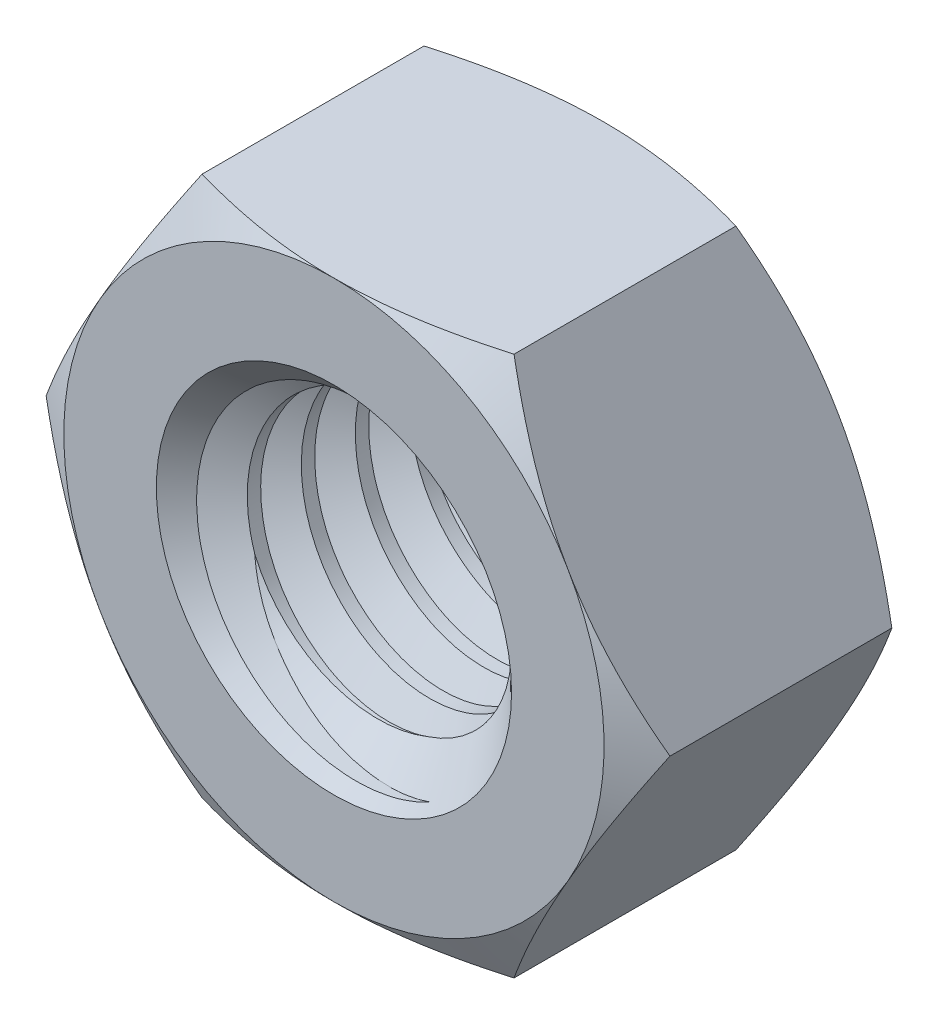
ISO-10303-21;
HEADER;
FILE_DESCRIPTION(('STEP AP214'),'2;1');
FILE_NAME('part.step','',(''),(''),'','','');
FILE_SCHEMA(('AUTOMOTIVE_DESIGN { 1 0 10303 214 1 1 1 1 }'));
ENDSEC;
DATA;
#1=APPLICATION_CONTEXT('core data for automotive mechanical design processes');
#2=APPLICATION_PROTOCOL_DEFINITION('international standard','automotive_design',2000,#1);
#3=PRODUCT_CONTEXT('',#1,'mechanical');
#4=PRODUCT('Part','Part','',(#3));
#5=PRODUCT_RELATED_PRODUCT_CATEGORY('part','',(#4));
#6=PRODUCT_DEFINITION_FORMATION('','',#4);
#7=PRODUCT_DEFINITION_CONTEXT('part definition',#1,'design');
#8=PRODUCT_DEFINITION('design','',#6,#7);
#9=PRODUCT_DEFINITION_SHAPE('','',#8);
#10=(LENGTH_UNIT() NAMED_UNIT(*) SI_UNIT(.MILLI.,.METRE.));
#11=(NAMED_UNIT(*) PLANE_ANGLE_UNIT() SI_UNIT($,.RADIAN.));
#12=(NAMED_UNIT(*) SI_UNIT($,.STERADIAN.) SOLID_ANGLE_UNIT());
#13=UNCERTAINTY_MEASURE_WITH_UNIT(LENGTH_MEASURE(1.E-05),#10,'distance_accuracy_value','');
#14=(GEOMETRIC_REPRESENTATION_CONTEXT(3) GLOBAL_UNCERTAINTY_ASSIGNED_CONTEXT((#13)) GLOBAL_UNIT_ASSIGNED_CONTEXT((#10,
#11,#12)) REPRESENTATION_CONTEXT('',''));
#15=CARTESIAN_POINT('',(0.,0.,0.));
#16=DIRECTION('',(0.,0.,1.));
#17=DIRECTION('',(1.,0.,0.));
#18=AXIS2_PLACEMENT_3D('',#15,#16,#17);
#19=CARTESIAN_POINT('',(0.,0.,0.));
#20=DIRECTION('',(0.,0.,1.));
#21=DIRECTION('',(1.,0.,0.));
#22=AXIS2_PLACEMENT_3D('',#19,#20,#21);
#23=CYLINDRICAL_SURFACE('',#22,1.98);
#24=CARTESIAN_POINT('',(1.97990623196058,0.0192694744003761,-0.29965735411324));
#25=CARTESIAN_POINT('',(1.97192455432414,0.839373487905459,-0.24965735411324));
#26=CARTESIAN_POINT('',(1.38637954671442,1.41363069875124,-0.19965735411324));
#27=CARTESIAN_POINT('',(0.800834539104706,1.98788790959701,-0.14965735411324));
#28=CARTESIAN_POINT('',(-0.019269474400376,1.97990623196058,-0.0996573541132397));
#29=CARTESIAN_POINT('',(-0.839373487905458,1.97192455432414,-0.0496573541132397));
#30=CARTESIAN_POINT('',(-1.41363069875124,1.38637954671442,0.000342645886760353));
#31=CARTESIAN_POINT('',(-1.98788790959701,0.800834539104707,0.0503426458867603));
#32=CARTESIAN_POINT('',(-1.97990623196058,-0.0192694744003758,0.10034264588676));
#33=CARTESIAN_POINT('',(-1.97192455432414,-0.839373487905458,0.15034264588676));
#34=CARTESIAN_POINT('',(-1.38637954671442,-1.41363069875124,0.20034264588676));
#35=CARTESIAN_POINT('',(-0.800834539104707,-1.98788790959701,0.25034264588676));
#36=CARTESIAN_POINT('',(0.0192694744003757,-1.97990623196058,0.30034264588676));
#37=CARTESIAN_POINT('',(0.839373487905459,-1.97192455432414,0.35034264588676));
#38=CARTESIAN_POINT('',(1.41363069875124,-1.38637954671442,0.40034264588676));
#39=CARTESIAN_POINT('',(1.98788790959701,-0.800834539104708,0.45034264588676));
#40=CARTESIAN_POINT('',(1.97990623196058,0.0192694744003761,0.50034264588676));
#41=CARTESIAN_POINT('',(1.97192455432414,0.839373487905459,0.55034264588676));
#42=CARTESIAN_POINT('',(1.38637954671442,1.41363069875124,0.60034264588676));
#43=CARTESIAN_POINT('',(0.800834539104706,1.98788790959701,0.65034264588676));
#44=CARTESIAN_POINT('',(-0.019269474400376,1.97990623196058,0.70034264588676));
#45=CARTESIAN_POINT('',(-0.839373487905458,1.97192455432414,0.75034264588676));
#46=CARTESIAN_POINT('',(-1.41363069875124,1.38637954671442,0.80034264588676));
#47=CARTESIAN_POINT('',(-1.98788790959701,0.800834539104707,0.85034264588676));
#48=CARTESIAN_POINT('',(-1.97990623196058,-0.0192694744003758,0.90034264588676));
#49=CARTESIAN_POINT('',(-1.97192455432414,-0.839373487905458,0.95034264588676));
#50=CARTESIAN_POINT('',(-1.38637954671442,-1.41363069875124,1.00034264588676));
#51=CARTESIAN_POINT('',(-0.800834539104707,-1.98788790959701,1.05034264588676));
#52=CARTESIAN_POINT('',(0.0192694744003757,-1.97990623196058,1.10034264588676));
#53=CARTESIAN_POINT('',(0.839373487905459,-1.97192455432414,1.15034264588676));
#54=CARTESIAN_POINT('',(1.41363069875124,-1.38637954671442,1.20034264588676));
#55=CARTESIAN_POINT('',(1.98788790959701,-0.800834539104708,1.25034264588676));
#56=CARTESIAN_POINT('',(1.97990623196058,0.0192694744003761,1.30034264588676));
#57=CARTESIAN_POINT('',(1.97192455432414,0.839373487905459,1.35034264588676));
#58=CARTESIAN_POINT('',(1.38637954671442,1.41363069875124,1.40034264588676));
#59=CARTESIAN_POINT('',(0.800834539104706,1.98788790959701,1.45034264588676));
#60=CARTESIAN_POINT('',(-0.019269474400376,1.97990623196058,1.50034264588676));
#61=CARTESIAN_POINT('',(-0.839373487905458,1.97192455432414,1.55034264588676));
#62=CARTESIAN_POINT('',(-1.41363069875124,1.38637954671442,1.60034264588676));
#63=CARTESIAN_POINT('',(-1.98788790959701,0.800834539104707,1.65034264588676));
#64=CARTESIAN_POINT('',(-1.97990623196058,-0.0192694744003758,1.70034264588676));
#65=CARTESIAN_POINT('',(-1.97192455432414,-0.839373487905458,1.75034264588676));
#66=CARTESIAN_POINT('',(-1.38637954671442,-1.41363069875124,1.80034264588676));
#67=CARTESIAN_POINT('',(-0.800834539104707,-1.98788790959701,1.85034264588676));
#68=CARTESIAN_POINT('',(0.0192694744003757,-1.97990623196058,1.90034264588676));
#69=CARTESIAN_POINT('',(0.839373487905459,-1.97192455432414,1.95034264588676));
#70=CARTESIAN_POINT('',(1.41363069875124,-1.38637954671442,2.00034264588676));
#71=CARTESIAN_POINT('',(1.98788790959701,-0.800834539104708,2.05034264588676));
#72=CARTESIAN_POINT('',(1.97990623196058,0.0192694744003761,2.10034264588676));
#73=CARTESIAN_POINT('',(1.97192455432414,0.839373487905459,2.15034264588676));
#74=CARTESIAN_POINT('',(1.38637954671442,1.41363069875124,2.20034264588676));
#75=CARTESIAN_POINT('',(0.800834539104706,1.98788790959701,2.25034264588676));
#76=CARTESIAN_POINT('',(-0.019269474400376,1.97990623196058,2.30034264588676));
#77=CARTESIAN_POINT('',(-0.839373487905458,1.97192455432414,2.35034264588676));
#78=CARTESIAN_POINT('',(-1.41363069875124,1.38637954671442,2.40034264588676));
#79=CARTESIAN_POINT('',(-1.98788790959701,0.800834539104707,2.45034264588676));
#80=CARTESIAN_POINT('',(-1.97990623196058,-0.0192694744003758,2.50034264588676));
#81=CARTESIAN_POINT('',(-1.97192455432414,-0.839373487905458,2.55034264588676));
#82=CARTESIAN_POINT('',(-1.38637954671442,-1.41363069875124,2.60034264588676));
#83=CARTESIAN_POINT('',(-0.800834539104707,-1.98788790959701,2.65034264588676));
#84=CARTESIAN_POINT('',(0.0192694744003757,-1.97990623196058,2.70034264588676));
#85=CARTESIAN_POINT('',(0.839373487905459,-1.97192455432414,2.75034264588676));
#86=CARTESIAN_POINT('',(1.41363069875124,-1.38637954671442,2.80034264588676));
#87=CARTESIAN_POINT('',(1.98788790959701,-0.800834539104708,2.85034264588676));
#88=CARTESIAN_POINT('',(1.97990623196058,0.0192694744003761,2.90034264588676));
#89=CARTESIAN_POINT('',(1.97192455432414,0.839373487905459,2.95034264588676));
#90=CARTESIAN_POINT('',(1.38637954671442,1.41363069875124,3.00034264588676));
#91=CARTESIAN_POINT('',(0.800834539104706,1.98788790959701,3.05034264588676));
#92=CARTESIAN_POINT('',(-0.019269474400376,1.97990623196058,3.10034264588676));
#93=CARTESIAN_POINT('',(-0.839373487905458,1.97192455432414,3.15034264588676));
#94=CARTESIAN_POINT('',(-1.41363069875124,1.38637954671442,3.20034264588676));
#95=CARTESIAN_POINT('',(-1.98788790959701,0.800834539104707,3.25034264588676));
#96=CARTESIAN_POINT('',(-1.97990623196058,-0.0192694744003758,3.30034264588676));
#97=CARTESIAN_POINT('',(-1.97192455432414,-0.839373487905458,3.35034264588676));
#98=CARTESIAN_POINT('',(-1.38637954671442,-1.41363069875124,3.40034264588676));
#99=CARTESIAN_POINT('',(-0.800834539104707,-1.98788790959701,3.45034264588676));
#100=CARTESIAN_POINT('',(0.0192694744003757,-1.97990623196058,3.50034264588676));
#101=CARTESIAN_POINT('',(0.839373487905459,-1.97192455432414,3.55034264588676));
#102=CARTESIAN_POINT('',(1.41363069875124,-1.38637954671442,3.60034264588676));
#103=CARTESIAN_POINT('',(1.98788790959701,-0.800834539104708,3.65034264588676));
#104=CARTESIAN_POINT('',(1.97990623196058,0.0192694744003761,3.70034264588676));
#105=CARTESIAN_POINT('',(1.97192455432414,0.839373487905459,3.75034264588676));
#106=CARTESIAN_POINT('',(1.38637954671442,1.41363069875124,3.80034264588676));
#107=CARTESIAN_POINT('',(0.800834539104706,1.98788790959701,3.85034264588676));
#108=CARTESIAN_POINT('',(-0.019269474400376,1.97990623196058,3.90034264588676));
#109=CARTESIAN_POINT('',(-0.839373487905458,1.97192455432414,3.95034264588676));
#110=CARTESIAN_POINT('',(-1.41363069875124,1.38637954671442,4.00034264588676));
#111=CARTESIAN_POINT('',(-1.98788790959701,0.800834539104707,4.05034264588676));
#112=CARTESIAN_POINT('',(-1.97990623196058,-0.0192694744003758,4.10034264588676));
#113=CARTESIAN_POINT('',(-1.97192455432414,-0.839373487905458,4.15034264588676));
#114=CARTESIAN_POINT('',(-1.38637954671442,-1.41363069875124,4.20034264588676));
#115=CARTESIAN_POINT('',(-0.800834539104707,-1.98788790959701,4.25034264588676));
#116=CARTESIAN_POINT('',(0.0192694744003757,-1.97990623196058,4.30034264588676));
#117=CARTESIAN_POINT('',(0.839373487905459,-1.97192455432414,4.35034264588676));
#118=CARTESIAN_POINT('',(1.41363069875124,-1.38637954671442,4.40034264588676));
#119=CARTESIAN_POINT('',(1.98788790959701,-0.800834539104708,4.45034264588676));
#120=CARTESIAN_POINT('',(1.97990623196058,0.0192694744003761,4.50034264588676));
#121=CARTESIAN_POINT('',(1.97192455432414,0.839373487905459,4.55034264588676));
#122=CARTESIAN_POINT('',(1.38637954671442,1.41363069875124,4.60034264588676));
#123=CARTESIAN_POINT('',(0.800834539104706,1.98788790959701,4.65034264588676));
#124=CARTESIAN_POINT('',(-0.019269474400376,1.97990623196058,4.70034264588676));
#125=(BOUNDED_CURVE() B_SPLINE_CURVE(2,(#24,#25,#26,#27,#28,#29,#30,#31,#32,#33,#34,#35,#36,#37,
#38,#39,#40,#41,#42,#43,#44,#45,#46,#47,#48,#49,#50,#51,#52,#53,#54,#55,#56,#57,#58,#59,#60,#61,
#62,#63,#64,#65,#66,#67,#68,#69,#70,#71,#72,#73,#74,#75,#76,#77,#78,#79,#80,#81,#82,#83,#84,#85,
#86,#87,#88,#89,#90,#91,#92,#93,#94,#95,#96,#97,#98,#99,#100,#101,#102,#103,#104,#105,#106,#107,
#108,#109,#110,#111,#112,#113,#114,#115,#116,#117,#118,#119,#120,#121,#122,#123,#124),
.UNSPECIFIED.,.F.,.F.) B_SPLINE_CURVE_WITH_KNOTS((3,2,2,2,2,2,2,2,2,2,2,2,2,2,2,2,2,2,2,2,2,2,2,
2,2,2,2,2,2,2,2,2,2,2,2,2,2,2,2,2,2,2,2,2,2,2,2,2,2,2,3),(0.,0.0178571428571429,
0.0357142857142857,0.0535714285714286,0.0714285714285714,0.0892857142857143,0.107142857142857,
0.125,0.142857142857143,0.160714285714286,0.178571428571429,0.196428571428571,0.214285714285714,
0.232142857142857,0.25,0.267857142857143,0.285714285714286,0.303571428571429,0.321428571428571,
0.339285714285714,0.357142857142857,0.375,0.392857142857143,0.410714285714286,0.428571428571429,
0.446428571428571,0.464285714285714,0.482142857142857,0.5,0.517857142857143,0.535714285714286,
0.553571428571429,0.571428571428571,0.589285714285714,0.607142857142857,0.625,0.642857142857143,
0.660714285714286,0.678571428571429,0.696428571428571,0.714285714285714,0.732142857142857,0.75,
0.767857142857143,0.785714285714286,0.803571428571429,0.821428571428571,0.839285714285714,
0.857142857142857,0.875,0.892857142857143),
.UNSPECIFIED.) CURVE() GEOMETRIC_REPRESENTATION_ITEM() RATIONAL_B_SPLINE_CURVE((1.,
0.923879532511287,1.,0.923879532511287,1.,0.923879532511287,1.,0.923879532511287,1.,
0.923879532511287,1.,0.923879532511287,1.,0.923879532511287,1.,0.923879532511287,1.,
0.923879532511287,1.,0.923879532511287,1.,0.923879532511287,1.,0.923879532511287,1.,
0.923879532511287,1.,0.923879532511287,1.,0.923879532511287,1.,0.923879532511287,1.,
0.923879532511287,1.,0.923879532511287,1.,0.923879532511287,1.,0.923879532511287,1.,
0.923879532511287,1.,0.923879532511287,1.,0.923879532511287,1.,0.923879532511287,1.,
0.923879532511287,1.,0.923879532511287,1.,0.923879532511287,1.,0.923879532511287,1.,
0.923879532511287,1.,0.923879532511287,1.,0.923879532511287,1.,0.923879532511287,1.,
0.923879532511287,1.,0.923879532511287,1.,0.923879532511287,1.,0.923879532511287,1.,
0.923879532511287,1.,0.923879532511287,1.,0.923879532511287,1.,0.923879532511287,1.,
0.923879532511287,1.,0.923879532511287,1.,0.923879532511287,1.,0.923879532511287,1.,
0.923879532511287,1.,0.923879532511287,1.,0.923879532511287,1.,0.923879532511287,1.,
0.923879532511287,1.,0.923879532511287,1.)) REPRESENTATION_ITEM(''));
#126=CARTESIAN_POINT('',(-1.823848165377,-0.770699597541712,3.35));
#127=VERTEX_POINT('',#126);
#128=CARTESIAN_POINT('',(0.74468849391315,1.83462231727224,0.650000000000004));
#129=VERTEX_POINT('',#128);
#130=EDGE_CURVE('E157',#127,#129,#125,.F.);
#131=ORIENTED_EDGE('',*,*,#130,.F.);
#132=CARTESIAN_POINT('',(0.,0.,3.35));
#133=DIRECTION('',(0.,0.,1.));
#134=DIRECTION('',(1.,0.,0.));
#135=AXIS2_PLACEMENT_3D('',#132,#133,#134);
#136=CIRCLE('',#135,1.98);
#137=CARTESIAN_POINT('',(0.744688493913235,-1.83462231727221,3.35));
#138=VERTEX_POINT('',#137);
#139=EDGE_CURVE('E208',#127,#138,#136,.T.);
#140=ORIENTED_EDGE('',*,*,#139,.T.);
#141=CARTESIAN_POINT('',(1.97990623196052,-0.0192694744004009,0.299657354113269));
#142=CARTESIAN_POINT('',(1.98788790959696,0.800834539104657,0.349657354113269));
#143=CARTESIAN_POINT('',(1.41363069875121,1.38637954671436,0.399657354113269));
#144=CARTESIAN_POINT('',(0.839373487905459,1.97192455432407,0.449657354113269));
#145=CARTESIAN_POINT('',(0.019269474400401,1.97990623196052,0.499657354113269));
#146=CARTESIAN_POINT('',(-0.800834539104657,1.98788790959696,0.549657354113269));
#147=CARTESIAN_POINT('',(-1.38637954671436,1.41363069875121,0.599657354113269));
#148=CARTESIAN_POINT('',(-1.97192455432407,0.839373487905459,0.649657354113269));
#149=CARTESIAN_POINT('',(-1.97990623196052,0.0192694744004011,0.699657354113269));
#150=CARTESIAN_POINT('',(-1.98788790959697,-0.800834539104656,0.749657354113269));
#151=CARTESIAN_POINT('',(-1.41363069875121,-1.38637954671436,0.799657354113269));
#152=CARTESIAN_POINT('',(-0.839373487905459,-1.97192455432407,0.849657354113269));
#153=CARTESIAN_POINT('',(-0.0192694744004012,-1.97990623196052,0.899657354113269));
#154=CARTESIAN_POINT('',(0.800834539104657,-1.98788790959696,0.949657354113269));
#155=CARTESIAN_POINT('',(1.38637954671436,-1.41363069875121,0.999657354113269));
#156=CARTESIAN_POINT('',(1.97192455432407,-0.83937348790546,1.04965735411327));
#157=CARTESIAN_POINT('',(1.97990623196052,-0.0192694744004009,1.09965735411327));
#158=CARTESIAN_POINT('',(1.98788790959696,0.800834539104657,1.14965735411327));
#159=CARTESIAN_POINT('',(1.41363069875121,1.38637954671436,1.19965735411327));
#160=CARTESIAN_POINT('',(0.839373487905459,1.97192455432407,1.24965735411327));
#161=CARTESIAN_POINT('',(0.019269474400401,1.97990623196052,1.29965735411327));
#162=CARTESIAN_POINT('',(-0.800834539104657,1.98788790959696,1.34965735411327));
#163=CARTESIAN_POINT('',(-1.38637954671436,1.41363069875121,1.39965735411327));
#164=CARTESIAN_POINT('',(-1.97192455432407,0.839373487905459,1.44965735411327));
#165=CARTESIAN_POINT('',(-1.97990623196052,0.0192694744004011,1.49965735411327));
#166=CARTESIAN_POINT('',(-1.98788790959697,-0.800834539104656,1.54965735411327));
#167=CARTESIAN_POINT('',(-1.41363069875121,-1.38637954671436,1.59965735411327));
#168=CARTESIAN_POINT('',(-0.839373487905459,-1.97192455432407,1.64965735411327));
#169=CARTESIAN_POINT('',(-0.0192694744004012,-1.97990623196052,1.69965735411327));
#170=CARTESIAN_POINT('',(0.800834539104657,-1.98788790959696,1.74965735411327));
#171=CARTESIAN_POINT('',(1.38637954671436,-1.41363069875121,1.79965735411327));
#172=CARTESIAN_POINT('',(1.97192455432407,-0.83937348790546,1.84965735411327));
#173=CARTESIAN_POINT('',(1.97990623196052,-0.0192694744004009,1.89965735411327));
#174=CARTESIAN_POINT('',(1.98788790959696,0.800834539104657,1.94965735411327));
#175=CARTESIAN_POINT('',(1.41363069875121,1.38637954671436,1.99965735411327));
#176=CARTESIAN_POINT('',(0.839373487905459,1.97192455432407,2.04965735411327));
#177=CARTESIAN_POINT('',(0.019269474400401,1.97990623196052,2.09965735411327));
#178=CARTESIAN_POINT('',(-0.800834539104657,1.98788790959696,2.14965735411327));
#179=CARTESIAN_POINT('',(-1.38637954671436,1.41363069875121,2.19965735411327));
#180=CARTESIAN_POINT('',(-1.97192455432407,0.839373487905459,2.24965735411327));
#181=CARTESIAN_POINT('',(-1.97990623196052,0.0192694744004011,2.29965735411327));
#182=CARTESIAN_POINT('',(-1.98788790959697,-0.800834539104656,2.34965735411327));
#183=CARTESIAN_POINT('',(-1.41363069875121,-1.38637954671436,2.39965735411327));
#184=CARTESIAN_POINT('',(-0.839373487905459,-1.97192455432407,2.44965735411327));
#185=CARTESIAN_POINT('',(-0.0192694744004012,-1.97990623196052,2.49965735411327));
#186=CARTESIAN_POINT('',(0.800834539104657,-1.98788790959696,2.54965735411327));
#187=CARTESIAN_POINT('',(1.38637954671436,-1.41363069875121,2.59965735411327));
#188=CARTESIAN_POINT('',(1.97192455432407,-0.83937348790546,2.64965735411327));
#189=CARTESIAN_POINT('',(1.97990623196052,-0.0192694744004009,2.69965735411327));
#190=CARTESIAN_POINT('',(1.98788790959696,0.800834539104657,2.74965735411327));
#191=CARTESIAN_POINT('',(1.41363069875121,1.38637954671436,2.79965735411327));
#192=CARTESIAN_POINT('',(0.839373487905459,1.97192455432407,2.84965735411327));
#193=CARTESIAN_POINT('',(0.019269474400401,1.97990623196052,2.89965735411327));
#194=CARTESIAN_POINT('',(-0.800834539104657,1.98788790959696,2.94965735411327));
#195=CARTESIAN_POINT('',(-1.38637954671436,1.41363069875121,2.99965735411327));
#196=CARTESIAN_POINT('',(-1.97192455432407,0.839373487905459,3.04965735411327));
#197=CARTESIAN_POINT('',(-1.97990623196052,0.0192694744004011,3.09965735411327));
#198=CARTESIAN_POINT('',(-1.98788790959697,-0.800834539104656,3.14965735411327));
#199=CARTESIAN_POINT('',(-1.41363069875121,-1.38637954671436,3.19965735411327));
#200=CARTESIAN_POINT('',(-0.839373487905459,-1.97192455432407,3.24965735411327));
#201=CARTESIAN_POINT('',(-0.0192694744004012,-1.97990623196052,3.29965735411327));
#202=CARTESIAN_POINT('',(0.800834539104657,-1.98788790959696,3.34965735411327));
#203=CARTESIAN_POINT('',(1.38637954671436,-1.41363069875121,3.39965735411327));
#204=CARTESIAN_POINT('',(1.97192455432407,-0.83937348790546,3.44965735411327));
#205=CARTESIAN_POINT('',(1.97990623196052,-0.0192694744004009,3.49965735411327));
#206=CARTESIAN_POINT('',(1.98788790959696,0.800834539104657,3.54965735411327));
#207=CARTESIAN_POINT('',(1.41363069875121,1.38637954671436,3.59965735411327));
#208=CARTESIAN_POINT('',(0.839373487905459,1.97192455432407,3.64965735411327));
#209=CARTESIAN_POINT('',(0.019269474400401,1.97990623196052,3.69965735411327));
#210=CARTESIAN_POINT('',(-0.800834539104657,1.98788790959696,3.74965735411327));
#211=CARTESIAN_POINT('',(-1.38637954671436,1.41363069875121,3.79965735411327));
#212=CARTESIAN_POINT('',(-1.97192455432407,0.839373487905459,3.84965735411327));
#213=CARTESIAN_POINT('',(-1.97990623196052,0.0192694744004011,3.89965735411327));
#214=CARTESIAN_POINT('',(-1.98788790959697,-0.800834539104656,3.94965735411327));
#215=CARTESIAN_POINT('',(-1.41363069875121,-1.38637954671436,3.99965735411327));
#216=CARTESIAN_POINT('',(-0.839373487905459,-1.97192455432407,4.04965735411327));
#217=CARTESIAN_POINT('',(-0.0192694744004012,-1.97990623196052,4.09965735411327));
#218=CARTESIAN_POINT('',(0.800834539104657,-1.98788790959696,4.14965735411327));
#219=CARTESIAN_POINT('',(1.38637954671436,-1.41363069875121,4.19965735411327));
#220=CARTESIAN_POINT('',(1.97192455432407,-0.83937348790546,4.24965735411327));
#221=CARTESIAN_POINT('',(1.97990623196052,-0.0192694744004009,4.29965735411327));
#222=CARTESIAN_POINT('',(1.98788790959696,0.800834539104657,4.34965735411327));
#223=CARTESIAN_POINT('',(1.41363069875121,1.38637954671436,4.39965735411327));
#224=CARTESIAN_POINT('',(0.839373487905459,1.97192455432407,4.44965735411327));
#225=CARTESIAN_POINT('',(0.019269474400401,1.97990623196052,4.49965735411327));
#226=CARTESIAN_POINT('',(-0.800834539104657,1.98788790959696,4.54965735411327));
#227=CARTESIAN_POINT('',(-1.38637954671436,1.41363069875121,4.59965735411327));
#228=CARTESIAN_POINT('',(-1.97192455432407,0.839373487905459,4.64965735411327));
#229=CARTESIAN_POINT('',(-1.97990623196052,0.0192694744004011,4.69965735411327));
#230=CARTESIAN_POINT('',(-1.98788790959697,-0.800834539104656,4.74965735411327));
#231=CARTESIAN_POINT('',(-1.41363069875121,-1.38637954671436,4.79965735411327));
#232=CARTESIAN_POINT('',(-0.839373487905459,-1.97192455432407,4.84965735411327));
#233=CARTESIAN_POINT('',(-0.0192694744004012,-1.97990623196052,4.89965735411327));
#234=CARTESIAN_POINT('',(0.800834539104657,-1.98788790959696,4.94965735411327));
#235=CARTESIAN_POINT('',(1.38637954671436,-1.41363069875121,4.99965735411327));
#236=CARTESIAN_POINT('',(1.97192455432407,-0.83937348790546,5.04965735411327));
#237=CARTESIAN_POINT('',(1.97990623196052,-0.0192694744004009,5.09965735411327));
#238=CARTESIAN_POINT('',(1.98788790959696,0.800834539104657,5.14965735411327));
#239=CARTESIAN_POINT('',(1.41363069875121,1.38637954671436,5.19965735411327));
#240=CARTESIAN_POINT('',(0.839373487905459,1.97192455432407,5.24965735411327));
#241=CARTESIAN_POINT('',(0.019269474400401,1.97990623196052,5.29965735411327));
#242=(BOUNDED_CURVE() B_SPLINE_CURVE(2,(#141,#142,#143,#144,#145,#146,#147,#148,#149,#150,#151,
#152,#153,#154,#155,#156,#157,#158,#159,#160,#161,#162,#163,#164,#165,#166,#167,#168,#169,#170,
#171,#172,#173,#174,#175,#176,#177,#178,#179,#180,#181,#182,#183,#184,#185,#186,#187,#188,#189,
#190,#191,#192,#193,#194,#195,#196,#197,#198,#199,#200,#201,#202,#203,#204,#205,#206,#207,#208,
#209,#210,#211,#212,#213,#214,#215,#216,#217,#218,#219,#220,#221,#222,#223,#224,#225,#226,#227,
#228,#229,#230,#231,#232,#233,#234,#235,#236,#237,#238,#239,#240,#241),.UNSPECIFIED.,.F.,
.F.) B_SPLINE_CURVE_WITH_KNOTS((3,2,2,2,2,2,2,2,2,2,2,2,2,2,2,2,2,2,2,2,2,2,2,2,2,2,2,2,2,2,2,2,
2,2,2,2,2,2,2,2,2,2,2,2,2,2,2,2,2,2,3),(0.,0.0178571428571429,0.0357142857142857,
0.0535714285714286,0.0714285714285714,0.0892857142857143,0.107142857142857,0.125,
0.142857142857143,0.160714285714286,0.178571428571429,0.196428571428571,0.214285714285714,
0.232142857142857,0.25,0.267857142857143,0.285714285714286,0.303571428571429,0.321428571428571,
0.339285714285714,0.357142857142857,0.375,0.392857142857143,0.410714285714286,0.428571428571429,
0.446428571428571,0.464285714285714,0.482142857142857,0.5,0.517857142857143,0.535714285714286,
0.553571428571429,0.571428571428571,0.589285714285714,0.607142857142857,0.625,0.642857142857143,
0.660714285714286,0.678571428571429,0.696428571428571,0.714285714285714,0.732142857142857,0.75,
0.767857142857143,0.785714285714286,0.803571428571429,0.821428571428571,0.839285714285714,
0.857142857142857,0.875,0.892857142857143),
.UNSPECIFIED.) CURVE() GEOMETRIC_REPRESENTATION_ITEM() RATIONAL_B_SPLINE_CURVE((1.,
0.923879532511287,1.,0.923879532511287,1.,0.923879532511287,1.,0.923879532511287,1.,
0.923879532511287,1.,0.923879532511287,1.,0.923879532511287,1.,0.923879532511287,1.,
0.923879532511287,1.,0.923879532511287,1.,0.923879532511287,1.,0.923879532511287,1.,
0.923879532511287,1.,0.923879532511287,1.,0.923879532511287,1.,0.923879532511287,1.,
0.923879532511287,1.,0.923879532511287,1.,0.923879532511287,1.,0.923879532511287,1.,
0.923879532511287,1.,0.923879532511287,1.,0.923879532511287,1.,0.923879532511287,1.,
0.923879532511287,1.,0.923879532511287,1.,0.923879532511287,1.,0.923879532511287,1.,
0.923879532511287,1.,0.923879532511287,1.,0.923879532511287,1.,0.923879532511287,1.,
0.923879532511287,1.,0.923879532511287,1.,0.923879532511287,1.,0.923879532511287,1.,
0.923879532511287,1.,0.923879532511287,1.,0.923879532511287,1.,0.923879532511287,1.,
0.923879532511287,1.,0.923879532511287,1.,0.923879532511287,1.,0.923879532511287,1.,
0.923879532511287,1.,0.923879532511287,1.,0.923879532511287,1.,0.923879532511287,1.,
0.923879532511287,1.,0.923879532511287,1.)) REPRESENTATION_ITEM(''));
#243=CARTESIAN_POINT('',(-1.82384816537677,0.770699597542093,0.650000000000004));
#244=VERTEX_POINT('',#243);
#245=EDGE_CURVE('E59',#244,#138,#242,.T.);
#246=ORIENTED_EDGE('',*,*,#245,.F.);
#247=CARTESIAN_POINT('',(0.,0.,0.650000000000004));
#248=DIRECTION('',(0.,0.,1.));
#249=DIRECTION('',(1.,0.,0.));
#250=AXIS2_PLACEMENT_3D('',#247,#248,#249);
#251=CIRCLE('',#250,1.98);
#252=EDGE_CURVE('E169',#244,#129,#251,.F.);
#253=ORIENTED_EDGE('',*,*,#252,.T.);
#254=EDGE_LOOP('',(#131,#140,#246,#253));
#255=FACE_BOUND('',#254,.T.);
#256=ADVANCED_FACE('F38',(#255),#23,.F.);
#257=CARTESIAN_POINT('',(2.3094010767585,-3.99999999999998,4.));
#258=DIRECTION('',(-0.866025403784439,0.499999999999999,0.));
#259=DIRECTION('',(-0.499999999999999,-0.866025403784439,0.));
#260=AXIS2_PLACEMENT_3D('',#257,#258,#259);
#261=PLANE('',#260);
#262=CARTESIAN_POINT('',(4.61891762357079,0.000199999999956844,0.357332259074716));
#263=CARTESIAN_POINT('',(4.51743148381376,-0.17557915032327,0.298717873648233));
#264=CARTESIAN_POINT('',(4.41506932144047,-0.352875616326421,0.245410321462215));
#265=CARTESIAN_POINT('',(4.20857250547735,-0.710538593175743,0.15236167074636));
#266=CARTESIAN_POINT('',(4.10443418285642,-0.890911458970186,0.112653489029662));
#267=CARTESIAN_POINT('',(3.89744813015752,-1.24942181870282,0.0508422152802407));
#268=CARTESIAN_POINT('',(3.79463224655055,-1.42750415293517,0.028327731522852));
#269=CARTESIAN_POINT('',(3.58851671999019,-1.78450671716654,0.00145062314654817));
#270=CARTESIAN_POINT('',(3.48521782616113,-1.96342564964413,-0.00293425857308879));
#271=CARTESIAN_POINT('',(3.29219970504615,-2.29774284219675,0.00619007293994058));
#272=CARTESIAN_POINT('',(3.20245157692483,-2.45319115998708,0.0174589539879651));
#273=CARTESIAN_POINT('',(3.02354002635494,-2.76307505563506,0.0531739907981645));
#274=CARTESIAN_POINT('',(2.9343772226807,-2.91750956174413,0.0776323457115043));
#275=CARTESIAN_POINT('',(2.75509682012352,-3.22803232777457,0.13877606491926));
#276=CARTESIAN_POINT('',(2.66500191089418,-3.38408128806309,0.175720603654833));
#277=CARTESIAN_POINT('',(2.486155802,-3.69385183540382,0.259570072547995));
#278=CARTESIAN_POINT('',(2.39740231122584,-3.84757739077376,0.306455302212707));
#279=CARTESIAN_POINT('',(2.30928560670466,-4.00019999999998,0.357332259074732));
#280=B_SPLINE_CURVE_WITH_KNOTS('',3,(#262,#263,#264,#265,#266,#267,#268,#269,#270,#271,#272,
#273,#274,#275,#276,#277,#278,#279),.UNSPECIFIED.,.F.,.F.,(4,2,2,2,2,2,2,2,4),(0.,
0.634047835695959,1.26961969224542,1.8894615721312,2.50854226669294,3.04757825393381,
3.58711366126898,4.13861653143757,4.68903648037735),.UNSPECIFIED.);
#281=CARTESIAN_POINT('',(4.61880215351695,0.,0.357265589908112));
#282=VERTEX_POINT('',#281);
#283=CARTESIAN_POINT('',(3.46410161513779,-2.00000000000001,0.));
#284=VERTEX_POINT('',#283);
#285=EDGE_CURVE('E447',#282,#284,#280,.T.);
#286=ORIENTED_EDGE('',*,*,#285,.F.);
#287=DIRECTION('',(0.,0.,-1.));
#288=VECTOR('',#287,1.);
#289=CARTESIAN_POINT('',(4.61880215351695,0.,4.));
#290=LINE('',#289,#288);
#291=CARTESIAN_POINT('',(4.61880215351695,0.,3.64273441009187));
#292=VERTEX_POINT('',#291);
#293=EDGE_CURVE('E224',#292,#282,#290,.T.);
#294=ORIENTED_EDGE('',*,*,#293,.F.);
#295=CARTESIAN_POINT('',(2.30928560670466,-4.00019999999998,3.64266774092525));
#296=CARTESIAN_POINT('',(2.4107717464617,-3.82442084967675,3.70128212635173));
#297=CARTESIAN_POINT('',(2.51313390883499,-3.6471243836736,3.75458967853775));
#298=CARTESIAN_POINT('',(2.71963072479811,-3.28946140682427,3.84763832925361));
#299=CARTESIAN_POINT('',(2.82376904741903,-3.10908854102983,3.88734651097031));
#300=CARTESIAN_POINT('',(3.03075510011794,-2.75057818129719,3.94915778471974));
#301=CARTESIAN_POINT('',(3.13357098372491,-2.57249584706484,3.97167226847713));
#302=CARTESIAN_POINT('',(3.33968651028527,-2.21549328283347,3.99854937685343));
#303=CARTESIAN_POINT('',(3.44298540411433,-2.03657435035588,4.00293425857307));
#304=CARTESIAN_POINT('',(3.6360035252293,-1.70225715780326,3.99380992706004));
#305=CARTESIAN_POINT('',(3.72575165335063,-1.54680884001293,3.98254104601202));
#306=CARTESIAN_POINT('',(3.90466320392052,-1.23692494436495,3.94682600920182));
#307=CARTESIAN_POINT('',(3.99382600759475,-1.08249043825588,3.92236765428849));
#308=CARTESIAN_POINT('',(4.17310641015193,-0.771967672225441,3.86122393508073));
#309=CARTESIAN_POINT('',(4.26320131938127,-0.615918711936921,3.82427939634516));
#310=CARTESIAN_POINT('',(4.44204742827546,-0.306148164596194,3.740429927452));
#311=CARTESIAN_POINT('',(4.53080091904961,-0.152422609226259,3.69354469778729));
#312=CARTESIAN_POINT('',(4.61891762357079,0.000199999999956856,3.64266774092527));
#313=B_SPLINE_CURVE_WITH_KNOTS('',3,(#295,#296,#297,#298,#299,#300,#301,#302,#303,#304,#305,
#306,#307,#308,#309,#310,#311,#312),.UNSPECIFIED.,.F.,.F.,(4,2,2,2,2,2,2,2,4),(0.,
0.634047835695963,1.26961969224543,1.88946157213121,2.50854226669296,3.04757825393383,
3.58711366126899,4.13861653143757,4.68903648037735),.UNSPECIFIED.);
#314=CARTESIAN_POINT('',(3.46410161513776,-2.,4.));
#315=VERTEX_POINT('',#314);
#316=EDGE_CURVE('E243',#315,#292,#313,.T.);
#317=ORIENTED_EDGE('',*,*,#316,.F.);
#318=CARTESIAN_POINT('',(2.3094010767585,-3.99999999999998,3.64273441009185));
#319=VERTEX_POINT('',#318);
#320=EDGE_CURVE('E242',#319,#315,#313,.T.);
#321=ORIENTED_EDGE('',*,*,#320,.F.);
#322=DIRECTION('',(0.,0.,-1.));
#323=VECTOR('',#322,1.);
#324=CARTESIAN_POINT('',(2.3094010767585,-3.99999999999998,4.));
#325=LINE('',#324,#323);
#326=CARTESIAN_POINT('',(2.3094010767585,-3.99999999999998,0.357265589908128));
#327=VERTEX_POINT('',#326);
#328=EDGE_CURVE('E239',#319,#327,#325,.T.);
#329=ORIENTED_EDGE('',*,*,#328,.T.);
#330=EDGE_CURVE('E381',#284,#327,#280,.T.);
#331=ORIENTED_EDGE('',*,*,#330,.F.);
#332=EDGE_LOOP('',(#286,#294,#317,#321,#329,#331));
#333=FACE_BOUND('',#332,.T.);
#334=ADVANCED_FACE('F258',(#333),#261,.F.);
#335=CARTESIAN_POINT('',(4.61880215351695,0.,4.));
#336=DIRECTION('',(-0.86602540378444,-0.499999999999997,0.));
#337=DIRECTION('',(0.499999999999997,-0.86602540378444,0.));
#338=AXIS2_PLACEMENT_3D('',#335,#336,#337);
#339=PLANE('',#338);
#340=CARTESIAN_POINT('',(2.30928560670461,4.0002,0.35733225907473));
#341=CARTESIAN_POINT('',(2.41077174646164,3.82442084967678,0.298717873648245));
#342=CARTESIAN_POINT('',(2.51313390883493,3.64712438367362,0.245410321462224));
#343=CARTESIAN_POINT('',(2.71963072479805,3.2894614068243,0.152361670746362));
#344=CARTESIAN_POINT('',(2.82376904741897,3.10908854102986,0.112653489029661));
#345=CARTESIAN_POINT('',(3.03075510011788,2.75057818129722,0.0508422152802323));
#346=CARTESIAN_POINT('',(3.13357098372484,2.57249584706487,0.0283277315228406));
#347=CARTESIAN_POINT('',(3.33968651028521,2.2154932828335,0.00145062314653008));
#348=CARTESIAN_POINT('',(3.44298540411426,2.03657435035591,-0.00293425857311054));
#349=CARTESIAN_POINT('',(3.63600352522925,1.70225715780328,0.0061900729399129));
#350=CARTESIAN_POINT('',(3.72575165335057,1.54680884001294,0.0174589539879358));
#351=CARTESIAN_POINT('',(3.90466320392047,1.23692494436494,0.0531739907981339));
#352=CARTESIAN_POINT('',(3.99382600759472,1.08249043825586,0.0776323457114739));
#353=CARTESIAN_POINT('',(4.17310641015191,0.771967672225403,0.138776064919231));
#354=CARTESIAN_POINT('',(4.26320131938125,0.615918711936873,0.175720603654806));
#355=CARTESIAN_POINT('',(4.44204742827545,0.306148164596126,0.259570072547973));
#356=CARTESIAN_POINT('',(4.53080091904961,0.152422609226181,0.306455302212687));
#357=CARTESIAN_POINT('',(4.61891762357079,-0.000200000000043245,0.357332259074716));
#358=B_SPLINE_CURVE_WITH_KNOTS('',3,(#340,#341,#342,#343,#344,#345,#346,#347,#348,#349,#350,
#351,#352,#353,#354,#355,#356,#357),.UNSPECIFIED.,.F.,.F.,(4,2,2,2,2,2,2,2,4),(0.,
0.634047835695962,1.26961969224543,1.88946157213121,2.50854226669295,3.04757825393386,
3.58711366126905,4.13861653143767,4.68903648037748),.UNSPECIFIED.);
#359=CARTESIAN_POINT('',(2.30940107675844,4.,0.357265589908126));
#360=VERTEX_POINT('',#359);
#361=CARTESIAN_POINT('',(3.46410161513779,2.00000000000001,0.));
#362=VERTEX_POINT('',#361);
#363=EDGE_CURVE('E454',#360,#362,#358,.T.);
#364=ORIENTED_EDGE('',*,*,#363,.F.);
#365=DIRECTION('',(0.,0.,-1.));
#366=VECTOR('',#365,1.);
#367=CARTESIAN_POINT('',(2.30940107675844,4.,4.));
#368=LINE('',#367,#366);
#369=CARTESIAN_POINT('',(2.30940107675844,4.,3.64273441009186));
#370=VERTEX_POINT('',#369);
#371=EDGE_CURVE('E227',#370,#360,#368,.T.);
#372=ORIENTED_EDGE('',*,*,#371,.F.);
#373=CARTESIAN_POINT('',(4.61891762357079,-0.000200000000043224,3.64266774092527));
#374=CARTESIAN_POINT('',(4.51743148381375,0.175579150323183,3.70128212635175));
#375=CARTESIAN_POINT('',(4.41506932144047,0.352875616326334,3.75458967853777));
#376=CARTESIAN_POINT('',(4.20857250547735,0.710538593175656,3.84763832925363));
#377=CARTESIAN_POINT('',(4.10443418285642,0.890911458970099,3.88734651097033));
#378=CARTESIAN_POINT('',(3.89744813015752,1.24942181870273,3.94915778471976));
#379=CARTESIAN_POINT('',(3.79463224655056,1.42750415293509,3.97167226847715));
#380=CARTESIAN_POINT('',(3.58851671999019,1.78450671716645,3.99854937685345));
#381=CARTESIAN_POINT('',(3.48521782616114,1.96342564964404,4.00293425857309));
#382=CARTESIAN_POINT('',(3.29219970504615,2.29774284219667,3.99380992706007));
#383=CARTESIAN_POINT('',(3.20245157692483,2.45319115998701,3.98254104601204));
#384=CARTESIAN_POINT('',(3.02354002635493,2.76307505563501,3.94682600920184));
#385=CARTESIAN_POINT('',(2.93437722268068,2.91750956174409,3.9223676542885));
#386=CARTESIAN_POINT('',(2.75509682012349,3.22803232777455,3.86122393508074));
#387=CARTESIAN_POINT('',(2.66500191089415,3.38408128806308,3.82427939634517));
#388=CARTESIAN_POINT('',(2.48615580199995,3.69385183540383,3.740429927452));
#389=CARTESIAN_POINT('',(2.39740231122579,3.84757739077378,3.69354469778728));
#390=CARTESIAN_POINT('',(2.30928560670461,4.0002,3.64266774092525));
#391=B_SPLINE_CURVE_WITH_KNOTS('',3,(#373,#374,#375,#376,#377,#378,#379,#380,#381,#382,#383,
#384,#385,#386,#387,#388,#389,#390),.UNSPECIFIED.,.F.,.F.,(4,2,2,2,2,2,2,2,4),(0.,
0.634047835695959,1.26961969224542,1.8894615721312,2.50854226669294,3.04757825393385,
3.58711366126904,4.13861653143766,4.68903648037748),.UNSPECIFIED.);
#392=CARTESIAN_POINT('',(3.46410161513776,1.99999999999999,4.));
#393=VERTEX_POINT('',#392);
#394=EDGE_CURVE('E251',#393,#370,#391,.T.);
#395=ORIENTED_EDGE('',*,*,#394,.F.);
#396=EDGE_CURVE('E250',#292,#393,#391,.T.);
#397=ORIENTED_EDGE('',*,*,#396,.F.);
#398=ORIENTED_EDGE('',*,*,#293,.T.);
#399=EDGE_CURVE('E324',#362,#282,#358,.T.);
#400=ORIENTED_EDGE('',*,*,#399,.F.);
#401=EDGE_LOOP('',(#364,#372,#395,#397,#398,#400));
#402=FACE_BOUND('',#401,.T.);
#403=ADVANCED_FACE('F311',(#402),#339,.F.);
#404=CARTESIAN_POINT('',(2.30940107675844,4.,4.));
#405=DIRECTION('',(0.,-1.,0.));
#406=DIRECTION('',(0.,0.,-1.));
#407=AXIS2_PLACEMENT_3D('',#404,#405,#406);
#408=PLANE('',#407);
#409=CARTESIAN_POINT('',(-6.33390634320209,4.,2.015656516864));
#410=CARTESIAN_POINT('',(-6.15804295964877,4.,1.92983010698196));
#411=CARTESIAN_POINT('',(-5.98178958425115,4.,1.84478978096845));
#412=CARTESIAN_POINT('',(-5.62829589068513,4.,1.67672101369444));
#413=CARTESIAN_POINT('',(-5.45105543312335,4.,1.59369286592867));
#414=CARTESIAN_POINT('',(-5.09452869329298,4.,1.42969804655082));
#415=CARTESIAN_POINT('',(-4.91523659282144,4.,1.34874398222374));
#416=CARTESIAN_POINT('',(-4.55527108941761,4.,1.18997940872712));
#417=CARTESIAN_POINT('',(-4.37459774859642,4.,1.112168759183));
#418=CARTESIAN_POINT('',(-4.00531214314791,4.,0.957897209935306));
#419=CARTESIAN_POINT('',(-3.81664127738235,4.,0.881575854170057));
#420=CARTESIAN_POINT('',(-3.43714099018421,4.,0.73439964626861));
#421=CARTESIAN_POINT('',(-3.24631133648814,4.,0.663545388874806));
#422=CARTESIAN_POINT('',(-2.86250662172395,4.,0.529068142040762));
#423=CARTESIAN_POINT('',(-2.66953636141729,4.,0.465431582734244));
#424=CARTESIAN_POINT('',(-2.28083073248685,4.,0.347344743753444));
#425=CARTESIAN_POINT('',(-2.08509621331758,4.,0.292891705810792));
#426=CARTESIAN_POINT('',(-1.69184296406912,4.,0.195988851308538));
#427=CARTESIAN_POINT('',(-1.49434141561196,4.,0.153470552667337));
#428=CARTESIAN_POINT('',(-1.09675135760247,4.,0.0827508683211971));
#429=CARTESIAN_POINT('',(-0.89666314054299,4.,0.0545478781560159));
#430=CARTESIAN_POINT('',(-0.497563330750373,4.,0.0150704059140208));
#431=CARTESIAN_POINT('',(-0.298574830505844,4.,0.00356824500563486));
#432=CARTESIAN_POINT('',(0.0996728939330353,4.,-0.00214089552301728));
#433=CARTESIAN_POINT('',(0.298932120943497,4.,0.00365230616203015));
#434=CARTESIAN_POINT('',(0.633422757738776,4.,0.0274736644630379));
#435=CARTESIAN_POINT('',(0.768993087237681,4.,0.0410579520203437));
#436=CARTESIAN_POINT('',(1.03921951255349,4.,0.0754551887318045));
#437=CARTESIAN_POINT('',(1.17387549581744,4.,0.0962690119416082));
#438=CARTESIAN_POINT('',(1.57624520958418,4.,0.168468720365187));
#439=CARTESIAN_POINT('',(1.84223360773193,4.,0.22960252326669));
#440=CARTESIAN_POINT('',(2.24022146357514,4.,0.33662394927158));
#441=CARTESIAN_POINT('',(2.37425426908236,4.,0.375389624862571));
#442=CARTESIAN_POINT('',(2.64102060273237,4.,0.457198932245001));
#443=CARTESIAN_POINT('',(2.77375412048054,4.,0.500242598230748));
#444=CARTESIAN_POINT('',(3.03796085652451,4.,0.589896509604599));
#445=CARTESIAN_POINT('',(3.16943439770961,4.,0.636505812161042));
#446=CARTESIAN_POINT('',(3.4312741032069,4.,0.732717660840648));
#447=CARTESIAN_POINT('',(3.56164029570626,4.,0.782320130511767));
#448=CARTESIAN_POINT('',(3.92094150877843,4.,0.923000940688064));
#449=CARTESIAN_POINT('',(4.14883836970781,4.,1.01672862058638));
#450=CARTESIAN_POINT('',(4.60219688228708,4.,1.2099207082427));
#451=CARTESIAN_POINT('',(4.82765822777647,4.,1.30938582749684));
#452=CARTESIAN_POINT('',(5.2767240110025,4.,1.51265741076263));
#453=CARTESIAN_POINT('',(5.50032761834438,4.,1.61646570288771));
#454=CARTESIAN_POINT('',(5.94596780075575,4.,1.827355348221));
#455=CARTESIAN_POINT('',(6.16800444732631,4.,1.93443655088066));
#456=CARTESIAN_POINT('',(6.61121450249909,4.,2.15132785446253));
#457=CARTESIAN_POINT('',(6.83238575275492,4.,2.26114235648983));
#458=CARTESIAN_POINT('',(7.27371768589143,4.,2.48278575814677));
#459=CARTESIAN_POINT('',(7.49387835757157,4.,2.59461468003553));
#460=CARTESIAN_POINT('',(8.15302467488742,4.,2.93243743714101));
#461=CARTESIAN_POINT('',(8.5907845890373,4.,3.1608216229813));
#462=CARTESIAN_POINT('',(9.41591479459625,4.,3.59638573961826));
#463=CARTESIAN_POINT('',(9.80351807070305,4.,3.80312648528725));
#464=CARTESIAN_POINT('',(10.5774421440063,4.,4.21905680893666));
#465=CARTESIAN_POINT('',(10.9637628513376,4.,4.42824655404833));
#466=CARTESIAN_POINT('',(11.7340456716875,4.,4.84768065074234));
#467=CARTESIAN_POINT('',(12.1180112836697,4.,5.05791858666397));
#468=CARTESIAN_POINT('',(12.885143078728,4.,5.47977102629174));
#469=CARTESIAN_POINT('',(13.2683093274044,4.,5.6913854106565));
#470=CARTESIAN_POINT('',(13.65119727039,4.,5.90349907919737));
#471=B_SPLINE_CURVE_WITH_KNOTS('',3,(#409,#410,#411,#412,#413,#414,#415,#416,#417,#418,#419,
#420,#421,#422,#423,#424,#425,#426,#427,#428,#429,#430,#431,#432,#433,#434,#435,#436,#437,#438,
#439,#440,#441,#442,#443,#444,#445,#446,#447,#448,#449,#450,#451,#452,#453,#454,#455,#456,#457,
#458,#459,#460,#461,#462,#463,#464,#465,#466,#467,#468,#469,#470),.UNSPECIFIED.,.F.,.F.,(4,2,2,
2,2,2,2,2,2,2,2,2,2,2,2,2,2,2,2,2,2,2,2,2,2,2,2,2,2,2,4),(0.,0.587072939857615,1.17423100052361,
1.76437027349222,2.35448316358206,2.96498685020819,3.57555685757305,4.18495921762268,
4.79417821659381,5.39982649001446,6.00540686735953,6.60265136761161,7.19990212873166,
7.60845406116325,8.01705540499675,8.83463888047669,9.25317840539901,9.67172127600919,
10.090153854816,10.5085757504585,11.2477102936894,11.9869366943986,12.7264774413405,
13.465984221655,14.2067705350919,14.9475650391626,16.428786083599,17.7466552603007,
19.0646149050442,20.3778773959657,21.6910275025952),.UNSPECIFIED.);
#472=CARTESIAN_POINT('',(-2.30940107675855,4.,0.357265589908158));
#473=VERTEX_POINT('',#472);
#474=CARTESIAN_POINT('',(0.,4.00000000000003,0.));
#475=VERTEX_POINT('',#474);
#476=EDGE_CURVE('E67',#473,#475,#471,.T.);
#477=ORIENTED_EDGE('',*,*,#476,.F.);
#478=DIRECTION('',(0.,0.,-1.));
#479=VECTOR('',#478,1.);
#480=CARTESIAN_POINT('',(-2.30940107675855,4.,4.));
#481=LINE('',#480,#479);
#482=CARTESIAN_POINT('',(-2.30940107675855,4.,3.64273441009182));
#483=VERTEX_POINT('',#482);
#484=EDGE_CURVE('E230',#483,#473,#481,.T.);
#485=ORIENTED_EDGE('',*,*,#484,.F.);
#486=CARTESIAN_POINT('',(-6.33390634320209,4.,1.98434348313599));
#487=CARTESIAN_POINT('',(-6.15804295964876,4.,2.07016989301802));
#488=CARTESIAN_POINT('',(-5.98178958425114,4.,2.15521021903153));
#489=CARTESIAN_POINT('',(-5.62829589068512,4.,2.32327898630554));
#490=CARTESIAN_POINT('',(-5.45105543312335,4.,2.40630713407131));
#491=CARTESIAN_POINT('',(-5.09452869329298,4.,2.57030195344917));
#492=CARTESIAN_POINT('',(-4.91523659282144,4.,2.65125601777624));
#493=CARTESIAN_POINT('',(-4.55527108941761,4.,2.81002059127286));
#494=CARTESIAN_POINT('',(-4.37459774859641,4.,2.88783124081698));
#495=CARTESIAN_POINT('',(-4.00531214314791,4.,3.04210279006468));
#496=CARTESIAN_POINT('',(-3.81664127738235,4.,3.11842414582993));
#497=CARTESIAN_POINT('',(-3.43714099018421,4.,3.26560035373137));
#498=CARTESIAN_POINT('',(-3.24631133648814,4.,3.33645461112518));
#499=CARTESIAN_POINT('',(-2.86250662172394,4.,3.47093185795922));
#500=CARTESIAN_POINT('',(-2.66953636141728,4.,3.53456841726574));
#501=CARTESIAN_POINT('',(-2.28083073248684,4.,3.65265525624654));
#502=CARTESIAN_POINT('',(-2.08509621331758,4.,3.70710829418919));
#503=CARTESIAN_POINT('',(-1.69184296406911,4.,3.80401114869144));
#504=CARTESIAN_POINT('',(-1.49434141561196,4.,3.84652944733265));
#505=CARTESIAN_POINT('',(-1.09675135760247,4.,3.91724913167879));
#506=CARTESIAN_POINT('',(-0.896663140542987,4.,3.94545212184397));
#507=CARTESIAN_POINT('',(-0.49756333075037,4.,3.98492959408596));
#508=CARTESIAN_POINT('',(-0.298574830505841,4.,3.99643175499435));
#509=CARTESIAN_POINT('',(0.0996728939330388,4.,4.002140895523));
#510=CARTESIAN_POINT('',(0.2989321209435,4.,3.99634769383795));
#511=CARTESIAN_POINT('',(0.63342275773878,4.,3.97252633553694));
#512=CARTESIAN_POINT('',(0.768993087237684,4.,3.95894204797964));
#513=CARTESIAN_POINT('',(1.0392195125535,4.,3.92454481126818));
#514=CARTESIAN_POINT('',(1.17387549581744,4.,3.90373098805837));
#515=CARTESIAN_POINT('',(1.57624520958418,4.,3.83153127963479));
#516=CARTESIAN_POINT('',(1.84223360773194,4.,3.77039747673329));
#517=CARTESIAN_POINT('',(2.24022146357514,4.,3.6633760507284));
#518=CARTESIAN_POINT('',(2.37425426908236,4.,3.62461037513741));
#519=CARTESIAN_POINT('',(2.64102060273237,4.,3.54280106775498));
#520=CARTESIAN_POINT('',(2.77375412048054,4.,3.49975740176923));
#521=CARTESIAN_POINT('',(3.03796085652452,4.,3.41010349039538));
#522=CARTESIAN_POINT('',(3.16943439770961,4.,3.36349418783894));
#523=CARTESIAN_POINT('',(3.4312741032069,4.,3.26728233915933));
#524=CARTESIAN_POINT('',(3.56164029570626,4.,3.21767986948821));
#525=CARTESIAN_POINT('',(3.92094150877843,4.,3.07699905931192));
#526=CARTESIAN_POINT('',(4.14883836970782,4.,2.9832713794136));
#527=CARTESIAN_POINT('',(4.60219688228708,4.,2.79007929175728));
#528=CARTESIAN_POINT('',(4.82765822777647,4.,2.69061417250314));
#529=CARTESIAN_POINT('',(5.2767240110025,4.,2.48734258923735));
#530=CARTESIAN_POINT('',(5.50032761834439,4.,2.38353429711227));
#531=CARTESIAN_POINT('',(5.94596780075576,4.,2.17264465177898));
#532=CARTESIAN_POINT('',(6.16800444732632,4.,2.06556344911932));
#533=CARTESIAN_POINT('',(6.6112145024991,4.,1.84867214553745));
#534=CARTESIAN_POINT('',(6.83238575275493,4.,1.73885764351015));
#535=CARTESIAN_POINT('',(7.27371768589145,4.,1.51721424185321));
#536=CARTESIAN_POINT('',(7.49387835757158,4.,1.40538531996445));
#537=CARTESIAN_POINT('',(8.15302467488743,4.,1.06756256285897));
#538=CARTESIAN_POINT('',(8.59078458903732,4.,0.839178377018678));
#539=CARTESIAN_POINT('',(9.41591479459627,4.,0.403614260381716));
#540=CARTESIAN_POINT('',(9.80351807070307,4.,0.196873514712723));
#541=CARTESIAN_POINT('',(10.5774421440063,4.,-0.219056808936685));
#542=CARTESIAN_POINT('',(10.9637628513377,4.,-0.428246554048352));
#543=CARTESIAN_POINT('',(11.7340456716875,4.,-0.84768065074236));
#544=CARTESIAN_POINT('',(12.1180112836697,4.,-1.057918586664));
#545=CARTESIAN_POINT('',(12.885143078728,4.,-1.47977102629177));
#546=CARTESIAN_POINT('',(13.2683093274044,4.,-1.69138541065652));
#547=CARTESIAN_POINT('',(13.65119727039,4.,-1.90349907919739));
#548=B_SPLINE_CURVE_WITH_KNOTS('',3,(#486,#487,#488,#489,#490,#491,#492,#493,#494,#495,#496,
#497,#498,#499,#500,#501,#502,#503,#504,#505,#506,#507,#508,#509,#510,#511,#512,#513,#514,#515,
#516,#517,#518,#519,#520,#521,#522,#523,#524,#525,#526,#527,#528,#529,#530,#531,#532,#533,#534,
#535,#536,#537,#538,#539,#540,#541,#542,#543,#544,#545,#546,#547),.UNSPECIFIED.,.F.,.F.,(4,2,2,
2,2,2,2,2,2,2,2,2,2,2,2,2,2,2,2,2,2,2,2,2,2,2,2,2,2,2,4),(0.,0.587072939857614,1.1742310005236,
1.76437027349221,2.35448316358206,2.96498685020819,3.57555685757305,4.18495921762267,
4.79417821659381,5.39982649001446,6.00540686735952,6.60265136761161,7.19990212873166,
7.60845406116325,8.01705540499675,8.83463888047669,9.25317840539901,9.67172127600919,
10.090153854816,10.5085757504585,11.2477102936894,11.9869366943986,12.7264774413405,
13.465984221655,14.2067705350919,14.9475650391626,16.428786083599,17.7466552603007,
19.0646149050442,20.3778773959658,21.6910275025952),.UNSPECIFIED.);
#549=CARTESIAN_POINT('',(0.,4.,4.));
#550=VERTEX_POINT('',#549);
#551=EDGE_CURVE('E299',#550,#483,#548,.F.);
#552=ORIENTED_EDGE('',*,*,#551,.F.);
#553=EDGE_CURVE('E305',#370,#550,#548,.F.);
#554=ORIENTED_EDGE('',*,*,#553,.F.);
#555=ORIENTED_EDGE('',*,*,#371,.T.);
#556=EDGE_CURVE('E317',#475,#360,#471,.T.);
#557=ORIENTED_EDGE('',*,*,#556,.F.);
#558=EDGE_LOOP('',(#477,#485,#552,#554,#555,#557));
#559=FACE_BOUND('',#558,.T.);
#560=ADVANCED_FACE('F307',(#559),#408,.F.);
#561=CARTESIAN_POINT('',(-2.30940107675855,4.,4.));
#562=DIRECTION('',(0.866025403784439,-0.499999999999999,0.));
#563=DIRECTION('',(0.499999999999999,0.866025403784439,0.));
#564=AXIS2_PLACEMENT_3D('',#561,#562,#563);
#565=PLANE('',#564);
#566=CARTESIAN_POINT('',(-4.61891762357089,-0.00019999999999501,0.357332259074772));
#567=CARTESIAN_POINT('',(-4.51743148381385,0.175579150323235,0.298717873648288));
#568=CARTESIAN_POINT('',(-4.41506932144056,0.352875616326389,0.245410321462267));
#569=CARTESIAN_POINT('',(-4.20857250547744,0.710538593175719,0.152361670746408));
#570=CARTESIAN_POINT('',(-4.10443418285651,0.890911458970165,0.112653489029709));
#571=CARTESIAN_POINT('',(-3.8974481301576,1.24942181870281,0.0508422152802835));
#572=CARTESIAN_POINT('',(-3.79463224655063,1.42750415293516,0.0283277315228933));
#573=CARTESIAN_POINT('',(-3.58851671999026,1.78450671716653,0.00145062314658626));
#574=CARTESIAN_POINT('',(-3.4852178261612,1.96342564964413,-0.0029342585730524));
#575=CARTESIAN_POINT('',(-3.29219970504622,2.29774284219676,0.00619007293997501));
#576=CARTESIAN_POINT('',(-3.2024515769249,2.45319115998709,0.017458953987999));
#577=CARTESIAN_POINT('',(-3.02354002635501,2.76307505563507,0.0531739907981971));
#578=CARTESIAN_POINT('',(-2.93437722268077,2.91750956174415,0.0776323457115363));
#579=CARTESIAN_POINT('',(-2.75509682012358,3.22803232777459,0.138776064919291));
#580=CARTESIAN_POINT('',(-2.66500191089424,3.38408128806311,0.175720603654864));
#581=CARTESIAN_POINT('',(-2.48615580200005,3.69385183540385,0.259570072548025));
#582=CARTESIAN_POINT('',(-2.3974023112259,3.84757739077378,0.306455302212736));
#583=CARTESIAN_POINT('',(-2.30928560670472,4.0002,0.357332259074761));
#584=B_SPLINE_CURVE_WITH_KNOTS('',3,(#566,#567,#568,#569,#570,#571,#572,#573,#574,#575,#576,
#577,#578,#579,#580,#581,#582,#583),.UNSPECIFIED.,.F.,.F.,(4,2,2,2,2,2,2,2,4),(0.,
0.634047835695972,1.26961969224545,1.88946157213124,2.508542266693,3.04757825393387,
3.58711366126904,4.13861653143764,4.68903648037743),.UNSPECIFIED.);
#585=CARTESIAN_POINT('',(-4.61880215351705,0.,0.357265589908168));
#586=VERTEX_POINT('',#585);
#587=CARTESIAN_POINT('',(-3.46410161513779,2.00000000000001,0.));
#588=VERTEX_POINT('',#587);
#589=EDGE_CURVE('E362',#586,#588,#584,.T.);
#590=ORIENTED_EDGE('',*,*,#589,.F.);
#591=DIRECTION('',(0.,0.,-1.));
#592=VECTOR('',#591,1.);
#593=CARTESIAN_POINT('',(-4.61880215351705,0.,4.));
#594=LINE('',#593,#592);
#595=CARTESIAN_POINT('',(-4.61880215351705,0.,3.64273441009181));
#596=VERTEX_POINT('',#595);
#597=EDGE_CURVE('E233',#596,#586,#594,.T.);
#598=ORIENTED_EDGE('',*,*,#597,.F.);
#599=CARTESIAN_POINT('',(-2.30928560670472,4.0002,3.64266774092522));
#600=CARTESIAN_POINT('',(-2.41077174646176,3.82442084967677,3.7012821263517));
#601=CARTESIAN_POINT('',(-2.51313390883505,3.64712438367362,3.75458967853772));
#602=CARTESIAN_POINT('',(-2.71963072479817,3.28946140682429,3.84763832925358));
#603=CARTESIAN_POINT('',(-2.8237690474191,3.10908854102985,3.88734651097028));
#604=CARTESIAN_POINT('',(-3.03075510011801,2.7505781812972,3.9491577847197));
#605=CARTESIAN_POINT('',(-3.13357098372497,2.57249584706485,3.97167226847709));
#606=CARTESIAN_POINT('',(-3.33968651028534,2.21549328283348,3.9985493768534));
#607=CARTESIAN_POINT('',(-3.4429854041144,2.03657435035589,4.00293425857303));
#608=CARTESIAN_POINT('',(-3.63600352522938,1.70225715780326,3.99380992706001));
#609=CARTESIAN_POINT('',(-3.7257516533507,1.54680884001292,3.98254104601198));
#610=CARTESIAN_POINT('',(-3.9046632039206,1.23692494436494,3.94682600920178));
#611=CARTESIAN_POINT('',(-3.99382600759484,1.08249043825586,3.92236765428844));
#612=CARTESIAN_POINT('',(-4.17310641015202,0.771967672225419,3.86122393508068));
#613=CARTESIAN_POINT('',(-4.26320131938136,0.615918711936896,3.82427939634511));
#614=CARTESIAN_POINT('',(-4.44204742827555,0.306148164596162,3.74042992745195));
#615=CARTESIAN_POINT('',(-4.53080091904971,0.152422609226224,3.69354469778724));
#616=CARTESIAN_POINT('',(-4.61891762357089,-0.000199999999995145,3.64266774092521));
#617=B_SPLINE_CURVE_WITH_KNOTS('',3,(#599,#600,#601,#602,#603,#604,#605,#606,#607,#608,#609,
#610,#611,#612,#613,#614,#615,#616),.UNSPECIFIED.,.F.,.F.,(4,2,2,2,2,2,2,2,4),(0.,
0.63404783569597,1.26961969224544,1.88946157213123,2.50854226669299,3.04757825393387,
3.58711366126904,4.13861653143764,4.68903648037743),.UNSPECIFIED.);
#618=CARTESIAN_POINT('',(-3.46410161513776,2.,4.));
#619=VERTEX_POINT('',#618);
#620=EDGE_CURVE('E293',#619,#596,#617,.T.);
#621=ORIENTED_EDGE('',*,*,#620,.F.);
#622=EDGE_CURVE('E306',#483,#619,#617,.T.);
#623=ORIENTED_EDGE('',*,*,#622,.F.);
#624=ORIENTED_EDGE('',*,*,#484,.T.);
#625=EDGE_CURVE('E323',#588,#473,#584,.T.);
#626=ORIENTED_EDGE('',*,*,#625,.F.);
#627=EDGE_LOOP('',(#590,#598,#621,#623,#624,#626));
#628=FACE_BOUND('',#627,.T.);
#629=ADVANCED_FACE('F310',(#628),#565,.F.);
#630=CARTESIAN_POINT('',(-4.61880215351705,0.,4.));
#631=DIRECTION('',(0.866025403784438,0.500000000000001,0.));
#632=DIRECTION('',(-0.500000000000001,0.866025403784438,0.));
#633=AXIS2_PLACEMENT_3D('',#630,#631,#632);
#634=PLANE('',#633);
#635=CARTESIAN_POINT('',(-2.30928560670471,-4.00019999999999,0.357332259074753));
#636=CARTESIAN_POINT('',(-2.41077174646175,-3.82442084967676,0.29871787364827));
#637=CARTESIAN_POINT('',(-2.51313390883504,-3.64712438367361,0.245410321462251));
#638=CARTESIAN_POINT('',(-2.71963072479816,-3.28946140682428,0.152361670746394));
#639=CARTESIAN_POINT('',(-2.82376904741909,-3.10908854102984,0.112653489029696));
#640=CARTESIAN_POINT('',(-3.030755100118,-2.75057818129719,0.0508422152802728));
#641=CARTESIAN_POINT('',(-3.13357098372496,-2.57249584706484,0.0283277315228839));
#642=CARTESIAN_POINT('',(-3.33968651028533,-2.21549328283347,0.00145062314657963));
#643=CARTESIAN_POINT('',(-3.44298540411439,-2.03657435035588,-0.00293425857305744));
#644=CARTESIAN_POINT('',(-3.63600352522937,-1.70225715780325,0.00619007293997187));
#645=CARTESIAN_POINT('',(-3.7257516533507,-1.54680884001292,0.0174589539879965));
#646=CARTESIAN_POINT('',(-3.90466320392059,-1.23692494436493,0.0531739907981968));
#647=CARTESIAN_POINT('',(-3.99382600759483,-1.08249043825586,0.0776323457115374));
#648=CARTESIAN_POINT('',(-4.17310641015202,-0.771967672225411,0.138776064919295));
#649=CARTESIAN_POINT('',(-4.26320131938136,-0.615918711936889,0.175720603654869));
#650=CARTESIAN_POINT('',(-4.44204742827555,-0.306148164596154,0.259570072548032));
#651=CARTESIAN_POINT('',(-4.53080091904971,-0.152422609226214,0.306455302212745));
#652=CARTESIAN_POINT('',(-4.61891762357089,0.000200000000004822,0.357332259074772));
#653=B_SPLINE_CURVE_WITH_KNOTS('',3,(#635,#636,#637,#638,#639,#640,#641,#642,#643,#644,#645,
#646,#647,#648,#649,#650,#651,#652),.UNSPECIFIED.,.F.,.F.,(4,2,2,2,2,2,2,2,4),(0.,
0.634047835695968,1.26961969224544,1.88946157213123,2.50854226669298,3.04757825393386,
3.58711366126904,4.13861653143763,4.68903648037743),.UNSPECIFIED.);
#654=CARTESIAN_POINT('',(-2.30940107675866,-3.99999999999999,0.357265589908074));
#655=VERTEX_POINT('',#654);
#656=CARTESIAN_POINT('',(-3.46410161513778,-2.00000000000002,0.));
#657=VERTEX_POINT('',#656);
#658=EDGE_CURVE('E369',#655,#657,#653,.T.);
#659=ORIENTED_EDGE('',*,*,#658,.F.);
#660=DIRECTION('',(0.,0.,-1.));
#661=VECTOR('',#660,1.);
#662=CARTESIAN_POINT('',(-2.30940107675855,-3.99999999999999,4.));
#663=LINE('',#662,#661);
#664=CARTESIAN_POINT('',(-2.30940107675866,-3.99999999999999,3.64273441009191));
#665=VERTEX_POINT('',#664);
#666=EDGE_CURVE('E236',#665,#655,#663,.T.);
#667=ORIENTED_EDGE('',*,*,#666,.F.);
#668=CARTESIAN_POINT('',(-4.61891762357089,0.000200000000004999,3.64266774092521));
#669=CARTESIAN_POINT('',(-4.51743148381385,-0.175579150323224,3.70128212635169));
#670=CARTESIAN_POINT('',(-4.41506932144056,-0.352875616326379,3.75458967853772));
#671=CARTESIAN_POINT('',(-4.20857250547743,-0.710538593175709,3.84763832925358));
#672=CARTESIAN_POINT('',(-4.10443418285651,-0.890911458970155,3.88734651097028));
#673=CARTESIAN_POINT('',(-3.8974481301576,-1.2494218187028,3.9491577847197));
#674=CARTESIAN_POINT('',(-3.79463224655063,-1.42750415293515,3.97167226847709));
#675=CARTESIAN_POINT('',(-3.58851671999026,-1.78450671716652,3.9985493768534));
#676=CARTESIAN_POINT('',(-3.4852178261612,-1.96342564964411,4.00293425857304));
#677=CARTESIAN_POINT('',(-3.29219970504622,-2.29774284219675,3.99380992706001));
#678=CARTESIAN_POINT('',(-3.2024515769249,-2.45319115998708,3.98254104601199));
#679=CARTESIAN_POINT('',(-3.023540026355,-2.76307505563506,3.94682600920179));
#680=CARTESIAN_POINT('',(-2.93437722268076,-2.91750956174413,3.92236765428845));
#681=CARTESIAN_POINT('',(-2.75509682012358,-3.22803232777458,3.8612239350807));
#682=CARTESIAN_POINT('',(-2.66500191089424,-3.3840812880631,3.82427939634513));
#683=CARTESIAN_POINT('',(-2.48615580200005,-3.69385183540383,3.74042992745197));
#684=CARTESIAN_POINT('',(-2.39740231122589,-3.84757739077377,3.69354469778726));
#685=CARTESIAN_POINT('',(-2.30928560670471,-4.00019999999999,3.64266774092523));
#686=B_SPLINE_CURVE_WITH_KNOTS('',3,(#668,#669,#670,#671,#672,#673,#674,#675,#676,#677,#678,
#679,#680,#681,#682,#683,#684,#685),.UNSPECIFIED.,.F.,.F.,(4,2,2,2,2,2,2,2,4),(0.,
0.634047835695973,1.26961969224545,1.88946157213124,2.508542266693,3.04757825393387,
3.58711366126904,4.13861653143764,4.68903648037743),.UNSPECIFIED.);
#687=CARTESIAN_POINT('',(-3.46410161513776,-2.,4.));
#688=VERTEX_POINT('',#687);
#689=EDGE_CURVE('E286',#688,#665,#686,.T.);
#690=ORIENTED_EDGE('',*,*,#689,.F.);
#691=EDGE_CURVE('E343',#596,#688,#686,.T.);
#692=ORIENTED_EDGE('',*,*,#691,.F.);
#693=ORIENTED_EDGE('',*,*,#597,.T.);
#694=EDGE_CURVE('E367',#657,#586,#653,.T.);
#695=ORIENTED_EDGE('',*,*,#694,.F.);
#696=EDGE_LOOP('',(#659,#667,#690,#692,#693,#695));
#697=FACE_BOUND('',#696,.T.);
#698=ADVANCED_FACE('F366',(#697),#634,.F.);
#699=CARTESIAN_POINT('',(-2.30940107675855,-3.99999999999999,4.));
#700=DIRECTION('',(0.,1.,0.));
#701=DIRECTION('',(-1.,0.,0.));
#702=AXIS2_PLACEMENT_3D('',#699,#700,#701);
#703=PLANE('',#702);
#704=CARTESIAN_POINT('',(-6.3339063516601,-4.,2.01565652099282));
#705=CARTESIAN_POINT('',(-6.1580429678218,-4.,1.92983011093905));
#706=CARTESIAN_POINT('',(-5.98178959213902,-4.,1.84478978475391));
#707=CARTESIAN_POINT('',(-5.62829589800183,-4.,1.67672101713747));
#708=CARTESIAN_POINT('',(-5.45105544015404,-4.,1.59369286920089));
#709=CARTESIAN_POINT('',(-5.09452869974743,-4.,1.42969804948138));
#710=CARTESIAN_POINT('',(-4.91523659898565,-4.,1.34874398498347));
#711=CARTESIAN_POINT('',(-4.5552710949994,-4.,1.18997941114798));
#712=CARTESIAN_POINT('',(-4.37459775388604,-4.,1.11216876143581));
#713=CARTESIAN_POINT('',(-4.00531214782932,-4.,0.957897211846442));
#714=CARTESIAN_POINT('',(-3.81664128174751,-3.99999999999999,0.881575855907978));
#715=CARTESIAN_POINT('',(-3.43714099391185,-3.99999999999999,0.734399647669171));
#716=CARTESIAN_POINT('',(-3.24631133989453,-3.99999999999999,0.663545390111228));
#717=CARTESIAN_POINT('',(-2.86250662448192,-3.99999999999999,0.529068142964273));
#718=CARTESIAN_POINT('',(-2.66953636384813,-3.99999999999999,0.46543158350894));
#719=CARTESIAN_POINT('',(-2.2808307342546,-3.99999999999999,0.347344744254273));
#720=CARTESIAN_POINT('',(-2.08509621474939,-3.99999999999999,0.292891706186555));
#721=CARTESIAN_POINT('',(-1.69184296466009,-3.99999999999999,0.195988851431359));
#722=CARTESIAN_POINT('',(-1.49434141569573,-3.99999999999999,0.153470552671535));
#723=CARTESIAN_POINT('',(-1.09675135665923,-3.99999999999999,0.0827508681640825));
#724=CARTESIAN_POINT('',(-0.896663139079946,-3.99999999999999,0.0545478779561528));
#725=CARTESIAN_POINT('',(-0.497563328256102,-3.99999999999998,0.0150704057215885));
#726=CARTESIAN_POINT('',(-0.298574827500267,-3.99999999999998,0.00356824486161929));
#727=CARTESIAN_POINT('',(0.0996728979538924,-3.99999999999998,-0.00214089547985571));
#728=CARTESIAN_POINT('',(0.298932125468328,-3.99999999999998,0.00365230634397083));
#729=CARTESIAN_POINT('',(0.633422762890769,-3.99999999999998,0.0274736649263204));
#730=CARTESIAN_POINT('',(0.768993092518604,-3.99999999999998,0.0410579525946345));
#731=CARTESIAN_POINT('',(1.03921951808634,-3.99999999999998,0.0754551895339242));
#732=CARTESIAN_POINT('',(1.17387550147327,-3.99999999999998,0.0962690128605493));
#733=CARTESIAN_POINT('',(1.57624521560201,-3.99999999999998,0.168468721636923));
#734=CARTESIAN_POINT('',(1.84223361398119,-3.99999999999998,0.229602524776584));
#735=CARTESIAN_POINT('',(2.24022147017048,-3.99999999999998,0.336623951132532));
#736=CARTESIAN_POINT('',(2.37425427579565,-3.99999999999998,0.375389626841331));
#737=CARTESIAN_POINT('',(2.64102060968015,-3.99999999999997,0.457198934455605));
#738=CARTESIAN_POINT('',(2.77375412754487,-3.99999999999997,0.500242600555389));
#739=CARTESIAN_POINT('',(3.03796086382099,-3.99999999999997,0.589896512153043));
#740=CARTESIAN_POINT('',(3.1694344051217,-3.99999999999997,0.636505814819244));
#741=CARTESIAN_POINT('',(3.43127411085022,-3.99999999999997,0.732717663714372));
#742=CARTESIAN_POINT('',(3.56164030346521,-3.99999999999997,0.782320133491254));
#743=CARTESIAN_POINT('',(3.92094151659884,-3.99999999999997,0.923000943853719));
#744=CARTESIAN_POINT('',(4.14883837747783,-3.99999999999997,1.01672862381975));
#745=CARTESIAN_POINT('',(4.60219688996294,-3.99999999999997,1.20992071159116));
#746=CARTESIAN_POINT('',(4.82765823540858,-3.99999999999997,1.30938583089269));
#747=CARTESIAN_POINT('',(5.27672401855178,-3.99999999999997,1.51265741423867));
#748=CARTESIAN_POINT('',(5.5003276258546,-3.99999999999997,1.61646570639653));
#749=CARTESIAN_POINT('',(5.94596780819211,-3.99999999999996,1.82735535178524));
#750=CARTESIAN_POINT('',(6.16800445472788,-3.99999999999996,1.93443655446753));
#751=CARTESIAN_POINT('',(6.61121450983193,-3.99999999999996,2.15132785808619));
#752=CARTESIAN_POINT('',(6.83238576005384,-3.99999999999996,2.26114236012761));
#753=CARTESIAN_POINT('',(7.27371769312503,-3.99999999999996,2.4827857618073));
#754=CARTESIAN_POINT('',(7.49387836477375,-3.99999999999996,2.59461468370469));
#755=CARTESIAN_POINT('',(8.15302468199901,-3.99999999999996,2.93243744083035));
#756=CARTESIAN_POINT('',(8.59078459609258,-3.99999999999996,3.16082162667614));
#757=CARTESIAN_POINT('',(9.41591480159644,-3.99999999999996,3.59638574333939));
#758=CARTESIAN_POINT('',(9.80351807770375,-3.99999999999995,3.80312648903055));
#759=CARTESIAN_POINT('',(10.5774421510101,-3.99999999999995,4.21905681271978));
#760=CARTESIAN_POINT('',(10.963762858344,-3.99999999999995,4.4282465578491));
#761=CARTESIAN_POINT('',(11.7340456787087,-3.99999999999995,4.84768065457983));
#762=CARTESIAN_POINT('',(12.1180112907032,-3.99999999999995,5.05791859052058));
#763=CARTESIAN_POINT('',(12.8851430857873,-3.99999999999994,5.47977103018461));
#764=CARTESIAN_POINT('',(13.2683093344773,-3.99999999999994,5.69138541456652));
#765=CARTESIAN_POINT('',(13.6511972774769,-3.99999999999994,5.90349908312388));
#766=B_SPLINE_CURVE_WITH_KNOTS('',3,(#704,#705,#706,#707,#708,#709,#710,#711,#712,#713,#714,
#715,#716,#717,#718,#719,#720,#721,#722,#723,#724,#725,#726,#727,#728,#729,#730,#731,#732,#733,
#734,#735,#736,#737,#738,#739,#740,#741,#742,#743,#744,#745,#746,#747,#748,#749,#750,#751,#752,
#753,#754,#755,#756,#757,#758,#759,#760,#761,#762,#763,#764,#765),.UNSPECIFIED.,.F.,.F.,(4,2,2,
2,2,2,2,2,2,2,2,2,2,2,2,2,2,2,2,2,2,2,2,2,2,2,2,2,2,2,4),(0.,0.587072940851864,1.17423100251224,
1.76437027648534,2.35448316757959,2.96498685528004,3.57555686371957,4.18495922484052,
4.79417822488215,5.39982649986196,6.00540687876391,6.60265138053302,7.19990214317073,
7.60845407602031,8.01705542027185,8.83463889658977,9.25317842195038,9.67172129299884,
10.0901538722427,10.5085757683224,11.2477103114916,11.9869367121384,12.7264774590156,
13.4659842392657,14.2067705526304,14.9475650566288,16.4287861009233,17.7466552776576,
19.0646149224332,20.3778774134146,21.6910275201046),.UNSPECIFIED.);
#767=CARTESIAN_POINT('',(0.,-3.99999999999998,0.));
#768=VERTEX_POINT('',#767);
#769=EDGE_CURVE('E377',#327,#768,#766,.F.);
#770=ORIENTED_EDGE('',*,*,#769,.F.);
#771=ORIENTED_EDGE('',*,*,#328,.F.);
#772=CARTESIAN_POINT('',(-6.33390635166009,-4.,1.98434347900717));
#773=CARTESIAN_POINT('',(-6.1580429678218,-4.,2.07016988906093));
#774=CARTESIAN_POINT('',(-5.98178959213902,-4.,2.15521021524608));
#775=CARTESIAN_POINT('',(-5.62829589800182,-4.,2.32327898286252));
#776=CARTESIAN_POINT('',(-5.45105544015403,-4.,2.40630713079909));
#777=CARTESIAN_POINT('',(-5.09452869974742,-4.,2.57030195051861));
#778=CARTESIAN_POINT('',(-4.91523659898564,-4.,2.65125601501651));
#779=CARTESIAN_POINT('',(-4.5552710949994,-4.,2.81002058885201));
#780=CARTESIAN_POINT('',(-4.37459775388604,-4.,2.88783123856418));
#781=CARTESIAN_POINT('',(-4.00531214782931,-4.,3.04210278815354));
#782=CARTESIAN_POINT('',(-3.8166412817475,-3.99999999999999,3.11842414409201));
#783=CARTESIAN_POINT('',(-3.43714099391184,-3.99999999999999,3.26560035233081));
#784=CARTESIAN_POINT('',(-3.24631133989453,-3.99999999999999,3.33645460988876));
#785=CARTESIAN_POINT('',(-2.86250662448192,-3.99999999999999,3.47093185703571));
#786=CARTESIAN_POINT('',(-2.66953636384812,-3.99999999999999,3.53456841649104));
#787=CARTESIAN_POINT('',(-2.28083073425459,-3.99999999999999,3.65265525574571));
#788=CARTESIAN_POINT('',(-2.08509621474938,-3.99999999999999,3.70710829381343));
#789=CARTESIAN_POINT('',(-1.69184296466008,-3.99999999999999,3.80401114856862));
#790=CARTESIAN_POINT('',(-1.49434141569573,-3.99999999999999,3.84652944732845));
#791=CARTESIAN_POINT('',(-1.09675135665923,-3.99999999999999,3.9172491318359));
#792=CARTESIAN_POINT('',(-0.896663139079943,-3.99999999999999,3.94545212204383));
#793=CARTESIAN_POINT('',(-0.497563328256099,-3.99999999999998,3.98492959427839));
#794=CARTESIAN_POINT('',(-0.298574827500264,-3.99999999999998,3.99643175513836));
#795=CARTESIAN_POINT('',(0.0996728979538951,-3.99999999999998,4.00214089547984));
#796=CARTESIAN_POINT('',(0.29893212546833,-3.99999999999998,3.99634769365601));
#797=CARTESIAN_POINT('',(0.633422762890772,-3.99999999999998,3.97252633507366));
#798=CARTESIAN_POINT('',(0.768993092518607,-3.99999999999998,3.95894204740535));
#799=CARTESIAN_POINT('',(1.03921951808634,-3.99999999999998,3.92454481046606));
#800=CARTESIAN_POINT('',(1.17387550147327,-3.99999999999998,3.90373098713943));
#801=CARTESIAN_POINT('',(1.57624521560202,-3.99999999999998,3.83153127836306));
#802=CARTESIAN_POINT('',(1.8422336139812,-3.99999999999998,3.7703974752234));
#803=CARTESIAN_POINT('',(2.24022147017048,-3.99999999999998,3.66337604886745));
#804=CARTESIAN_POINT('',(2.37425427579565,-3.99999999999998,3.62461037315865));
#805=CARTESIAN_POINT('',(2.64102060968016,-3.99999999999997,3.54280106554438));
#806=CARTESIAN_POINT('',(2.77375412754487,-3.99999999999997,3.49975739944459));
#807=CARTESIAN_POINT('',(3.037960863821,-3.99999999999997,3.41010348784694));
#808=CARTESIAN_POINT('',(3.1694344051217,-3.99999999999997,3.36349418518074));
#809=CARTESIAN_POINT('',(3.43127411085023,-3.99999999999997,3.26728233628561));
#810=CARTESIAN_POINT('',(3.56164030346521,-3.99999999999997,3.21767986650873));
#811=CARTESIAN_POINT('',(3.92094151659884,-3.99999999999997,3.07699905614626));
#812=CARTESIAN_POINT('',(4.14883837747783,-3.99999999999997,2.98327137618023));
#813=CARTESIAN_POINT('',(4.60219688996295,-3.99999999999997,2.79007928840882));
#814=CARTESIAN_POINT('',(4.82765823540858,-3.99999999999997,2.69061416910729));
#815=CARTESIAN_POINT('',(5.27672401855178,-3.99999999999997,2.48734258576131));
#816=CARTESIAN_POINT('',(5.5003276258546,-3.99999999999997,2.38353429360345));
#817=CARTESIAN_POINT('',(5.94596780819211,-3.99999999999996,2.17264464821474));
#818=CARTESIAN_POINT('',(6.16800445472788,-3.99999999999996,2.06556344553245));
#819=CARTESIAN_POINT('',(6.61121450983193,-3.99999999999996,1.84867214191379));
#820=CARTESIAN_POINT('',(6.83238576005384,-3.99999999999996,1.73885763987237));
#821=CARTESIAN_POINT('',(7.27371769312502,-3.99999999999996,1.51721423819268));
#822=CARTESIAN_POINT('',(7.49387836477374,-3.99999999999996,1.4053853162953));
#823=CARTESIAN_POINT('',(8.153024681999,-3.99999999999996,1.06756255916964));
#824=CARTESIAN_POINT('',(8.59078459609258,-3.99999999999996,0.839178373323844));
#825=CARTESIAN_POINT('',(9.41591480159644,-3.99999999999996,0.403614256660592));
#826=CARTESIAN_POINT('',(9.80351807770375,-3.99999999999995,0.196873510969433));
#827=CARTESIAN_POINT('',(10.5774421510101,-3.99999999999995,-0.219056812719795));
#828=CARTESIAN_POINT('',(10.963762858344,-3.99999999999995,-0.428246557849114));
#829=CARTESIAN_POINT('',(11.7340456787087,-3.99999999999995,-0.847680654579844));
#830=CARTESIAN_POINT('',(12.1180112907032,-3.99999999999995,-1.0579185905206));
#831=CARTESIAN_POINT('',(12.8851430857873,-3.99999999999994,-1.47977103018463));
#832=CARTESIAN_POINT('',(13.2683093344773,-3.99999999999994,-1.69138541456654));
#833=CARTESIAN_POINT('',(13.6511972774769,-3.99999999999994,-1.9034990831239));
#834=B_SPLINE_CURVE_WITH_KNOTS('',3,(#772,#773,#774,#775,#776,#777,#778,#779,#780,#781,#782,
#783,#784,#785,#786,#787,#788,#789,#790,#791,#792,#793,#794,#795,#796,#797,#798,#799,#800,#801,
#802,#803,#804,#805,#806,#807,#808,#809,#810,#811,#812,#813,#814,#815,#816,#817,#818,#819,#820,
#821,#822,#823,#824,#825,#826,#827,#828,#829,#830,#831,#832,#833),.UNSPECIFIED.,.F.,.F.,(4,2,2,
2,2,2,2,2,2,2,2,2,2,2,2,2,2,2,2,2,2,2,2,2,2,2,2,2,2,2,4),(0.,0.587072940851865,1.17423100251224,
1.76437027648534,2.35448316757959,2.96498685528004,3.57555686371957,4.18495922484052,
4.79417822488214,5.39982649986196,6.00540687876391,6.60265138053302,7.19990214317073,
7.60845407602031,8.01705542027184,8.83463889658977,9.25317842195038,9.67172129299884,
10.0901538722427,10.5085757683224,11.2477103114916,11.9869367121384,12.7264774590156,
13.4659842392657,14.2067705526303,14.9475650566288,16.4287861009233,17.7466552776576,
19.0646149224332,20.3778774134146,21.6910275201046),.UNSPECIFIED.);
#835=CARTESIAN_POINT('',(0.,-3.99999999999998,4.));
#836=VERTEX_POINT('',#835);
#837=EDGE_CURVE('E277',#836,#319,#834,.T.);
#838=ORIENTED_EDGE('',*,*,#837,.F.);
#839=EDGE_CURVE('E335',#665,#836,#834,.T.);
#840=ORIENTED_EDGE('',*,*,#839,.F.);
#841=ORIENTED_EDGE('',*,*,#666,.T.);
#842=EDGE_CURVE('E374',#768,#655,#766,.F.);
#843=ORIENTED_EDGE('',*,*,#842,.F.);
#844=EDGE_LOOP('',(#770,#771,#838,#840,#841,#843));
#845=FACE_BOUND('',#844,.T.);
#846=ADVANCED_FACE('F373',(#845),#703,.F.);
#847=CARTESIAN_POINT('',(0.,0.,4.));
#848=DIRECTION('',(0.,0.,-1.));
#849=DIRECTION('',(1.,0.,0.));
#850=AXIS2_PLACEMENT_3D('',#847,#848,#849);
#851=CONICAL_SURFACE('',#850,4.,1.0471975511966);
#852=ORIENTED_EDGE('',*,*,#316,.T.);
#853=ORIENTED_EDGE('',*,*,#396,.T.);
#854=CARTESIAN_POINT('',(0.,0.,4.));
#855=DIRECTION('',(0.,0.,1.));
#856=DIRECTION('',(1.,0.,0.));
#857=AXIS2_PLACEMENT_3D('',#854,#855,#856);
#858=CIRCLE('',#857,4.);
#859=EDGE_CURVE('E220',#315,#393,#858,.T.);
#860=ORIENTED_EDGE('',*,*,#859,.F.);
#861=EDGE_LOOP('',(#852,#853,#860));
#862=FACE_BOUND('',#861,.T.);
#863=ADVANCED_FACE('F266',(#862),#851,.T.);
#864=ORIENTED_EDGE('',*,*,#320,.T.);
#865=EDGE_CURVE('E223',#836,#315,#858,.T.);
#866=ORIENTED_EDGE('',*,*,#865,.F.);
#867=ORIENTED_EDGE('',*,*,#837,.T.);
#868=EDGE_LOOP('',(#864,#866,#867));
#869=FACE_BOUND('',#868,.T.);
#870=ADVANCED_FACE('F260',(#869),#851,.T.);
#871=ORIENTED_EDGE('',*,*,#689,.T.);
#872=ORIENTED_EDGE('',*,*,#839,.T.);
#873=EDGE_CURVE('E358',#688,#836,#858,.T.);
#874=ORIENTED_EDGE('',*,*,#873,.F.);
#875=EDGE_LOOP('',(#871,#872,#874));
#876=FACE_BOUND('',#875,.T.);
#877=ADVANCED_FACE('F265',(#876),#851,.T.);
#878=ORIENTED_EDGE('',*,*,#620,.T.);
#879=ORIENTED_EDGE('',*,*,#691,.T.);
#880=EDGE_CURVE('E356',#619,#688,#858,.T.);
#881=ORIENTED_EDGE('',*,*,#880,.F.);
#882=EDGE_LOOP('',(#878,#879,#881));
#883=FACE_BOUND('',#882,.T.);
#884=ADVANCED_FACE('F357',(#883),#851,.T.);
#885=ORIENTED_EDGE('',*,*,#551,.T.);
#886=ORIENTED_EDGE('',*,*,#622,.T.);
#887=EDGE_CURVE('E219',#550,#619,#858,.T.);
#888=ORIENTED_EDGE('',*,*,#887,.F.);
#889=EDGE_LOOP('',(#885,#886,#888));
#890=FACE_BOUND('',#889,.T.);
#891=ADVANCED_FACE('F352',(#890),#851,.T.);
#892=ORIENTED_EDGE('',*,*,#394,.T.);
#893=ORIENTED_EDGE('',*,*,#553,.T.);
#894=CARTESIAN_POINT('',(0.,0.,4.));
#895=DIRECTION('',(0.,0.,1.));
#896=DIRECTION('',(1.,0.,0.));
#897=AXIS2_PLACEMENT_3D('',#894,#895,#896);
#898=CIRCLE('',#897,4.);
#899=EDGE_CURVE('E330',#393,#550,#898,.T.);
#900=ORIENTED_EDGE('',*,*,#899,.F.);
#901=EDGE_LOOP('',(#892,#893,#900));
#902=FACE_BOUND('',#901,.T.);
#903=ADVANCED_FACE('F407',(#902),#851,.T.);
#904=CARTESIAN_POINT('',(0.,0.,4.));
#905=DIRECTION('',(0.,0.,1.));
#906=DIRECTION('',(1.,0.,0.));
#907=AXIS2_PLACEMENT_3D('',#904,#905,#906);
#908=PLANE('',#907);
#909=CARTESIAN_POINT('',(0.,0.,4.));
#910=DIRECTION('',(0.,0.,1.));
#911=DIRECTION('',(1.,0.,0.));
#912=AXIS2_PLACEMENT_3D('',#909,#910,#911);
#913=CIRCLE('',#912,2.63000000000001);
#914=CARTESIAN_POINT('',(2.63000000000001,0.,4.));
#915=VERTEX_POINT('',#914);
#916=EDGE_CURVE('E204',#915,#915,#913,.F.);
#917=ORIENTED_EDGE('',*,*,#916,.T.);
#918=EDGE_LOOP('',(#917));
#919=FACE_BOUND('',#918,.T.);
#920=ORIENTED_EDGE('',*,*,#859,.T.);
#921=ORIENTED_EDGE('',*,*,#899,.T.);
#922=ORIENTED_EDGE('',*,*,#887,.T.);
#923=ORIENTED_EDGE('',*,*,#880,.T.);
#924=ORIENTED_EDGE('',*,*,#873,.T.);
#925=ORIENTED_EDGE('',*,*,#865,.T.);
#926=EDGE_LOOP('',(#920,#921,#922,#923,#924,#925));
#927=FACE_BOUND('',#926,.T.);
#928=ADVANCED_FACE('F270',(#919,#927),#908,.T.);
#929=CARTESIAN_POINT('',(0.,0.,0.));
#930=DIRECTION('',(0.,0.,1.));
#931=DIRECTION('',(-1.,0.,0.));
#932=AXIS2_PLACEMENT_3D('',#929,#930,#931);
#933=CONICAL_SURFACE('',#932,4.00000000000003,1.0471975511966);
#934=ORIENTED_EDGE('',*,*,#399,.T.);
#935=ORIENTED_EDGE('',*,*,#285,.T.);
#936=CARTESIAN_POINT('',(0.,0.,0.));
#937=DIRECTION('',(0.,0.,1.));
#938=DIRECTION('',(1.,0.,0.));
#939=AXIS2_PLACEMENT_3D('',#936,#937,#938);
#940=CIRCLE('',#939,4.00000000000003);
#941=EDGE_CURVE('E215',#284,#362,#940,.T.);
#942=ORIENTED_EDGE('',*,*,#941,.T.);
#943=EDGE_LOOP('',(#934,#935,#942));
#944=FACE_BOUND('',#943,.T.);
#945=ADVANCED_FACE('F406',(#944),#933,.T.);
#946=ORIENTED_EDGE('',*,*,#330,.T.);
#947=ORIENTED_EDGE('',*,*,#769,.T.);
#948=EDGE_CURVE('E218',#768,#284,#940,.T.);
#949=ORIENTED_EDGE('',*,*,#948,.T.);
#950=EDGE_LOOP('',(#946,#947,#949));
#951=FACE_BOUND('',#950,.T.);
#952=ADVANCED_FACE('F412',(#951),#933,.T.);
#953=ORIENTED_EDGE('',*,*,#658,.T.);
#954=EDGE_CURVE('E624',#657,#768,#940,.T.);
#955=ORIENTED_EDGE('',*,*,#954,.T.);
#956=ORIENTED_EDGE('',*,*,#842,.T.);
#957=EDGE_LOOP('',(#953,#955,#956));
#958=FACE_BOUND('',#957,.T.);
#959=ADVANCED_FACE('F508',(#958),#933,.T.);
#960=ORIENTED_EDGE('',*,*,#589,.T.);
#961=EDGE_CURVE('E467',#588,#657,#940,.T.);
#962=ORIENTED_EDGE('',*,*,#961,.T.);
#963=ORIENTED_EDGE('',*,*,#694,.T.);
#964=EDGE_LOOP('',(#960,#962,#963));
#965=FACE_BOUND('',#964,.T.);
#966=ADVANCED_FACE('F414',(#965),#933,.T.);
#967=ORIENTED_EDGE('',*,*,#476,.T.);
#968=CARTESIAN_POINT('',(0.,0.,0.));
#969=DIRECTION('',(0.,0.,-1.));
#970=DIRECTION('',(-1.,0.,0.));
#971=AXIS2_PLACEMENT_3D('',#968,#969,#970);
#972=CIRCLE('',#971,4.00000000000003);
#973=EDGE_CURVE('E162',#588,#475,#972,.T.);
#974=ORIENTED_EDGE('',*,*,#973,.F.);
#975=ORIENTED_EDGE('',*,*,#625,.T.);
#976=EDGE_LOOP('',(#967,#974,#975));
#977=FACE_BOUND('',#976,.T.);
#978=ADVANCED_FACE('F268',(#977),#933,.T.);
#979=ORIENTED_EDGE('',*,*,#556,.T.);
#980=ORIENTED_EDGE('',*,*,#363,.T.);
#981=EDGE_CURVE('E214',#362,#475,#940,.T.);
#982=ORIENTED_EDGE('',*,*,#981,.T.);
#983=EDGE_LOOP('',(#979,#980,#982));
#984=FACE_BOUND('',#983,.T.);
#985=ADVANCED_FACE('F415',(#984),#933,.T.);
#986=CARTESIAN_POINT('',(0.,0.,0.));
#987=DIRECTION('',(0.,0.,1.));
#988=DIRECTION('',(1.,0.,0.));
#989=AXIS2_PLACEMENT_3D('',#986,#987,#988);
#990=PLANE('',#989);
#991=CARTESIAN_POINT('',(0.,0.,0.));
#992=DIRECTION('',(0.,0.,1.));
#993=DIRECTION('',(1.,0.,0.));
#994=AXIS2_PLACEMENT_3D('',#991,#992,#993);
#995=CIRCLE('',#994,2.63);
#996=CARTESIAN_POINT('',(2.63,0.,0.));
#997=VERTEX_POINT('',#996);
#998=EDGE_CURVE('E211',#997,#997,#995,.T.);
#999=ORIENTED_EDGE('',*,*,#998,.T.);
#1000=EDGE_LOOP('',(#999));
#1001=FACE_BOUND('',#1000,.T.);
#1002=ORIENTED_EDGE('',*,*,#981,.F.);
#1003=ORIENTED_EDGE('',*,*,#941,.F.);
#1004=ORIENTED_EDGE('',*,*,#948,.F.);
#1005=ORIENTED_EDGE('',*,*,#954,.F.);
#1006=ORIENTED_EDGE('',*,*,#961,.F.);
#1007=ORIENTED_EDGE('',*,*,#973,.T.);
#1008=EDGE_LOOP('',(#1002,#1003,#1004,#1005,#1006,#1007));
#1009=FACE_BOUND('',#1008,.T.);
#1010=ADVANCED_FACE('F428',(#1001,#1009),#990,.F.);
#1011=CARTESIAN_POINT('',(0.,0.,0.));
#1012=DIRECTION('',(0.,0.,-1.));
#1013=DIRECTION('',(-1.,0.,0.));
#1014=AXIS2_PLACEMENT_3D('',#1011,#1012,#1013);
#1015=CONICAL_SURFACE('',#1014,2.63,0.785398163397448);
#1016=CARTESIAN_POINT('',(0.744688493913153,1.83462231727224,0.650000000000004));
#1017=CARTESIAN_POINT('',(0.797145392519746,1.81584554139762,0.647674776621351));
#1018=CARTESIAN_POINT('',(0.848804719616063,1.79484225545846,0.645353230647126));
#1019=CARTESIAN_POINT('',(0.950169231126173,1.74855563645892,0.640734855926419));
#1020=CARTESIAN_POINT('',(0.999874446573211,1.72327237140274,0.638438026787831));
#1021=CARTESIAN_POINT('',(1.09688137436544,1.66864999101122,0.633890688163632));
#1022=CARTESIAN_POINT('',(1.14418746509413,1.63931865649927,0.631640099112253));
#1023=CARTESIAN_POINT('',(1.23616510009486,1.57678153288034,0.627187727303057));
#1024=CARTESIAN_POINT('',(1.28083679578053,1.54357596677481,0.624985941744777));
#1025=CARTESIAN_POINT('',(1.36720561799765,1.47350527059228,0.620676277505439));
#1026=CARTESIAN_POINT('',(1.40890306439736,1.43664053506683,0.618568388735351));
#1027=CARTESIAN_POINT('',(1.4891438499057,1.35962764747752,0.61429967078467));
#1028=CARTESIAN_POINT('',(1.52768695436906,1.31947925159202,0.61213883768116));
#1029=CARTESIAN_POINT('',(1.60138310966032,1.23615464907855,0.607769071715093));
#1030=CARTESIAN_POINT('',(1.63653495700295,1.19297737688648,0.605560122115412));
#1031=CARTESIAN_POINT('',(1.70318820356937,1.10391236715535,0.601113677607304));
#1032=CARTESIAN_POINT('',(1.73468974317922,1.05802473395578,0.598876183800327));
#1033=CARTESIAN_POINT('',(1.82498748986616,0.914205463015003,0.59202142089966));
#1034=CARTESIAN_POINT('',(1.87763005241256,0.812312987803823,0.587377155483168));
#1035=CARTESIAN_POINT('',(1.96511269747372,0.601175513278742,0.578160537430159));
#1036=CARTESIAN_POINT('',(1.99995623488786,0.491931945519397,0.573588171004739));
#1037=CARTESIAN_POINT('',(2.03824664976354,0.324661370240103,0.566859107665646));
#1038=CARTESIAN_POINT('',(2.04869129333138,0.268158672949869,0.564631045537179));
#1039=CARTESIAN_POINT('',(2.06477741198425,0.154456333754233,0.560247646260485));
#1040=CARTESIAN_POINT('',(2.07041884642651,0.097256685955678,0.558092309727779));
#1041=CARTESIAN_POINT('',(2.07690290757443,-0.0174262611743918,0.553817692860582));
#1042=CARTESIAN_POINT('',(2.07774405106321,-0.07490964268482,0.551698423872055));
#1043=CARTESIAN_POINT('',(2.07475042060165,-0.189752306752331,0.547381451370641));
#1044=CARTESIAN_POINT('',(2.07091545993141,-0.247111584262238,0.545183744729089));
#1045=CARTESIAN_POINT('',(2.05847543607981,-0.362107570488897,0.540727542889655));
#1046=CARTESIAN_POINT('',(2.04980589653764,-0.419737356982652,0.538468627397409));
#1047=CARTESIAN_POINT('',(2.02772870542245,-0.53406446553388,0.533927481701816));
#1048=CARTESIAN_POINT('',(2.01432120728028,-0.59076181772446,0.531645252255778));
#1049=CARTESIAN_POINT('',(1.96711852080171,-0.758844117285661,0.524791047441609));
#1050=CARTESIAN_POINT('',(1.92632929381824,-0.868346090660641,0.520206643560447));
#1051=CARTESIAN_POINT('',(1.82633799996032,-1.08092692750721,0.511061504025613));
#1052=CARTESIAN_POINT('',(1.76682957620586,-1.18386188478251,0.506502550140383));
#1053=CARTESIAN_POINT('',(1.66531255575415,-1.32962212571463,0.499824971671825));
#1054=CARTESIAN_POINT('',(1.62940816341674,-1.37679192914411,0.497624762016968));
#1055=CARTESIAN_POINT('',(1.55373953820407,-1.46793119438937,0.49331457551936));
#1056=CARTESIAN_POINT('',(1.51397510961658,-1.51190049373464,0.491204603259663));
#1057=CARTESIAN_POINT('',(1.38934337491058,-1.6388244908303,0.484775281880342));
#1058=CARTESIAN_POINT('',(1.29920041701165,-1.71670603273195,0.480360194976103));
#1059=CARTESIAN_POINT('',(1.10743907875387,-1.85665059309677,0.47141612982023));
#1060=CARTESIAN_POINT('',(1.00582004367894,-1.918712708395,0.466887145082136));
#1061=CARTESIAN_POINT('',(0.790806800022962,-2.02689835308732,0.457711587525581));
#1062=CARTESIAN_POINT('',(0.677162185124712,-2.07252576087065,0.453065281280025));
#1063=CARTESIAN_POINT('',(0.443831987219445,-2.14404957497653,0.443892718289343));
#1064=CARTESIAN_POINT('',(0.324147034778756,-2.16994803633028,0.439366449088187));
#1065=CARTESIAN_POINT('',(0.0822175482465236,-2.20120300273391,0.430634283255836));
#1066=CARTESIAN_POINT('',(-0.0400251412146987,-2.20657383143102,0.426428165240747));
#1067=CARTESIAN_POINT('',(-0.283761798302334,-2.19734693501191,0.417764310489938));
#1068=CARTESIAN_POINT('',(-0.405255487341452,-2.18274218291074,0.413306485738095));
#1069=CARTESIAN_POINT('',(-0.646821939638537,-2.13335605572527,0.404220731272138));
#1070=CARTESIAN_POINT('',(-0.766807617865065,-2.09814653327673,0.399591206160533));
#1071=CARTESIAN_POINT('',(-0.999178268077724,-2.00824918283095,0.39037613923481));
#1072=CARTESIAN_POINT('',(-1.11156551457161,-1.95356721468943,0.385790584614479));
#1073=CARTESIAN_POINT('',(-1.32655992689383,-1.82568972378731,0.37673922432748));
#1074=CARTESIAN_POINT('',(-1.42908344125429,-1.75235231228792,0.372274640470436));
#1075=CARTESIAN_POINT('',(-1.57245319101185,-1.63028952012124,0.365823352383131));
#1076=CARTESIAN_POINT('',(-1.61853186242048,-1.58756302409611,0.36371265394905));
#1077=CARTESIAN_POINT('',(-1.70705389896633,-1.49847768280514,0.359419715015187));
#1078=CARTESIAN_POINT('',(-1.74949705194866,-1.45211862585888,0.357237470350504));
#1079=CARTESIAN_POINT('',(-1.83082887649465,-1.3556072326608,0.352811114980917));
#1080=CARTESIAN_POINT('',(-1.8696789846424,-1.30542240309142,0.350566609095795));
#1081=CARTESIAN_POINT('',(-1.9430858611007,-1.20202676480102,0.346049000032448));
#1082=CARTESIAN_POINT('',(-1.97764281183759,-1.14881608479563,0.343775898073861));
#1083=CARTESIAN_POINT('',(-2.0744931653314,-0.985199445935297,0.336939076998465));
#1084=CARTESIAN_POINT('',(-2.13005033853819,-0.87070868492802,0.332353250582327));
#1085=CARTESIAN_POINT('',(-2.22233775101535,-0.631915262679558,0.323175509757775));
#1086=CARTESIAN_POINT('',(-2.25869980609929,-0.507470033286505,0.318585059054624));
#1087=CARTESIAN_POINT('',(-2.29719961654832,-0.31766264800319,0.311842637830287));
#1088=CARTESIAN_POINT('',(-2.30736008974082,-0.253836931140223,0.309617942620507));
#1089=CARTESIAN_POINT('',(-2.32224907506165,-0.125536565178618,0.305255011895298));
#1090=CARTESIAN_POINT('',(-2.32697748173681,-0.0610619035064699,0.303116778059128));
#1091=CARTESIAN_POINT('',(-2.33106430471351,0.068002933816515,0.298836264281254));
#1092=CARTESIAN_POINT('',(-2.33042694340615,0.13259297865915,0.296693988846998));
#1093=CARTESIAN_POINT('',(-2.32388191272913,0.261487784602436,0.292343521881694));
#1094=CARTESIAN_POINT('',(-2.31797421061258,0.32579254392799,0.29013532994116));
#1095=CARTESIAN_POINT('',(-2.29234953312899,0.517652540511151,0.283462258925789));
#1096=CARTESIAN_POINT('',(-2.26473382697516,0.644246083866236,0.278945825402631));
#1097=CARTESIAN_POINT('',(-2.18814053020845,0.89463182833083,0.269767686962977));
#1098=CARTESIAN_POINT('',(-2.13858280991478,1.01824451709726,0.265105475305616));
#1099=CARTESIAN_POINT('',(-2.01936299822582,1.25543801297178,0.255891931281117));
#1100=CARTESIAN_POINT('',(-1.94970402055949,1.36902037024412,0.251340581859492));
#1101=CARTESIAN_POINT('',(-1.8317673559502,1.52928698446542,0.244695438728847));
#1102=CARTESIAN_POINT('',(-1.79020596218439,1.58103224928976,0.242510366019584));
#1103=CARTESIAN_POINT('',(-1.70287689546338,1.68084826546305,0.238212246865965));
#1104=CARTESIAN_POINT('',(-1.65710900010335,1.72891882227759,0.236099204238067));
#1105=CARTESIAN_POINT('',(-1.51411391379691,1.86726447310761,0.2296515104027));
#1106=CARTESIAN_POINT('',(-1.4111512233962,1.95173291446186,0.225206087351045));
#1107=CARTESIAN_POINT('',(-1.19092913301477,2.10394828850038,0.216146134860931));
#1108=CARTESIAN_POINT('',(-1.07345273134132,2.17137977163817,0.211530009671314));
#1109=CARTESIAN_POINT('',(-0.828967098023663,2.28574647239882,0.202319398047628));
#1110=CARTESIAN_POINT('',(-0.701960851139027,2.33268807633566,0.197724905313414));
#1111=CARTESIAN_POINT('',(-0.440590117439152,2.40515142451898,0.1886168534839));
#1112=CARTESIAN_POINT('',(-0.30616696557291,2.43046443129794,0.184104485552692));
#1113=CARTESIAN_POINT('',(-0.102873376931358,2.45120006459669,0.177592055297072));
#1114=CARTESIAN_POINT('',(-0.0347833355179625,2.45523635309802,0.175462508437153));
#1115=CARTESIAN_POINT('',(0.101497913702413,2.4576738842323,0.171174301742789));
#1116=CARTESIAN_POINT('',(0.169689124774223,2.45607494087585,0.169015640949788));
#1117=CARTESIAN_POINT('',(0.374670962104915,2.44281357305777,0.162425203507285));
#1118=CARTESIAN_POINT('',(0.510993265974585,2.42259921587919,0.157905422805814));
#1119=CARTESIAN_POINT('',(0.778249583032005,2.35996455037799,0.148806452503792));
#1120=CARTESIAN_POINT('',(0.909191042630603,2.31757612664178,0.144227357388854));
#1121=CARTESIAN_POINT('',(1.08077572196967,2.24591303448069,0.13805322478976));
#1122=CARTESIAN_POINT('',(1.12535947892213,2.22572298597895,0.136432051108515));
#1123=CARTESIAN_POINT('',(1.21318620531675,2.18278372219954,0.133204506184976));
#1124=CARTESIAN_POINT('',(1.25643127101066,2.16003879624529,0.131598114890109));
#1125=CARTESIAN_POINT('',(1.29898699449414,2.13603201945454,0.130000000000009));
#1126=B_SPLINE_CURVE_WITH_KNOTS('',3,(#1016,#1017,#1018,#1019,#1020,#1021,#1022,#1023,#1024,
#1025,#1026,#1027,#1028,#1029,#1030,#1031,#1032,#1033,#1034,#1035,#1036,#1037,#1038,#1039,#1040,
#1041,#1042,#1043,#1044,#1045,#1046,#1047,#1048,#1049,#1050,#1051,#1052,#1053,#1054,#1055,#1056,
#1057,#1058,#1059,#1060,#1061,#1062,#1063,#1064,#1065,#1066,#1067,#1068,#1069,#1070,#1071,#1072,
#1073,#1074,#1075,#1076,#1077,#1078,#1079,#1080,#1081,#1082,#1083,#1084,#1085,#1086,#1087,#1088,
#1089,#1090,#1091,#1092,#1093,#1094,#1095,#1096,#1097,#1098,#1099,#1100,#1101,#1102,#1103,#1104,
#1105,#1106,#1107,#1108,#1109,#1110,#1111,#1112,#1113,#1114,#1115,#1116,#1117,#1118,#1119,#1120,
#1121,#1122,#1123,#1124,#1125),.UNSPECIFIED.,.F.,.F.,(4,2,2,2,2,2,2,2,2,2,2,2,2,2,2,2,2,2,2,2,2,
2,2,2,2,2,2,2,2,2,2,2,2,2,2,2,2,2,2,2,2,2,2,2,2,2,2,2,2,2,2,2,2,2,4),(0.,0.167243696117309,
0.334484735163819,0.501408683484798,0.668323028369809,0.835219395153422,1.00212816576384,
1.16909595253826,1.33605731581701,1.67868239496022,2.0212409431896,2.19357896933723,
2.36591845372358,2.53831118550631,2.71071080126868,2.88546659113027,3.06021672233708,
3.40933880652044,3.76450116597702,3.94227684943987,4.12006155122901,4.47595457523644,
4.8318679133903,5.19776853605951,5.56363104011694,5.92923820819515,6.29497402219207,
6.66859375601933,7.04210115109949,7.41853903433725,7.60698572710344,7.7954434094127,
7.98573306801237,8.17601463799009,8.55618958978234,8.94341364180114,9.13722332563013,
9.33103677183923,9.52469771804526,9.71835986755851,10.1054094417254,10.5033676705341,
10.9012642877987,11.1002769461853,11.2993001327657,11.6971272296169,12.1018546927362,
12.5064559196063,12.9149192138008,13.1194420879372,13.323971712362,13.7356422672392,
14.1467224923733,14.2935644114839,14.4401633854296),.UNSPECIFIED.);
#1127=CARTESIAN_POINT('',(1.29898699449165,2.13603201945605,0.130000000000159));
#1128=VERTEX_POINT('',#1127);
#1129=EDGE_CURVE('E151',#129,#1128,#1126,.T.);
#1130=ORIENTED_EDGE('',*,*,#1129,.F.);
#1131=ORIENTED_EDGE('',*,*,#252,.F.);
#1132=CARTESIAN_POINT('',(1.29898699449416,2.13603201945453,0.130000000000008));
#1133=CARTESIAN_POINT('',(1.23652379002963,2.16427789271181,0.138328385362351));
#1134=CARTESIAN_POINT('',(1.17287426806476,2.18986918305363,0.146750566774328));
#1135=CARTESIAN_POINT('',(1.04366668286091,2.23559170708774,0.16372845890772));
#1136=CARTESIAN_POINT('',(0.978108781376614,2.25572340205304,0.17228415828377));
#1137=CARTESIAN_POINT('',(0.845305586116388,2.29044138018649,0.189506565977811));
#1138=CARTESIAN_POINT('',(0.778055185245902,2.3050079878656,0.198173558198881));
#1139=CARTESIAN_POINT('',(0.642564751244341,2.32839572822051,0.215529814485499));
#1140=CARTESIAN_POINT('',(0.5743247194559,2.33721686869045,0.224219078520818));
#1141=CARTESIAN_POINT('',(0.437036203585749,2.34907766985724,0.241596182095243));
#1142=CARTESIAN_POINT('',(0.367985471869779,2.35209138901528,0.250283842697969));
#1143=CARTESIAN_POINT('',(0.229842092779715,2.35224063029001,0.267550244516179));
#1144=CARTESIAN_POINT('',(0.160749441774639,2.34937553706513,0.276128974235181));
#1145=CARTESIAN_POINT('',(0.0747356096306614,2.34213088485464,0.286739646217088));
#1146=CARTESIAN_POINT('',(0.0575675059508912,2.34050071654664,0.288854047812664));
#1147=CARTESIAN_POINT('',(0.0232671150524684,2.33688258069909,0.293064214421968));
#1148=CARTESIAN_POINT('',(0.00613482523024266,2.33489464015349,0.295159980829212));
#1149=CARTESIAN_POINT('',(-0.0451787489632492,2.32833211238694,0.301481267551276));
#1150=CARTESIAN_POINT('',(-0.0792797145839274,2.32315857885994,0.305741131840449));
#1151=CARTESIAN_POINT('',(-0.181128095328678,2.30525157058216,0.318654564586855));
#1152=CARTESIAN_POINT('',(-0.248453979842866,2.29012902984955,0.32744591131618));
#1153=CARTESIAN_POINT('',(-0.378951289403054,2.25431251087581,0.345007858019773));
#1154=CARTESIAN_POINT('',(-0.442185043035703,2.2338384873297,0.353767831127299));
#1155=CARTESIAN_POINT('',(-0.566529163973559,2.18726229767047,0.371517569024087));
#1156=CARTESIAN_POINT('',(-0.627639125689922,2.16115906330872,0.380507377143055));
#1157=CARTESIAN_POINT('',(-0.747283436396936,2.10351164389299,0.398663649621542));
#1158=CARTESIAN_POINT('',(-0.805815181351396,2.07196210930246,0.407830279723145));
#1159=CARTESIAN_POINT('',(-0.919766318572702,2.00369652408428,0.426265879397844));
#1160=CARTESIAN_POINT('',(-0.975185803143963,1.96698062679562,0.435534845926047));
#1161=CARTESIAN_POINT('',(-1.07918511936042,1.89107306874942,0.453538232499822));
#1162=CARTESIAN_POINT('',(-1.12797595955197,1.85216957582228,0.462270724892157));
#1163=CARTESIAN_POINT('',(-1.22208726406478,1.77034430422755,0.479696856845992));
#1164=CARTESIAN_POINT('',(-1.26740705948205,1.72742175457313,0.488390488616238));
#1165=CARTESIAN_POINT('',(-1.354154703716,1.63792866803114,0.50567824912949));
#1166=CARTESIAN_POINT('',(-1.39558908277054,1.5913645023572,0.514272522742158));
#1167=CARTESIAN_POINT('',(-1.45470915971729,1.51903661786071,0.526978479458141));
#1168=CARTESIAN_POINT('',(-1.47391025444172,1.49451422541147,0.531182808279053));
#1169=CARTESIAN_POINT('',(-1.51112871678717,1.44460288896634,0.539680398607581));
#1170=CARTESIAN_POINT('',(-1.52914618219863,1.41921401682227,0.543973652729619));
#1171=CARTESIAN_POINT('',(-1.57844446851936,1.34612827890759,0.556269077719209));
#1172=CARTESIAN_POINT('',(-1.60827548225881,1.29746121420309,0.564382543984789));
#1173=CARTESIAN_POINT('',(-1.66357731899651,1.19775344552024,0.580873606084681));
#1174=CARTESIAN_POINT('',(-1.68904768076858,1.14671249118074,0.589251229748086));
#1175=CARTESIAN_POINT('',(-1.7355329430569,1.04241939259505,0.606262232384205));
#1176=CARTESIAN_POINT('',(-1.75652888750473,0.989158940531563,0.614896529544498));
#1177=CARTESIAN_POINT('',(-1.79378098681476,0.881032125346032,0.632334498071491));
#1178=CARTESIAN_POINT('',(-1.81003710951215,0.826165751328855,0.641138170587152));
#1179=CARTESIAN_POINT('',(-1.82384816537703,0.770699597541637,0.650000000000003));
#1180=B_SPLINE_CURVE_WITH_KNOTS('',3,(#1132,#1133,#1134,#1135,#1136,#1137,#1138,#1139,#1140,
#1141,#1142,#1143,#1144,#1145,#1146,#1147,#1148,#1149,#1150,#1151,#1152,#1153,#1154,#1155,#1156,
#1157,#1158,#1159,#1160,#1161,#1162,#1163,#1164,#1165,#1166,#1167,#1168,#1169,#1170,#1171,#1172,
#1173,#1174,#1175,#1176,#1177,#1178,#1179),.UNSPECIFIED.,.F.,.F.,(4,2,2,2,2,2,2,2,2,2,2,2,2,2,2,
2,2,2,2,2,2,2,2,4),(0.,0.207107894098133,0.414198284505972,0.622014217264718,0.829829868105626,
1.03857169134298,1.24733536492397,1.29945710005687,1.35157490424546,1.45580150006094,
1.66415510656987,1.86501473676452,2.06591251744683,2.26700876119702,2.46809903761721,
2.65690759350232,2.84575244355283,3.03427398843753,3.12853104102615,3.22278029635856,
3.39551701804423,3.56827199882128,3.74174492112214,3.91521902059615),.UNSPECIFIED.);
#1181=EDGE_CURVE('E165',#1128,#244,#1180,.T.);
#1182=ORIENTED_EDGE('',*,*,#1181,.F.);
#1183=EDGE_LOOP('',(#1130,#1131,#1182));
#1184=FACE_BOUND('',#1183,.T.);
#1185=ORIENTED_EDGE('',*,*,#998,.F.);
#1186=EDGE_LOOP('',(#1185));
#1187=FACE_BOUND('',#1186,.T.);
#1188=ADVANCED_FACE('F167',(#1184,#1187),#1015,.F.);
#1189=CARTESIAN_POINT('',(0.,0.,3.35));
#1190=DIRECTION('',(0.,0.,1.));
#1191=DIRECTION('',(1.,0.,0.));
#1192=AXIS2_PLACEMENT_3D('',#1189,#1190,#1191);
#1193=CONICAL_SURFACE('',#1192,1.98,0.785398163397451);
#1194=CARTESIAN_POINT('',(1.29898699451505,-2.13603201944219,3.87000000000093));
#1195=CARTESIAN_POINT('',(1.23652379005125,-2.16427789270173,3.86167161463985));
#1196=CARTESIAN_POINT('',(1.17287426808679,-2.18986918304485,3.8532494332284));
#1197=CARTESIAN_POINT('',(1.04366668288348,-2.23559170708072,3.8362715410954));
#1198=CARTESIAN_POINT('',(0.978108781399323,-2.25572340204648,3.82771584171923));
#1199=CARTESIAN_POINT('',(0.845305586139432,-2.29044138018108,3.81049343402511));
#1200=CARTESIAN_POINT('',(0.778055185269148,-2.30500798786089,3.80182644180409));
#1201=CARTESIAN_POINT('',(0.642564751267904,-2.32839572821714,3.78447018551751));
#1202=CARTESIAN_POINT('',(0.574324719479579,-2.33721686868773,3.77578092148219));
#1203=CARTESIAN_POINT('',(0.437036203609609,-2.34907766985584,3.75840381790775));
#1204=CARTESIAN_POINT('',(0.367985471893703,-2.35209138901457,3.74971615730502));
#1205=CARTESIAN_POINT('',(0.229842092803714,-2.35224063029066,3.7324497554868));
#1206=CARTESIAN_POINT('',(0.160749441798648,-2.34937553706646,3.72387102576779));
#1207=CARTESIAN_POINT('',(0.0747356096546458,-2.34213088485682,3.71326035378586));
#1208=CARTESIAN_POINT('',(0.0575675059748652,-2.340500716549,3.71114595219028));
#1209=CARTESIAN_POINT('',(0.0232671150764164,-2.33688258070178,3.70693578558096));
#1210=CARTESIAN_POINT('',(0.00613482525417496,-2.33489464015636,3.70484001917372));
#1211=CARTESIAN_POINT('',(-0.0451787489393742,-2.32833211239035,3.69851873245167));
#1212=CARTESIAN_POINT('',(-0.0792797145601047,-2.32315857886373,3.69425886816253));
#1213=CARTESIAN_POINT('',(-0.181128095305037,-2.30525157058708,3.6813454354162));
#1214=CARTESIAN_POINT('',(-0.248453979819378,-2.2901290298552,3.67255408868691));
#1215=CARTESIAN_POINT('',(-0.378951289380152,-2.25431251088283,3.65499214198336));
#1216=CARTESIAN_POINT('',(-0.442185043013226,-2.23383848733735,3.64623216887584));
#1217=CARTESIAN_POINT('',(-0.566529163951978,-2.18726229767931,3.62848243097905));
#1218=CARTESIAN_POINT('',(-0.62763912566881,-2.16115906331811,3.61949262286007));
#1219=CARTESIAN_POINT('',(-0.747283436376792,-2.10351164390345,3.60133635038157));
#1220=CARTESIAN_POINT('',(-0.805815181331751,-2.07196210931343,3.59216972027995));
#1221=CARTESIAN_POINT('',(-0.919766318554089,-2.00369652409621,3.57373412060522));
#1222=CARTESIAN_POINT('',(-0.975185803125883,-1.96698062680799,3.564465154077));
#1223=CARTESIAN_POINT('',(-1.07918511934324,-1.8910730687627,3.54646176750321));
#1224=CARTESIAN_POINT('',(-1.12797595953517,-1.85216957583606,3.53772927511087));
#1225=CARTESIAN_POINT('',(-1.22208726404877,-1.77034430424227,3.52030314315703));
#1226=CARTESIAN_POINT('',(-1.26740705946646,-1.72742175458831,3.51160951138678));
#1227=CARTESIAN_POINT('',(-1.35415470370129,-1.63792866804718,3.4943217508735));
#1228=CARTESIAN_POINT('',(-1.39558908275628,-1.59136450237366,3.48572747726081));
#1229=CARTESIAN_POINT('',(-1.45470915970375,-1.51903661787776,3.47302152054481));
#1230=CARTESIAN_POINT('',(-1.47391025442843,-1.49451422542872,3.46881719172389));
#1231=CARTESIAN_POINT('',(-1.51112871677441,-1.44460288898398,3.46031960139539));
#1232=CARTESIAN_POINT('',(-1.52914618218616,-1.41921401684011,3.45602634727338));
#1233=CARTESIAN_POINT('',(-1.57844446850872,-1.34612827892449,3.44373092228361));
#1234=CARTESIAN_POINT('',(-1.60827548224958,-1.29746121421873,3.4356174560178));
#1235=CARTESIAN_POINT('',(-1.66357731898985,-1.1977534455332,3.41912639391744));
#1236=CARTESIAN_POINT('',(-1.68904768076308,-1.14671249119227,3.41074877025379));
#1237=CARTESIAN_POINT('',(-1.73553294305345,-1.04241939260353,3.39373776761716));
#1238=CARTESIAN_POINT('',(-1.75652888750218,-0.989158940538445,3.3851034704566));
#1239=CARTESIAN_POINT('',(-1.79378098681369,-0.881032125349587,3.36766550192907));
#1240=CARTESIAN_POINT('',(-1.81003710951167,-0.826165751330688,3.35886182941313));
#1241=CARTESIAN_POINT('',(-1.823848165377,-0.77069959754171,3.35));
#1242=B_SPLINE_CURVE_WITH_KNOTS('',3,(#1194,#1195,#1196,#1197,#1198,#1199,#1200,#1201,#1202,
#1203,#1204,#1205,#1206,#1207,#1208,#1209,#1210,#1211,#1212,#1213,#1214,#1215,#1216,#1217,#1218,
#1219,#1220,#1221,#1222,#1223,#1224,#1225,#1226,#1227,#1228,#1229,#1230,#1231,#1232,#1233,#1234,
#1235,#1236,#1237,#1238,#1239,#1240,#1241),.UNSPECIFIED.,.F.,.F.,(4,2,2,2,2,2,2,2,2,2,2,2,2,2,2,
2,2,2,2,2,2,2,2,4),(0.,0.207107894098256,0.414198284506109,0.622014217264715,0.829829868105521,
1.03857169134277,1.24733536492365,1.29945710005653,1.35157490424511,1.45580150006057,
1.66415510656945,1.86501473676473,2.06591251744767,2.26700876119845,2.46809903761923,
2.65690759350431,2.84575244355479,3.03427398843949,3.12853104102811,3.22278029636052,
3.39551701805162,3.56827199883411,3.74174492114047,3.91521902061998),.UNSPECIFIED.);
#1243=CARTESIAN_POINT('',(1.29898699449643,-2.13603201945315,3.87000000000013));
#1244=VERTEX_POINT('',#1243);
#1245=EDGE_CURVE('E13',#1244,#127,#1242,.T.);
#1246=ORIENTED_EDGE('',*,*,#1245,.F.);
#1247=CARTESIAN_POINT('',(0.744688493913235,-1.83462231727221,3.35));
#1248=CARTESIAN_POINT('',(0.797145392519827,-1.81584554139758,3.35232522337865));
#1249=CARTESIAN_POINT('',(0.848804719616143,-1.79484225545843,3.35464676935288));
#1250=CARTESIAN_POINT('',(0.950169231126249,-1.74855563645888,3.35926514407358));
#1251=CARTESIAN_POINT('',(0.999874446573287,-1.7232723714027,3.36156197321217));
#1252=CARTESIAN_POINT('',(1.09688137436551,-1.66864999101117,3.36610931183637));
#1253=CARTESIAN_POINT('',(1.1441874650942,-1.63931865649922,3.36835990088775));
#1254=CARTESIAN_POINT('',(1.23616510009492,-1.57678153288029,3.37281227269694));
#1255=CARTESIAN_POINT('',(1.2808367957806,-1.54357596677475,3.37501405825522));
#1256=CARTESIAN_POINT('',(1.36720561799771,-1.47350527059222,3.37932372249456));
#1257=CARTESIAN_POINT('',(1.40890306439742,-1.43664053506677,3.38143161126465));
#1258=CARTESIAN_POINT('',(1.48914384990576,-1.35962764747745,3.38570032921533));
#1259=CARTESIAN_POINT('',(1.52768695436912,-1.31947925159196,3.38786116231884));
#1260=CARTESIAN_POINT('',(1.60138310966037,-1.23615464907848,3.39223092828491));
#1261=CARTESIAN_POINT('',(1.636534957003,-1.19297737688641,3.39443987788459));
#1262=CARTESIAN_POINT('',(1.70318820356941,-1.10391236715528,3.3988863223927));
#1263=CARTESIAN_POINT('',(1.73468974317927,-1.0580247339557,3.40112381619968));
#1264=CARTESIAN_POINT('',(1.8249874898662,-0.914205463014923,3.40797857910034));
#1265=CARTESIAN_POINT('',(1.8776300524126,-0.812312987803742,3.41262284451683));
#1266=CARTESIAN_POINT('',(1.96511269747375,-0.601175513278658,3.42183946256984));
#1267=CARTESIAN_POINT('',(1.99995623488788,-0.491931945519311,3.42641182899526));
#1268=CARTESIAN_POINT('',(2.03824664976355,-0.324661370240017,3.43314089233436));
#1269=CARTESIAN_POINT('',(2.04869129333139,-0.268158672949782,3.43536895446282));
#1270=CARTESIAN_POINT('',(2.06477741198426,-0.154456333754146,3.43975235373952));
#1271=CARTESIAN_POINT('',(2.07041884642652,-0.0972566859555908,3.44190769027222));
#1272=CARTESIAN_POINT('',(2.07690290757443,0.0174262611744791,3.44618230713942));
#1273=CARTESIAN_POINT('',(2.07774405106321,0.0749096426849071,3.44830157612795));
#1274=CARTESIAN_POINT('',(2.07475042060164,0.189752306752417,3.45261854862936));
#1275=CARTESIAN_POINT('',(2.0709154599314,0.247111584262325,3.45481625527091));
#1276=CARTESIAN_POINT('',(2.0584754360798,0.362107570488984,3.45927245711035));
#1277=CARTESIAN_POINT('',(2.04980589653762,0.419737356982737,3.46153137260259));
#1278=CARTESIAN_POINT('',(2.02772870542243,0.534064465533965,3.46607251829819));
#1279=CARTESIAN_POINT('',(2.01432120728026,0.590761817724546,3.46835474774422));
#1280=CARTESIAN_POINT('',(1.96711852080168,0.758844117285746,3.47520895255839));
#1281=CARTESIAN_POINT('',(1.9263292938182,0.868346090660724,3.47979335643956));
#1282=CARTESIAN_POINT('',(1.82633799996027,1.08092692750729,3.48893849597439));
#1283=CARTESIAN_POINT('',(1.76682957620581,1.18386188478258,3.49349744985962));
#1284=CARTESIAN_POINT('',(1.66531255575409,1.32962212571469,3.50017502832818));
#1285=CARTESIAN_POINT('',(1.62940816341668,1.37679192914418,3.50237523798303));
#1286=CARTESIAN_POINT('',(1.55373953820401,1.46793119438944,3.50668542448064));
#1287=CARTESIAN_POINT('',(1.51397510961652,1.5119004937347,3.50879539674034));
#1288=CARTESIAN_POINT('',(1.38934337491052,1.63882449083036,3.51522471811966));
#1289=CARTESIAN_POINT('',(1.29920041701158,1.716706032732,3.5196398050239));
#1290=CARTESIAN_POINT('',(1.1074390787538,1.85665059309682,3.52858387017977));
#1291=CARTESIAN_POINT('',(1.00582004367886,1.91871270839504,3.53311285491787));
#1292=CARTESIAN_POINT('',(0.790806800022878,2.02689835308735,3.54228841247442));
#1293=CARTESIAN_POINT('',(0.677162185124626,2.07252576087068,3.54693471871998));
#1294=CARTESIAN_POINT('',(0.443831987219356,2.14404957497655,3.55610728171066));
#1295=CARTESIAN_POINT('',(0.324147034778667,2.16994803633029,3.56063355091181));
#1296=CARTESIAN_POINT('',(0.0822175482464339,2.20120300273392,3.56936571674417));
#1297=CARTESIAN_POINT('',(-0.0400251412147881,2.20657383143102,3.57357183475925));
#1298=CARTESIAN_POINT('',(-0.283761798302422,2.1973469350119,3.58223568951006));
#1299=CARTESIAN_POINT('',(-0.405255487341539,2.18274218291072,3.58669351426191));
#1300=CARTESIAN_POINT('',(-0.646821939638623,2.13335605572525,3.59577926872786));
#1301=CARTESIAN_POINT('',(-0.766807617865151,2.0981465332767,3.60040879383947));
#1302=CARTESIAN_POINT('',(-0.999178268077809,2.00824918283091,3.60962386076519));
#1303=CARTESIAN_POINT('',(-1.1115655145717,1.95356721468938,3.61420941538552));
#1304=CARTESIAN_POINT('',(-1.32655992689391,1.82568972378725,3.62326077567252));
#1305=CARTESIAN_POINT('',(-1.42908344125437,1.75235231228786,3.62772535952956));
#1306=CARTESIAN_POINT('',(-1.57245319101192,1.63028952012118,3.63417664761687));
#1307=CARTESIAN_POINT('',(-1.61853186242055,1.58756302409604,3.63628734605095));
#1308=CARTESIAN_POINT('',(-1.70705389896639,1.49847768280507,3.64058028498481));
#1309=CARTESIAN_POINT('',(-1.74949705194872,1.45211862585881,3.6427625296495));
#1310=CARTESIAN_POINT('',(-1.8308288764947,1.35560723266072,3.64718888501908));
#1311=CARTESIAN_POINT('',(-1.86967898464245,1.30542240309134,3.64943339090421));
#1312=CARTESIAN_POINT('',(-1.94308586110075,1.20202676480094,3.65395099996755));
#1313=CARTESIAN_POINT('',(-1.97764281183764,1.14881608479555,3.65622410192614));
#1314=CARTESIAN_POINT('',(-2.07449316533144,0.985199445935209,3.66306092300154));
#1315=CARTESIAN_POINT('',(-2.13005033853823,0.870708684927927,3.66764674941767));
#1316=CARTESIAN_POINT('',(-2.22233775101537,0.631915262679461,3.67682449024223));
#1317=CARTESIAN_POINT('',(-2.25869980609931,0.507470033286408,3.68141494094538));
#1318=CARTESIAN_POINT('',(-2.29719961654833,0.317662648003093,3.68815736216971));
#1319=CARTESIAN_POINT('',(-2.30736008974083,0.253836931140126,3.69038205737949));
#1320=CARTESIAN_POINT('',(-2.32224907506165,0.125536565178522,3.6947449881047));
#1321=CARTESIAN_POINT('',(-2.32697748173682,0.0610619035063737,3.69688322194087));
#1322=CARTESIAN_POINT('',(-2.33106430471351,-0.0680029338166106,3.70116373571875));
#1323=CARTESIAN_POINT('',(-2.33042694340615,-0.132592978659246,3.703306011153));
#1324=CARTESIAN_POINT('',(-2.32388191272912,-0.261487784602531,3.70765647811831));
#1325=CARTESIAN_POINT('',(-2.31797421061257,-0.325792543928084,3.70986467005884));
#1326=CARTESIAN_POINT('',(-2.29234953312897,-0.517652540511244,3.71653774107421));
#1327=CARTESIAN_POINT('',(-2.26473382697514,-0.644246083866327,3.72105417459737));
#1328=CARTESIAN_POINT('',(-2.18814053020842,-0.89463182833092,3.73023231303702));
#1329=CARTESIAN_POINT('',(-2.13858280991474,-1.01824451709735,3.73489452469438));
#1330=CARTESIAN_POINT('',(-2.01936299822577,-1.25543801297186,3.74410806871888));
#1331=CARTESIAN_POINT('',(-1.94970402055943,-1.3690203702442,3.74865941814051));
#1332=CARTESIAN_POINT('',(-1.83176735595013,-1.5292869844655,3.75530456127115));
#1333=CARTESIAN_POINT('',(-1.79020596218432,-1.58103224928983,3.75748963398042));
#1334=CARTESIAN_POINT('',(-1.70287689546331,-1.68084826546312,3.76178775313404));
#1335=CARTESIAN_POINT('',(-1.65710900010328,-1.72891882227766,3.76390079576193));
#1336=CARTESIAN_POINT('',(-1.51411391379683,-1.86726447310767,3.7703484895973));
#1337=CARTESIAN_POINT('',(-1.41115122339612,-1.95173291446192,3.77479391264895));
#1338=CARTESIAN_POINT('',(-1.19092913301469,-2.10394828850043,3.78385386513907));
#1339=CARTESIAN_POINT('',(-1.07345273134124,-2.17137977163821,3.78846999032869));
#1340=CARTESIAN_POINT('',(-0.828967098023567,-2.28574647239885,3.79768060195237));
#1341=CARTESIAN_POINT('',(-0.701960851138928,-2.33268807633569,3.80227509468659));
#1342=CARTESIAN_POINT('',(-0.440590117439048,-2.405151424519,3.8113831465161));
#1343=CARTESIAN_POINT('',(-0.306166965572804,-2.43046443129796,3.81589551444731));
#1344=CARTESIAN_POINT('',(-0.102873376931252,-2.4512000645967,3.82240794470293));
#1345=CARTESIAN_POINT('',(-0.0347833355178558,-2.45523635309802,3.82453749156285));
#1346=CARTESIAN_POINT('',(0.10149791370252,-2.45767388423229,3.82882569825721));
#1347=CARTESIAN_POINT('',(0.16968912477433,-2.45607494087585,3.83098435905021));
#1348=CARTESIAN_POINT('',(0.374670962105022,-2.44281357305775,3.83757479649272));
#1349=CARTESIAN_POINT('',(0.510993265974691,-2.42259921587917,3.84209457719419));
#1350=CARTESIAN_POINT('',(0.778249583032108,-2.35996455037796,3.85119354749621));
#1351=CARTESIAN_POINT('',(0.909191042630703,-2.31757612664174,3.85577264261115));
#1352=CARTESIAN_POINT('',(1.08077572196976,-2.24591303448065,3.86194677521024));
#1353=CARTESIAN_POINT('',(1.12535947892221,-2.22572298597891,3.86356794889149));
#1354=CARTESIAN_POINT('',(1.21318620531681,-2.18278372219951,3.86679549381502));
#1355=CARTESIAN_POINT('',(1.25643127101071,-2.16003879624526,3.86840188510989));
#1356=CARTESIAN_POINT('',(1.29898699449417,-2.13603201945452,3.86999999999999));
#1357=B_SPLINE_CURVE_WITH_KNOTS('',3,(#1247,#1248,#1249,#1250,#1251,#1252,#1253,#1254,#1255,
#1256,#1257,#1258,#1259,#1260,#1261,#1262,#1263,#1264,#1265,#1266,#1267,#1268,#1269,#1270,#1271,
#1272,#1273,#1274,#1275,#1276,#1277,#1278,#1279,#1280,#1281,#1282,#1283,#1284,#1285,#1286,#1287,
#1288,#1289,#1290,#1291,#1292,#1293,#1294,#1295,#1296,#1297,#1298,#1299,#1300,#1301,#1302,#1303,
#1304,#1305,#1306,#1307,#1308,#1309,#1310,#1311,#1312,#1313,#1314,#1315,#1316,#1317,#1318,#1319,
#1320,#1321,#1322,#1323,#1324,#1325,#1326,#1327,#1328,#1329,#1330,#1331,#1332,#1333,#1334,#1335,
#1336,#1337,#1338,#1339,#1340,#1341,#1342,#1343,#1344,#1345,#1346,#1347,#1348,#1349,#1350,#1351,
#1352,#1353,#1354,#1355,#1356),.UNSPECIFIED.,.F.,.F.,(4,2,2,2,2,2,2,2,2,2,2,2,2,2,2,2,2,2,2,2,2,
2,2,2,2,2,2,2,2,2,2,2,2,2,2,2,2,2,2,2,2,2,2,2,2,2,2,2,2,2,2,2,2,2,4),(0.,0.167243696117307,
0.334484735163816,0.501408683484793,0.668323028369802,0.835219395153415,1.00212816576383,
1.16909595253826,1.33605731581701,1.67868239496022,2.0212409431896,2.19357896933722,
2.36591845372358,2.53831118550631,2.71071080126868,2.88546659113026,3.06021672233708,
3.40933880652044,3.76450116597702,3.94227684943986,4.120061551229,4.47595457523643,
4.8318679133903,5.19776853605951,5.56363104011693,5.92923820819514,6.29497402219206,
6.66859375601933,7.04210115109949,7.41853903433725,7.60698572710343,7.79544340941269,
7.98573306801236,8.17601463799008,8.55618958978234,8.94341364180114,9.13722332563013,
9.33103677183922,9.52469771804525,9.71835986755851,10.1054094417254,10.5033676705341,
10.9012642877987,11.1002769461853,11.2993001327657,11.6971272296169,12.1018546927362,
12.5064559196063,12.9149192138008,13.1194420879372,13.323971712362,13.7356422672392,
14.1467224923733,14.2935644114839,14.4401633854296),.UNSPECIFIED.);
#1358=EDGE_CURVE('E52',#138,#1244,#1357,.T.);
#1359=ORIENTED_EDGE('',*,*,#1358,.F.);
#1360=ORIENTED_EDGE('',*,*,#139,.F.);
#1361=EDGE_LOOP('',(#1246,#1359,#1360));
#1362=FACE_BOUND('',#1361,.T.);
#1363=ORIENTED_EDGE('',*,*,#916,.F.);
#1364=EDGE_LOOP('',(#1363));
#1365=FACE_BOUND('',#1364,.T.);
#1366=ADVANCED_FACE('F40',(#1362,#1365),#1193,.F.);
#1367=CARTESIAN_POINT('',(2.49999999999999,0.,0.));
#1368=CARTESIAN_POINT('',(2.5,1.03553390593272,0.0499999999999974));
#1369=CARTESIAN_POINT('',(1.76776695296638,1.76776695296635,0.0999999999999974));
#1370=CARTESIAN_POINT('',(1.03553390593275,2.49999999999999,0.149999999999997));
#1371=CARTESIAN_POINT('',(0.,2.49999999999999,0.199999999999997));
#1372=CARTESIAN_POINT('',(-1.03553390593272,2.5,0.249999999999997));
#1373=CARTESIAN_POINT('',(-1.76776695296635,1.76776695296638,0.299999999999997));
#1374=CARTESIAN_POINT('',(-2.49999999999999,1.03553390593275,0.349999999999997));
#1375=CARTESIAN_POINT('',(-2.49999999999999,0.,0.399999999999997));
#1376=CARTESIAN_POINT('',(-2.5,-1.03553390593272,0.449999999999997));
#1377=CARTESIAN_POINT('',(-1.76776695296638,-1.76776695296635,0.499999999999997));
#1378=CARTESIAN_POINT('',(-1.03553390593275,-2.49999999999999,0.549999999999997));
#1379=CARTESIAN_POINT('',(0.,-2.49999999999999,0.599999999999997));
#1380=CARTESIAN_POINT('',(1.03553390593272,-2.5,0.649999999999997));
#1381=CARTESIAN_POINT('',(1.76776695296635,-1.76776695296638,0.699999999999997));
#1382=CARTESIAN_POINT('',(2.49999999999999,-1.03553390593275,0.749999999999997));
#1383=CARTESIAN_POINT('',(2.49999999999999,0.,0.799999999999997));
#1384=CARTESIAN_POINT('',(2.5,1.03553390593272,0.849999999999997));
#1385=CARTESIAN_POINT('',(1.76776695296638,1.76776695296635,0.899999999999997));
#1386=CARTESIAN_POINT('',(1.03553390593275,2.49999999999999,0.949999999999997));
#1387=CARTESIAN_POINT('',(0.,2.49999999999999,0.999999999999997));
#1388=CARTESIAN_POINT('',(-1.03553390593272,2.5,1.05));
#1389=CARTESIAN_POINT('',(-1.76776695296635,1.76776695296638,1.1));
#1390=CARTESIAN_POINT('',(-2.49999999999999,1.03553390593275,1.15));
#1391=CARTESIAN_POINT('',(-2.49999999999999,0.,1.2));
#1392=CARTESIAN_POINT('',(-2.5,-1.03553390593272,1.25));
#1393=CARTESIAN_POINT('',(-1.76776695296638,-1.76776695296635,1.3));
#1394=CARTESIAN_POINT('',(-1.03553390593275,-2.49999999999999,1.35));
#1395=CARTESIAN_POINT('',(0.,-2.49999999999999,1.4));
#1396=CARTESIAN_POINT('',(1.03553390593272,-2.5,1.45));
#1397=CARTESIAN_POINT('',(1.76776695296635,-1.76776695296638,1.5));
#1398=CARTESIAN_POINT('',(2.49999999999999,-1.03553390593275,1.55));
#1399=CARTESIAN_POINT('',(2.49999999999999,0.,1.6));
#1400=CARTESIAN_POINT('',(2.5,1.03553390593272,1.65));
#1401=CARTESIAN_POINT('',(1.76776695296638,1.76776695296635,1.7));
#1402=CARTESIAN_POINT('',(1.03553390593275,2.49999999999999,1.75));
#1403=CARTESIAN_POINT('',(0.,2.49999999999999,1.8));
#1404=CARTESIAN_POINT('',(-1.03553390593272,2.5,1.85));
#1405=CARTESIAN_POINT('',(-1.76776695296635,1.76776695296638,1.9));
#1406=CARTESIAN_POINT('',(-2.49999999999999,1.03553390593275,1.95));
#1407=CARTESIAN_POINT('',(-2.49999999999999,0.,2.));
#1408=CARTESIAN_POINT('',(-2.5,-1.03553390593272,2.05));
#1409=CARTESIAN_POINT('',(-1.76776695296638,-1.76776695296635,2.1));
#1410=CARTESIAN_POINT('',(-1.03553390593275,-2.49999999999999,2.15));
#1411=CARTESIAN_POINT('',(0.,-2.49999999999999,2.2));
#1412=CARTESIAN_POINT('',(1.03553390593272,-2.5,2.25));
#1413=CARTESIAN_POINT('',(1.76776695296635,-1.76776695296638,2.3));
#1414=CARTESIAN_POINT('',(2.49999999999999,-1.03553390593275,2.35));
#1415=CARTESIAN_POINT('',(2.49999999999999,0.,2.4));
#1416=CARTESIAN_POINT('',(2.5,1.03553390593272,2.45));
#1417=CARTESIAN_POINT('',(1.76776695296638,1.76776695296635,2.5));
#1418=CARTESIAN_POINT('',(1.03553390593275,2.49999999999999,2.55));
#1419=CARTESIAN_POINT('',(0.,2.49999999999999,2.6));
#1420=CARTESIAN_POINT('',(-1.03553390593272,2.5,2.65));
#1421=CARTESIAN_POINT('',(-1.76776695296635,1.76776695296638,2.7));
#1422=CARTESIAN_POINT('',(-2.49999999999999,1.03553390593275,2.75));
#1423=CARTESIAN_POINT('',(-2.49999999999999,0.,2.8));
#1424=CARTESIAN_POINT('',(-2.5,-1.03553390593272,2.85));
#1425=CARTESIAN_POINT('',(-1.76776695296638,-1.76776695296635,2.9));
#1426=CARTESIAN_POINT('',(-1.03553390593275,-2.49999999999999,2.95));
#1427=CARTESIAN_POINT('',(0.,-2.49999999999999,3.));
#1428=CARTESIAN_POINT('',(1.03553390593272,-2.5,3.05));
#1429=CARTESIAN_POINT('',(1.76776695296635,-1.76776695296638,3.1));
#1430=CARTESIAN_POINT('',(2.49999999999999,-1.03553390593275,3.15));
#1431=CARTESIAN_POINT('',(2.49999999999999,0.,3.2));
#1432=CARTESIAN_POINT('',(2.5,1.03553390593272,3.25));
#1433=CARTESIAN_POINT('',(1.76776695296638,1.76776695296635,3.3));
#1434=CARTESIAN_POINT('',(1.03553390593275,2.49999999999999,3.35));
#1435=CARTESIAN_POINT('',(0.,2.49999999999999,3.4));
#1436=CARTESIAN_POINT('',(-1.03553390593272,2.5,3.45));
#1437=CARTESIAN_POINT('',(-1.76776695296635,1.76776695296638,3.5));
#1438=CARTESIAN_POINT('',(-2.49999999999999,1.03553390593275,3.55));
#1439=CARTESIAN_POINT('',(-2.49999999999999,0.,3.6));
#1440=CARTESIAN_POINT('',(-2.5,-1.03553390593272,3.65));
#1441=CARTESIAN_POINT('',(-1.76776695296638,-1.76776695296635,3.7));
#1442=CARTESIAN_POINT('',(-1.03553390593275,-2.49999999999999,3.75));
#1443=CARTESIAN_POINT('',(0.,-2.49999999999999,3.8));
#1444=CARTESIAN_POINT('',(1.03553390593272,-2.5,3.85));
#1445=CARTESIAN_POINT('',(1.76776695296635,-1.76776695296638,3.9));
#1446=CARTESIAN_POINT('',(2.49999999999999,-1.03553390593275,3.95));
#1447=CARTESIAN_POINT('',(2.49999999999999,0.,4.));
#1448=CARTESIAN_POINT('',(2.5,1.03553390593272,4.05));
#1449=CARTESIAN_POINT('',(1.76776695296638,1.76776695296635,4.1));
#1450=CARTESIAN_POINT('',(1.03553390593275,2.49999999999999,4.15));
#1451=CARTESIAN_POINT('',(0.,2.49999999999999,4.2));
#1452=CARTESIAN_POINT('',(-1.03553390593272,2.5,4.25));
#1453=CARTESIAN_POINT('',(-1.76776695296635,1.76776695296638,4.3));
#1454=CARTESIAN_POINT('',(-2.49999999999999,1.03553390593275,4.35));
#1455=CARTESIAN_POINT('',(-2.49999999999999,0.,4.4));
#1456=CARTESIAN_POINT('',(-2.5,-1.03553390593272,4.45));
#1457=CARTESIAN_POINT('',(-1.76776695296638,-1.76776695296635,4.5));
#1458=CARTESIAN_POINT('',(-1.03553390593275,-2.49999999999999,4.55));
#1459=CARTESIAN_POINT('',(0.,-2.49999999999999,4.6));
#1460=CARTESIAN_POINT('',(1.03553390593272,-2.5,4.65));
#1461=CARTESIAN_POINT('',(1.76776695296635,-1.76776695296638,4.7));
#1462=CARTESIAN_POINT('',(2.49999999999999,-1.03553390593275,4.75));
#1463=CARTESIAN_POINT('',(2.49999999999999,0.,4.8));
#1464=CARTESIAN_POINT('',(2.5,1.03553390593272,4.85));
#1465=CARTESIAN_POINT('',(1.76776695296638,1.76776695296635,4.9));
#1466=CARTESIAN_POINT('',(1.03553390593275,2.49999999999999,4.95));
#1467=CARTESIAN_POINT('',(0.,2.49999999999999,5.));
#1468=CARTESIAN_POINT('',(1.83605506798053,0.0245991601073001,-0.382538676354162));
#1469=CARTESIAN_POINT('',(1.8258657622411,0.785118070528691,-0.332538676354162));
#1470=CARTESIAN_POINT('',(1.2808927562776,1.31568122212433,-0.282538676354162));
#1471=CARTESIAN_POINT('',(0.735919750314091,1.84624437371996,-0.232538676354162));
#1472=CARTESIAN_POINT('',(-0.0245991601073,1.83605506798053,-0.182538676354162));
#1473=CARTESIAN_POINT('',(-0.785118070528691,1.8258657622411,-0.132538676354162));
#1474=CARTESIAN_POINT('',(-1.31568122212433,1.2808927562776,-0.0825386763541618));
#1475=CARTESIAN_POINT('',(-1.84624437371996,0.735919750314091,-0.0325386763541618));
#1476=CARTESIAN_POINT('',(-1.83605506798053,-0.0245991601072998,0.0174613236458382));
#1477=CARTESIAN_POINT('',(-1.8258657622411,-0.785118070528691,0.0674613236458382));
#1478=CARTESIAN_POINT('',(-1.2808927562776,-1.31568122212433,0.117461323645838));
#1479=CARTESIAN_POINT('',(-0.735919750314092,-1.84624437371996,0.167461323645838));
#1480=CARTESIAN_POINT('',(0.0245991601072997,-1.83605506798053,0.217461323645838));
#1481=CARTESIAN_POINT('',(0.785118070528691,-1.8258657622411,0.267461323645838));
#1482=CARTESIAN_POINT('',(1.31568122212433,-1.2808927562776,0.317461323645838));
#1483=CARTESIAN_POINT('',(1.84624437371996,-0.735919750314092,0.367461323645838));
#1484=CARTESIAN_POINT('',(1.83605506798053,0.0245991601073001,0.417461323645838));
#1485=CARTESIAN_POINT('',(1.8258657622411,0.785118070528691,0.467461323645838));
#1486=CARTESIAN_POINT('',(1.2808927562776,1.31568122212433,0.517461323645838));
#1487=CARTESIAN_POINT('',(0.735919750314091,1.84624437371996,0.567461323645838));
#1488=CARTESIAN_POINT('',(-0.0245991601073,1.83605506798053,0.617461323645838));
#1489=CARTESIAN_POINT('',(-0.785118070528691,1.8258657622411,0.667461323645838));
#1490=CARTESIAN_POINT('',(-1.31568122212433,1.2808927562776,0.717461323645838));
#1491=CARTESIAN_POINT('',(-1.84624437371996,0.735919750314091,0.767461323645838));
#1492=CARTESIAN_POINT('',(-1.83605506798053,-0.0245991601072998,0.817461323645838));
#1493=CARTESIAN_POINT('',(-1.8258657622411,-0.785118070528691,0.867461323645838));
#1494=CARTESIAN_POINT('',(-1.2808927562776,-1.31568122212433,0.917461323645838));
#1495=CARTESIAN_POINT('',(-0.735919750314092,-1.84624437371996,0.967461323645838));
#1496=CARTESIAN_POINT('',(0.0245991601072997,-1.83605506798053,1.01746132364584));
#1497=CARTESIAN_POINT('',(0.785118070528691,-1.8258657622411,1.06746132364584));
#1498=CARTESIAN_POINT('',(1.31568122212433,-1.2808927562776,1.11746132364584));
#1499=CARTESIAN_POINT('',(1.84624437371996,-0.735919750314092,1.16746132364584));
#1500=CARTESIAN_POINT('',(1.83605506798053,0.0245991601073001,1.21746132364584));
#1501=CARTESIAN_POINT('',(1.8258657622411,0.785118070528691,1.26746132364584));
#1502=CARTESIAN_POINT('',(1.2808927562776,1.31568122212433,1.31746132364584));
#1503=CARTESIAN_POINT('',(0.735919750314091,1.84624437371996,1.36746132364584));
#1504=CARTESIAN_POINT('',(-0.0245991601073,1.83605506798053,1.41746132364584));
#1505=CARTESIAN_POINT('',(-0.785118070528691,1.8258657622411,1.46746132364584));
#1506=CARTESIAN_POINT('',(-1.31568122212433,1.2808927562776,1.51746132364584));
#1507=CARTESIAN_POINT('',(-1.84624437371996,0.735919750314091,1.56746132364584));
#1508=CARTESIAN_POINT('',(-1.83605506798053,-0.0245991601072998,1.61746132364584));
#1509=CARTESIAN_POINT('',(-1.8258657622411,-0.785118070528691,1.66746132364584));
#1510=CARTESIAN_POINT('',(-1.2808927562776,-1.31568122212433,1.71746132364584));
#1511=CARTESIAN_POINT('',(-0.735919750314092,-1.84624437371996,1.76746132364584));
#1512=CARTESIAN_POINT('',(0.0245991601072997,-1.83605506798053,1.81746132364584));
#1513=CARTESIAN_POINT('',(0.785118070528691,-1.8258657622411,1.86746132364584));
#1514=CARTESIAN_POINT('',(1.31568122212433,-1.2808927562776,1.91746132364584));
#1515=CARTESIAN_POINT('',(1.84624437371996,-0.735919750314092,1.96746132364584));
#1516=CARTESIAN_POINT('',(1.83605506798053,0.0245991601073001,2.01746132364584));
#1517=CARTESIAN_POINT('',(1.8258657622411,0.785118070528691,2.06746132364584));
#1518=CARTESIAN_POINT('',(1.2808927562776,1.31568122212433,2.11746132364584));
#1519=CARTESIAN_POINT('',(0.735919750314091,1.84624437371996,2.16746132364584));
#1520=CARTESIAN_POINT('',(-0.0245991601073,1.83605506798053,2.21746132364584));
#1521=CARTESIAN_POINT('',(-0.785118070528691,1.8258657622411,2.26746132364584));
#1522=CARTESIAN_POINT('',(-1.31568122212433,1.2808927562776,2.31746132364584));
#1523=CARTESIAN_POINT('',(-1.84624437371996,0.735919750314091,2.36746132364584));
#1524=CARTESIAN_POINT('',(-1.83605506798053,-0.0245991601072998,2.41746132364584));
#1525=CARTESIAN_POINT('',(-1.8258657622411,-0.785118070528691,2.46746132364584));
#1526=CARTESIAN_POINT('',(-1.2808927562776,-1.31568122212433,2.51746132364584));
#1527=CARTESIAN_POINT('',(-0.735919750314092,-1.84624437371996,2.56746132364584));
#1528=CARTESIAN_POINT('',(0.0245991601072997,-1.83605506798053,2.61746132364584));
#1529=CARTESIAN_POINT('',(0.785118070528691,-1.8258657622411,2.66746132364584));
#1530=CARTESIAN_POINT('',(1.31568122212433,-1.2808927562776,2.71746132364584));
#1531=CARTESIAN_POINT('',(1.84624437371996,-0.735919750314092,2.76746132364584));
#1532=CARTESIAN_POINT('',(1.83605506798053,0.0245991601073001,2.81746132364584));
#1533=CARTESIAN_POINT('',(1.8258657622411,0.785118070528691,2.86746132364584));
#1534=CARTESIAN_POINT('',(1.2808927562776,1.31568122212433,2.91746132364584));
#1535=CARTESIAN_POINT('',(0.735919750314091,1.84624437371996,2.96746132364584));
#1536=CARTESIAN_POINT('',(-0.0245991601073,1.83605506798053,3.01746132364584));
#1537=CARTESIAN_POINT('',(-0.785118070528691,1.8258657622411,3.06746132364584));
#1538=CARTESIAN_POINT('',(-1.31568122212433,1.2808927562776,3.11746132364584));
#1539=CARTESIAN_POINT('',(-1.84624437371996,0.735919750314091,3.16746132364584));
#1540=CARTESIAN_POINT('',(-1.83605506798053,-0.0245991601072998,3.21746132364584));
#1541=CARTESIAN_POINT('',(-1.8258657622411,-0.785118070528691,3.26746132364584));
#1542=CARTESIAN_POINT('',(-1.2808927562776,-1.31568122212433,3.31746132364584));
#1543=CARTESIAN_POINT('',(-0.735919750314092,-1.84624437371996,3.36746132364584));
#1544=CARTESIAN_POINT('',(0.0245991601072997,-1.83605506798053,3.41746132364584));
#1545=CARTESIAN_POINT('',(0.785118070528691,-1.8258657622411,3.46746132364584));
#1546=CARTESIAN_POINT('',(1.31568122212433,-1.2808927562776,3.51746132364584));
#1547=CARTESIAN_POINT('',(1.84624437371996,-0.735919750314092,3.56746132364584));
#1548=CARTESIAN_POINT('',(1.83605506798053,0.0245991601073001,3.61746132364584));
#1549=CARTESIAN_POINT('',(1.8258657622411,0.785118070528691,3.66746132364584));
#1550=CARTESIAN_POINT('',(1.2808927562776,1.31568122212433,3.71746132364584));
#1551=CARTESIAN_POINT('',(0.735919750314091,1.84624437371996,3.76746132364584));
#1552=CARTESIAN_POINT('',(-0.0245991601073,1.83605506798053,3.81746132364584));
#1553=CARTESIAN_POINT('',(-0.785118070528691,1.8258657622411,3.86746132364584));
#1554=CARTESIAN_POINT('',(-1.31568122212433,1.2808927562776,3.91746132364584));
#1555=CARTESIAN_POINT('',(-1.84624437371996,0.735919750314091,3.96746132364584));
#1556=CARTESIAN_POINT('',(-1.83605506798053,-0.0245991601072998,4.01746132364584));
#1557=CARTESIAN_POINT('',(-1.8258657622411,-0.785118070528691,4.06746132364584));
#1558=CARTESIAN_POINT('',(-1.2808927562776,-1.31568122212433,4.11746132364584));
#1559=CARTESIAN_POINT('',(-0.735919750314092,-1.84624437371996,4.16746132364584));
#1560=CARTESIAN_POINT('',(0.0245991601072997,-1.83605506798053,4.21746132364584));
#1561=CARTESIAN_POINT('',(0.785118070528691,-1.8258657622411,4.26746132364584));
#1562=CARTESIAN_POINT('',(1.31568122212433,-1.2808927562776,4.31746132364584));
#1563=CARTESIAN_POINT('',(1.84624437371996,-0.735919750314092,4.36746132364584));
#1564=CARTESIAN_POINT('',(1.83605506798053,0.0245991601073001,4.41746132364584));
#1565=CARTESIAN_POINT('',(1.8258657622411,0.785118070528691,4.46746132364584));
#1566=CARTESIAN_POINT('',(1.2808927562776,1.31568122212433,4.51746132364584));
#1567=CARTESIAN_POINT('',(0.735919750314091,1.84624437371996,4.56746132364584));
#1568=CARTESIAN_POINT('',(-0.0245991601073,1.83605506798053,4.61746132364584));
#1569=(BOUNDED_SURFACE() B_SPLINE_SURFACE(1,2,((#1367,#1368,#1369,#1370,#1371,#1372,#1373,#1374,
#1375,#1376,#1377,#1378,#1379,#1380,#1381,#1382,#1383,#1384,#1385,#1386,#1387,#1388,#1389,#1390,
#1391,#1392,#1393,#1394,#1395,#1396,#1397,#1398,#1399,#1400,#1401,#1402,#1403,#1404,#1405,#1406,
#1407,#1408,#1409,#1410,#1411,#1412,#1413,#1414,#1415,#1416,#1417,#1418,#1419,#1420,#1421,#1422,
#1423,#1424,#1425,#1426,#1427,#1428,#1429,#1430,#1431,#1432,#1433,#1434,#1435,#1436,#1437,#1438,
#1439,#1440,#1441,#1442,#1443,#1444,#1445,#1446,#1447,#1448,#1449,#1450,#1451,#1452,#1453,#1454,
#1455,#1456,#1457,#1458,#1459,#1460,#1461,#1462,#1463,#1464,#1465,#1466,#1467),(#1468,#1469,
#1470,#1471,#1472,#1473,#1474,#1475,#1476,#1477,#1478,#1479,#1480,#1481,#1482,#1483,#1484,#1485,
#1486,#1487,#1488,#1489,#1490,#1491,#1492,#1493,#1494,#1495,#1496,#1497,#1498,#1499,#1500,#1501,
#1502,#1503,#1504,#1505,#1506,#1507,#1508,#1509,#1510,#1511,#1512,#1513,#1514,#1515,#1516,#1517,
#1518,#1519,#1520,#1521,#1522,#1523,#1524,#1525,#1526,#1527,#1528,#1529,#1530,#1531,#1532,#1533,
#1534,#1535,#1536,#1537,#1538,#1539,#1540,#1541,#1542,#1543,#1544,#1545,#1546,#1547,#1548,#1549,
#1550,#1551,#1552,#1553,#1554,#1555,#1556,#1557,#1558,#1559,#1560,#1561,#1562,#1563,#1564,#1565,
#1566,#1567,#1568)),.UNSPECIFIED.,.F.,.F.,.F.) B_SPLINE_SURFACE_WITH_KNOTS((2,2),(3,2,2,2,2,2,2,
2,2,2,2,2,2,2,2,2,2,2,2,2,2,2,2,2,2,2,2,2,2,2,2,2,2,2,2,2,2,2,2,2,2,2,2,2,2,2,2,2,2,2,3),(0.,
1.),(0.,0.0178571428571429,0.0357142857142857,0.0535714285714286,0.0714285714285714,
0.0892857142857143,0.107142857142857,0.125,0.142857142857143,0.160714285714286,
0.178571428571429,0.196428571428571,0.214285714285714,0.232142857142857,0.25,0.267857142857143,
0.285714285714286,0.303571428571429,0.321428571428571,0.339285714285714,0.357142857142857,0.375,
0.392857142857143,0.410714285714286,0.428571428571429,0.446428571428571,0.464285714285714,
0.482142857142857,0.5,0.517857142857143,0.535714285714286,0.553571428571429,0.571428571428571,
0.589285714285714,0.607142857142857,0.625,0.642857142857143,0.660714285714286,0.678571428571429,
0.696428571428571,0.714285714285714,0.732142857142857,0.75,0.767857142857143,0.785714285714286,
0.803571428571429,0.821428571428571,0.839285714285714,0.857142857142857,0.875,
0.892857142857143),
.UNSPECIFIED.) GEOMETRIC_REPRESENTATION_ITEM() RATIONAL_B_SPLINE_SURFACE(((1.,0.923879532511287,
1.,0.923879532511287,1.,0.923879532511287,1.,0.923879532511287,1.,0.923879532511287,1.,
0.923879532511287,1.,0.923879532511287,1.,0.923879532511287,1.,0.923879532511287,1.,
0.923879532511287,1.,0.923879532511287,1.,0.923879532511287,1.,0.923879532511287,1.,
0.923879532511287,1.,0.923879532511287,1.,0.923879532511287,1.,0.923879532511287,1.,
0.923879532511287,1.,0.923879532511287,1.,0.923879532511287,1.,0.923879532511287,1.,
0.923879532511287,1.,0.923879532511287,1.,0.923879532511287,1.,0.923879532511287,1.,
0.923879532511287,1.,0.923879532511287,1.,0.923879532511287,1.,0.923879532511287,1.,
0.923879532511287,1.,0.923879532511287,1.,0.923879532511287,1.,0.923879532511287,1.,
0.923879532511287,1.,0.923879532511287,1.,0.923879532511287,1.,0.923879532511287,1.,
0.923879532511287,1.,0.923879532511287,1.,0.923879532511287,1.,0.923879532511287,1.,
0.923879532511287,1.,0.923879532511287,1.,0.923879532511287,1.,0.923879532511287,1.,
0.923879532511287,1.,0.923879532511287,1.,0.923879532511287,1.,0.923879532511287,1.,
0.923879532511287,1.),(1.,0.923879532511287,1.,0.923879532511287,1.,0.923879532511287,1.,
0.923879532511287,1.,0.923879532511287,1.,0.923879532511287,1.,0.923879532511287,1.,
0.923879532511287,1.,0.923879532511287,1.,0.923879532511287,1.,0.923879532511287,1.,
0.923879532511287,1.,0.923879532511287,1.,0.923879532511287,1.,0.923879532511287,1.,
0.923879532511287,1.,0.923879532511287,1.,0.923879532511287,1.,0.923879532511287,1.,
0.923879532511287,1.,0.923879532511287,1.,0.923879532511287,1.,0.923879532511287,1.,
0.923879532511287,1.,0.923879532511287,1.,0.923879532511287,1.,0.923879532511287,1.,
0.923879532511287,1.,0.923879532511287,1.,0.923879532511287,1.,0.923879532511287,1.,
0.923879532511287,1.,0.923879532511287,1.,0.923879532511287,1.,0.923879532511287,1.,
0.923879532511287,1.,0.923879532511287,1.,0.923879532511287,1.,0.923879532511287,1.,
0.923879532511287,1.,0.923879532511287,1.,0.923879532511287,1.,0.923879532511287,1.,
0.923879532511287,1.,0.923879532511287,1.,0.923879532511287,1.,0.923879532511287,1.,
0.923879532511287,1.,0.923879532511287,1.,0.923879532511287,1.))) REPRESENTATION_ITEM('') SURFACE());
#1570=CARTESIAN_POINT('',(2.49999999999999,0.,0.));
#1571=CARTESIAN_POINT('',(2.5,1.03553390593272,0.0499999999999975));
#1572=CARTESIAN_POINT('',(1.76776695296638,1.76776695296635,0.0999999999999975));
#1573=CARTESIAN_POINT('',(1.03553390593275,2.49999999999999,0.149999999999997));
#1574=CARTESIAN_POINT('',(0.,2.49999999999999,0.199999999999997));
#1575=CARTESIAN_POINT('',(-1.03553390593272,2.5,0.249999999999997));
#1576=CARTESIAN_POINT('',(-1.76776695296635,1.76776695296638,0.299999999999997));
#1577=CARTESIAN_POINT('',(-2.49999999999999,1.03553390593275,0.349999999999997));
#1578=CARTESIAN_POINT('',(-2.49999999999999,0.,0.399999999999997));
#1579=CARTESIAN_POINT('',(-2.5,-1.03553390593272,0.449999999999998));
#1580=CARTESIAN_POINT('',(-1.76776695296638,-1.76776695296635,0.499999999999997));
#1581=CARTESIAN_POINT('',(-1.03553390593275,-2.49999999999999,0.549999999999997));
#1582=CARTESIAN_POINT('',(0.,-2.49999999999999,0.599999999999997));
#1583=CARTESIAN_POINT('',(1.03553390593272,-2.5,0.649999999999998));
#1584=CARTESIAN_POINT('',(1.76776695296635,-1.76776695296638,0.699999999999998));
#1585=CARTESIAN_POINT('',(2.49999999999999,-1.03553390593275,0.749999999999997));
#1586=CARTESIAN_POINT('',(2.49999999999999,0.,0.799999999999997));
#1587=CARTESIAN_POINT('',(2.5,1.03553390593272,0.849999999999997));
#1588=CARTESIAN_POINT('',(1.76776695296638,1.76776695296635,0.899999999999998));
#1589=CARTESIAN_POINT('',(1.03553390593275,2.49999999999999,0.949999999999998));
#1590=CARTESIAN_POINT('',(0.,2.49999999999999,0.999999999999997));
#1591=CARTESIAN_POINT('',(-1.03553390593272,2.5,1.05));
#1592=CARTESIAN_POINT('',(-1.76776695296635,1.76776695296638,1.1));
#1593=CARTESIAN_POINT('',(-2.49999999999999,1.03553390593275,1.15));
#1594=CARTESIAN_POINT('',(-2.49999999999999,0.,1.2));
#1595=CARTESIAN_POINT('',(-2.5,-1.03553390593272,1.25));
#1596=CARTESIAN_POINT('',(-1.76776695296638,-1.76776695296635,1.3));
#1597=CARTESIAN_POINT('',(-1.03553390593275,-2.49999999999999,1.35));
#1598=CARTESIAN_POINT('',(0.,-2.49999999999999,1.4));
#1599=CARTESIAN_POINT('',(1.03553390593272,-2.5,1.45));
#1600=CARTESIAN_POINT('',(1.76776695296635,-1.76776695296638,1.5));
#1601=CARTESIAN_POINT('',(2.49999999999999,-1.03553390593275,1.55));
#1602=CARTESIAN_POINT('',(2.49999999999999,0.,1.6));
#1603=CARTESIAN_POINT('',(2.5,1.03553390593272,1.65));
#1604=CARTESIAN_POINT('',(1.76776695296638,1.76776695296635,1.7));
#1605=CARTESIAN_POINT('',(1.03553390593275,2.49999999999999,1.75));
#1606=CARTESIAN_POINT('',(0.,2.49999999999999,1.8));
#1607=CARTESIAN_POINT('',(-1.03553390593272,2.5,1.85));
#1608=CARTESIAN_POINT('',(-1.76776695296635,1.76776695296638,1.9));
#1609=CARTESIAN_POINT('',(-2.49999999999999,1.03553390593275,1.95));
#1610=CARTESIAN_POINT('',(-2.49999999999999,0.,2.));
#1611=CARTESIAN_POINT('',(-2.5,-1.03553390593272,2.05));
#1612=CARTESIAN_POINT('',(-1.76776695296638,-1.76776695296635,2.1));
#1613=CARTESIAN_POINT('',(-1.03553390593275,-2.49999999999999,2.15));
#1614=CARTESIAN_POINT('',(0.,-2.49999999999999,2.2));
#1615=CARTESIAN_POINT('',(1.03553390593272,-2.5,2.25));
#1616=CARTESIAN_POINT('',(1.76776695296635,-1.76776695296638,2.3));
#1617=CARTESIAN_POINT('',(2.49999999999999,-1.03553390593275,2.35));
#1618=CARTESIAN_POINT('',(2.49999999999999,0.,2.4));
#1619=CARTESIAN_POINT('',(2.5,1.03553390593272,2.45));
#1620=CARTESIAN_POINT('',(1.76776695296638,1.76776695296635,2.5));
#1621=CARTESIAN_POINT('',(1.03553390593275,2.49999999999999,2.55));
#1622=CARTESIAN_POINT('',(0.,2.49999999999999,2.6));
#1623=CARTESIAN_POINT('',(-1.03553390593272,2.5,2.65));
#1624=CARTESIAN_POINT('',(-1.76776695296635,1.76776695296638,2.7));
#1625=CARTESIAN_POINT('',(-2.49999999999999,1.03553390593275,2.75));
#1626=CARTESIAN_POINT('',(-2.49999999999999,0.,2.8));
#1627=CARTESIAN_POINT('',(-2.5,-1.03553390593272,2.85));
#1628=CARTESIAN_POINT('',(-1.76776695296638,-1.76776695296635,2.9));
#1629=CARTESIAN_POINT('',(-1.03553390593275,-2.49999999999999,2.95));
#1630=CARTESIAN_POINT('',(0.,-2.49999999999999,3.));
#1631=CARTESIAN_POINT('',(1.03553390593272,-2.5,3.05));
#1632=CARTESIAN_POINT('',(1.76776695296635,-1.76776695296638,3.1));
#1633=CARTESIAN_POINT('',(2.49999999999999,-1.03553390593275,3.15));
#1634=CARTESIAN_POINT('',(2.49999999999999,0.,3.2));
#1635=CARTESIAN_POINT('',(2.5,1.03553390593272,3.25));
#1636=CARTESIAN_POINT('',(1.76776695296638,1.76776695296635,3.3));
#1637=CARTESIAN_POINT('',(1.03553390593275,2.49999999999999,3.35));
#1638=CARTESIAN_POINT('',(0.,2.49999999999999,3.4));
#1639=CARTESIAN_POINT('',(-1.03553390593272,2.5,3.45));
#1640=CARTESIAN_POINT('',(-1.76776695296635,1.76776695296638,3.5));
#1641=CARTESIAN_POINT('',(-2.49999999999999,1.03553390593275,3.55));
#1642=CARTESIAN_POINT('',(-2.49999999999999,0.,3.6));
#1643=CARTESIAN_POINT('',(-2.5,-1.03553390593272,3.65));
#1644=CARTESIAN_POINT('',(-1.76776695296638,-1.76776695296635,3.7));
#1645=CARTESIAN_POINT('',(-1.03553390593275,-2.49999999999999,3.75));
#1646=CARTESIAN_POINT('',(0.,-2.49999999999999,3.8));
#1647=CARTESIAN_POINT('',(1.03553390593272,-2.5,3.85));
#1648=CARTESIAN_POINT('',(1.76776695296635,-1.76776695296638,3.9));
#1649=CARTESIAN_POINT('',(2.49999999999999,-1.03553390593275,3.95));
#1650=CARTESIAN_POINT('',(2.49999999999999,0.,4.));
#1651=CARTESIAN_POINT('',(2.5,1.03553390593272,4.05));
#1652=CARTESIAN_POINT('',(1.76776695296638,1.76776695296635,4.1));
#1653=CARTESIAN_POINT('',(1.03553390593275,2.49999999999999,4.15));
#1654=CARTESIAN_POINT('',(0.,2.49999999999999,4.2));
#1655=CARTESIAN_POINT('',(-1.03553390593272,2.5,4.25));
#1656=CARTESIAN_POINT('',(-1.76776695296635,1.76776695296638,4.3));
#1657=CARTESIAN_POINT('',(-2.49999999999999,1.03553390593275,4.35));
#1658=CARTESIAN_POINT('',(-2.49999999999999,0.,4.4));
#1659=CARTESIAN_POINT('',(-2.5,-1.03553390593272,4.45));
#1660=CARTESIAN_POINT('',(-1.76776695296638,-1.76776695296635,4.5));
#1661=CARTESIAN_POINT('',(-1.03553390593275,-2.49999999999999,4.55));
#1662=CARTESIAN_POINT('',(0.,-2.49999999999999,4.6));
#1663=CARTESIAN_POINT('',(1.03553390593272,-2.5,4.65));
#1664=CARTESIAN_POINT('',(1.76776695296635,-1.76776695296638,4.7));
#1665=CARTESIAN_POINT('',(2.49999999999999,-1.03553390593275,4.75));
#1666=CARTESIAN_POINT('',(2.49999999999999,0.,4.8));
#1667=CARTESIAN_POINT('',(2.5,1.03553390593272,4.85));
#1668=CARTESIAN_POINT('',(1.76776695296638,1.76776695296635,4.9));
#1669=CARTESIAN_POINT('',(1.03553390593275,2.49999999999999,4.95));
#1670=CARTESIAN_POINT('',(0.,2.49999999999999,5.));
#1671=(BOUNDED_CURVE() B_SPLINE_CURVE(2,(#1570,#1571,#1572,#1573,#1574,#1575,#1576,#1577,#1578,
#1579,#1580,#1581,#1582,#1583,#1584,#1585,#1586,#1587,#1588,#1589,#1590,#1591,#1592,#1593,#1594,
#1595,#1596,#1597,#1598,#1599,#1600,#1601,#1602,#1603,#1604,#1605,#1606,#1607,#1608,#1609,#1610,
#1611,#1612,#1613,#1614,#1615,#1616,#1617,#1618,#1619,#1620,#1621,#1622,#1623,#1624,#1625,#1626,
#1627,#1628,#1629,#1630,#1631,#1632,#1633,#1634,#1635,#1636,#1637,#1638,#1639,#1640,#1641,#1642,
#1643,#1644,#1645,#1646,#1647,#1648,#1649,#1650,#1651,#1652,#1653,#1654,#1655,#1656,#1657,#1658,
#1659,#1660,#1661,#1662,#1663,#1664,#1665,#1666,#1667,#1668,#1669,#1670),.UNSPECIFIED.,.F.,
.F.) B_SPLINE_CURVE_WITH_KNOTS((3,2,2,2,2,2,2,2,2,2,2,2,2,2,2,2,2,2,2,2,2,2,2,2,2,2,2,2,2,2,2,2,
2,2,2,2,2,2,2,2,2,2,2,2,2,2,2,2,2,2,3),(0.,0.0178571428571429,0.0357142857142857,
0.0535714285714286,0.0714285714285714,0.0892857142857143,0.107142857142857,0.125,
0.142857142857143,0.160714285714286,0.178571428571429,0.196428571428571,0.214285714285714,
0.232142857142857,0.25,0.267857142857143,0.285714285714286,0.303571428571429,0.321428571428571,
0.339285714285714,0.357142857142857,0.375,0.392857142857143,0.410714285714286,0.428571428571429,
0.446428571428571,0.464285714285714,0.482142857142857,0.5,0.517857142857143,0.535714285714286,
0.553571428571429,0.571428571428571,0.589285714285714,0.607142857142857,0.625,0.642857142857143,
0.660714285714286,0.678571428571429,0.696428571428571,0.714285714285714,0.732142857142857,0.75,
0.767857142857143,0.785714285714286,0.803571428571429,0.821428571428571,0.839285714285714,
0.857142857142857,0.875,0.892857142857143),
.UNSPECIFIED.) CURVE() GEOMETRIC_REPRESENTATION_ITEM() RATIONAL_B_SPLINE_CURVE((1.,
0.923879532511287,1.,0.923879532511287,1.,0.923879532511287,1.,0.923879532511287,1.,
0.923879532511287,1.,0.923879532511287,1.,0.923879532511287,1.,0.923879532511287,1.,
0.923879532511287,1.,0.923879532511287,1.,0.923879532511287,1.,0.923879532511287,1.,
0.923879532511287,1.,0.923879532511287,1.,0.923879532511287,1.,0.923879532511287,1.,
0.923879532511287,1.,0.923879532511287,1.,0.923879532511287,1.,0.923879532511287,1.,
0.923879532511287,1.,0.923879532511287,1.,0.923879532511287,1.,0.923879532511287,1.,
0.923879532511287,1.,0.923879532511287,1.,0.923879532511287,1.,0.923879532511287,1.,
0.923879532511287,1.,0.923879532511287,1.,0.923879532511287,1.,0.923879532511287,1.,
0.923879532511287,1.,0.923879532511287,1.,0.923879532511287,1.,0.923879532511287,1.,
0.923879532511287,1.,0.923879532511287,1.,0.923879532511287,1.,0.923879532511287,1.,
0.923879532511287,1.,0.923879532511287,1.,0.923879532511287,1.,0.923879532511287,1.,
0.923879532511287,1.,0.923879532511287,1.,0.923879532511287,1.,0.923879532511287,1.,
0.923879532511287,1.,0.923879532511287,1.)) REPRESENTATION_ITEM(''));
#1672=EDGE_CURVE('E154',#1128,#1244,#1671,.T.);
#1673=ORIENTED_EDGE('',*,*,#1129,.T.);
#1674=ORIENTED_EDGE('',*,*,#1672,.T.);
#1675=ORIENTED_EDGE('',*,*,#1245,.T.);
#1676=ORIENTED_EDGE('',*,*,#130,.T.);
#1677=EDGE_LOOP('',(#1673,#1674,#1675,#1676));
#1678=FACE_BOUND('',#1677,.T.);
#1679=ADVANCED_FACE('F153',(#1678),#1569,.F.);
#1680=CARTESIAN_POINT('',(1.83605506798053,-0.0245991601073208,0.382538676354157));
#1681=CARTESIAN_POINT('',(1.84624437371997,0.73591975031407,0.432538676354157));
#1682=CARTESIAN_POINT('',(1.31568122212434,1.28089275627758,0.482538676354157));
#1683=CARTESIAN_POINT('',(0.785118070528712,1.82586576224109,0.532538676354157));
#1684=CARTESIAN_POINT('',(0.0245991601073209,1.83605506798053,0.582538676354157));
#1685=CARTESIAN_POINT('',(-0.73591975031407,1.84624437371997,0.632538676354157));
#1686=CARTESIAN_POINT('',(-1.28089275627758,1.31568122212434,0.682538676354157));
#1687=CARTESIAN_POINT('',(-1.82586576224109,0.785118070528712,0.732538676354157));
#1688=CARTESIAN_POINT('',(-1.83605506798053,0.024599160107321,0.782538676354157));
#1689=CARTESIAN_POINT('',(-1.84624437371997,-0.73591975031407,0.832538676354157));
#1690=CARTESIAN_POINT('',(-1.31568122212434,-1.28089275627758,0.882538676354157));
#1691=CARTESIAN_POINT('',(-0.785118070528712,-1.82586576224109,0.932538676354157));
#1692=CARTESIAN_POINT('',(-0.0245991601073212,-1.83605506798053,0.982538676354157));
#1693=CARTESIAN_POINT('',(0.73591975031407,-1.84624437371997,1.03253867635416));
#1694=CARTESIAN_POINT('',(1.28089275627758,-1.31568122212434,1.08253867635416));
#1695=CARTESIAN_POINT('',(1.82586576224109,-0.785118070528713,1.13253867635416));
#1696=CARTESIAN_POINT('',(1.83605506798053,-0.0245991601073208,1.18253867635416));
#1697=CARTESIAN_POINT('',(1.84624437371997,0.73591975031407,1.23253867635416));
#1698=CARTESIAN_POINT('',(1.31568122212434,1.28089275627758,1.28253867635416));
#1699=CARTESIAN_POINT('',(0.785118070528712,1.82586576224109,1.33253867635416));
#1700=CARTESIAN_POINT('',(0.0245991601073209,1.83605506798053,1.38253867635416));
#1701=CARTESIAN_POINT('',(-0.73591975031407,1.84624437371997,1.43253867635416));
#1702=CARTESIAN_POINT('',(-1.28089275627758,1.31568122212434,1.48253867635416));
#1703=CARTESIAN_POINT('',(-1.82586576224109,0.785118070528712,1.53253867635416));
#1704=CARTESIAN_POINT('',(-1.83605506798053,0.024599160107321,1.58253867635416));
#1705=CARTESIAN_POINT('',(-1.84624437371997,-0.73591975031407,1.63253867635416));
#1706=CARTESIAN_POINT('',(-1.31568122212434,-1.28089275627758,1.68253867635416));
#1707=CARTESIAN_POINT('',(-0.785118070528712,-1.82586576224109,1.73253867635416));
#1708=CARTESIAN_POINT('',(-0.0245991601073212,-1.83605506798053,1.78253867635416));
#1709=CARTESIAN_POINT('',(0.73591975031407,-1.84624437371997,1.83253867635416));
#1710=CARTESIAN_POINT('',(1.28089275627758,-1.31568122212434,1.88253867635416));
#1711=CARTESIAN_POINT('',(1.82586576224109,-0.785118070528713,1.93253867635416));
#1712=CARTESIAN_POINT('',(1.83605506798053,-0.0245991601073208,1.98253867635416));
#1713=CARTESIAN_POINT('',(1.84624437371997,0.73591975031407,2.03253867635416));
#1714=CARTESIAN_POINT('',(1.31568122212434,1.28089275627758,2.08253867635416));
#1715=CARTESIAN_POINT('',(0.785118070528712,1.82586576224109,2.13253867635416));
#1716=CARTESIAN_POINT('',(0.0245991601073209,1.83605506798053,2.18253867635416));
#1717=CARTESIAN_POINT('',(-0.73591975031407,1.84624437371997,2.23253867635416));
#1718=CARTESIAN_POINT('',(-1.28089275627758,1.31568122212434,2.28253867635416));
#1719=CARTESIAN_POINT('',(-1.82586576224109,0.785118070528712,2.33253867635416));
#1720=CARTESIAN_POINT('',(-1.83605506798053,0.024599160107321,2.38253867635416));
#1721=CARTESIAN_POINT('',(-1.84624437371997,-0.73591975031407,2.43253867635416));
#1722=CARTESIAN_POINT('',(-1.31568122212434,-1.28089275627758,2.48253867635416));
#1723=CARTESIAN_POINT('',(-0.785118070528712,-1.82586576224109,2.53253867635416));
#1724=CARTESIAN_POINT('',(-0.0245991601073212,-1.83605506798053,2.58253867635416));
#1725=CARTESIAN_POINT('',(0.73591975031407,-1.84624437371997,2.63253867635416));
#1726=CARTESIAN_POINT('',(1.28089275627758,-1.31568122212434,2.68253867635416));
#1727=CARTESIAN_POINT('',(1.82586576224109,-0.785118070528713,2.73253867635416));
#1728=CARTESIAN_POINT('',(1.83605506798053,-0.0245991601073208,2.78253867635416));
#1729=CARTESIAN_POINT('',(1.84624437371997,0.73591975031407,2.83253867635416));
#1730=CARTESIAN_POINT('',(1.31568122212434,1.28089275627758,2.88253867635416));
#1731=CARTESIAN_POINT('',(0.785118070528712,1.82586576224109,2.93253867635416));
#1732=CARTESIAN_POINT('',(0.0245991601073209,1.83605506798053,2.98253867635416));
#1733=CARTESIAN_POINT('',(-0.73591975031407,1.84624437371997,3.03253867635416));
#1734=CARTESIAN_POINT('',(-1.28089275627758,1.31568122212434,3.08253867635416));
#1735=CARTESIAN_POINT('',(-1.82586576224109,0.785118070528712,3.13253867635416));
#1736=CARTESIAN_POINT('',(-1.83605506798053,0.024599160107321,3.18253867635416));
#1737=CARTESIAN_POINT('',(-1.84624437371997,-0.73591975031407,3.23253867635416));
#1738=CARTESIAN_POINT('',(-1.31568122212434,-1.28089275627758,3.28253867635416));
#1739=CARTESIAN_POINT('',(-0.785118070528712,-1.82586576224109,3.33253867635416));
#1740=CARTESIAN_POINT('',(-0.0245991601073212,-1.83605506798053,3.38253867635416));
#1741=CARTESIAN_POINT('',(0.73591975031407,-1.84624437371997,3.43253867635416));
#1742=CARTESIAN_POINT('',(1.28089275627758,-1.31568122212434,3.48253867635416));
#1743=CARTESIAN_POINT('',(1.82586576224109,-0.785118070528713,3.53253867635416));
#1744=CARTESIAN_POINT('',(1.83605506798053,-0.0245991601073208,3.58253867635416));
#1745=CARTESIAN_POINT('',(1.84624437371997,0.73591975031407,3.63253867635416));
#1746=CARTESIAN_POINT('',(1.31568122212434,1.28089275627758,3.68253867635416));
#1747=CARTESIAN_POINT('',(0.785118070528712,1.82586576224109,3.73253867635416));
#1748=CARTESIAN_POINT('',(0.0245991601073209,1.83605506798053,3.78253867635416));
#1749=CARTESIAN_POINT('',(-0.73591975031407,1.84624437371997,3.83253867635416));
#1750=CARTESIAN_POINT('',(-1.28089275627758,1.31568122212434,3.88253867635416));
#1751=CARTESIAN_POINT('',(-1.82586576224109,0.785118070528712,3.93253867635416));
#1752=CARTESIAN_POINT('',(-1.83605506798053,0.024599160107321,3.98253867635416));
#1753=CARTESIAN_POINT('',(-1.84624437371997,-0.73591975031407,4.03253867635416));
#1754=CARTESIAN_POINT('',(-1.31568122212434,-1.28089275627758,4.08253867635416));
#1755=CARTESIAN_POINT('',(-0.785118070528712,-1.82586576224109,4.13253867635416));
#1756=CARTESIAN_POINT('',(-0.0245991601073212,-1.83605506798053,4.18253867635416));
#1757=CARTESIAN_POINT('',(0.73591975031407,-1.84624437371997,4.23253867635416));
#1758=CARTESIAN_POINT('',(1.28089275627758,-1.31568122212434,4.28253867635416));
#1759=CARTESIAN_POINT('',(1.82586576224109,-0.785118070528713,4.33253867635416));
#1760=CARTESIAN_POINT('',(1.83605506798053,-0.0245991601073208,4.38253867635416));
#1761=CARTESIAN_POINT('',(1.84624437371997,0.73591975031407,4.43253867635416));
#1762=CARTESIAN_POINT('',(1.31568122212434,1.28089275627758,4.48253867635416));
#1763=CARTESIAN_POINT('',(0.785118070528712,1.82586576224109,4.53253867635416));
#1764=CARTESIAN_POINT('',(0.0245991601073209,1.83605506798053,4.58253867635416));
#1765=CARTESIAN_POINT('',(-0.73591975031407,1.84624437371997,4.63253867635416));
#1766=CARTESIAN_POINT('',(-1.28089275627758,1.31568122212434,4.68253867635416));
#1767=CARTESIAN_POINT('',(-1.82586576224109,0.785118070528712,4.73253867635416));
#1768=CARTESIAN_POINT('',(-1.83605506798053,0.024599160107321,4.78253867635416));
#1769=CARTESIAN_POINT('',(-1.84624437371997,-0.73591975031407,4.83253867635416));
#1770=CARTESIAN_POINT('',(-1.31568122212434,-1.28089275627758,4.88253867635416));
#1771=CARTESIAN_POINT('',(-0.785118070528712,-1.82586576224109,4.93253867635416));
#1772=CARTESIAN_POINT('',(-0.0245991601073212,-1.83605506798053,4.98253867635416));
#1773=CARTESIAN_POINT('',(0.73591975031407,-1.84624437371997,5.03253867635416));
#1774=CARTESIAN_POINT('',(1.28089275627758,-1.31568122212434,5.08253867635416));
#1775=CARTESIAN_POINT('',(1.82586576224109,-0.785118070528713,5.13253867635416));
#1776=CARTESIAN_POINT('',(1.83605506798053,-0.0245991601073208,5.18253867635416));
#1777=CARTESIAN_POINT('',(1.84624437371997,0.73591975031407,5.23253867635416));
#1778=CARTESIAN_POINT('',(1.31568122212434,1.28089275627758,5.28253867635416));
#1779=CARTESIAN_POINT('',(0.785118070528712,1.82586576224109,5.33253867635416));
#1780=CARTESIAN_POINT('',(0.0245991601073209,1.83605506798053,5.38253867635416));
#1781=CARTESIAN_POINT('',(2.49999999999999,0.,0.));
#1782=CARTESIAN_POINT('',(2.5,1.03553390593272,0.0499999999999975));
#1783=CARTESIAN_POINT('',(1.76776695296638,1.76776695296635,0.0999999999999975));
#1784=CARTESIAN_POINT('',(1.03553390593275,2.49999999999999,0.149999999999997));
#1785=CARTESIAN_POINT('',(0.,2.49999999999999,0.199999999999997));
#1786=CARTESIAN_POINT('',(-1.03553390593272,2.5,0.249999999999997));
#1787=CARTESIAN_POINT('',(-1.76776695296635,1.76776695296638,0.299999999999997));
#1788=CARTESIAN_POINT('',(-2.49999999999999,1.03553390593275,0.349999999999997));
#1789=CARTESIAN_POINT('',(-2.49999999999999,0.,0.399999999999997));
#1790=CARTESIAN_POINT('',(-2.5,-1.03553390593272,0.449999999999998));
#1791=CARTESIAN_POINT('',(-1.76776695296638,-1.76776695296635,0.499999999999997));
#1792=CARTESIAN_POINT('',(-1.03553390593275,-2.49999999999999,0.549999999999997));
#1793=CARTESIAN_POINT('',(0.,-2.49999999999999,0.599999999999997));
#1794=CARTESIAN_POINT('',(1.03553390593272,-2.5,0.649999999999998));
#1795=CARTESIAN_POINT('',(1.76776695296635,-1.76776695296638,0.699999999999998));
#1796=CARTESIAN_POINT('',(2.49999999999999,-1.03553390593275,0.749999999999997));
#1797=CARTESIAN_POINT('',(2.49999999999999,0.,0.799999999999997));
#1798=CARTESIAN_POINT('',(2.5,1.03553390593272,0.849999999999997));
#1799=CARTESIAN_POINT('',(1.76776695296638,1.76776695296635,0.899999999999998));
#1800=CARTESIAN_POINT('',(1.03553390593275,2.49999999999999,0.949999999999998));
#1801=CARTESIAN_POINT('',(0.,2.49999999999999,0.999999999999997));
#1802=CARTESIAN_POINT('',(-1.03553390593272,2.5,1.05));
#1803=CARTESIAN_POINT('',(-1.76776695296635,1.76776695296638,1.1));
#1804=CARTESIAN_POINT('',(-2.49999999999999,1.03553390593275,1.15));
#1805=CARTESIAN_POINT('',(-2.49999999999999,0.,1.2));
#1806=CARTESIAN_POINT('',(-2.5,-1.03553390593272,1.25));
#1807=CARTESIAN_POINT('',(-1.76776695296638,-1.76776695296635,1.3));
#1808=CARTESIAN_POINT('',(-1.03553390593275,-2.49999999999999,1.35));
#1809=CARTESIAN_POINT('',(0.,-2.49999999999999,1.4));
#1810=CARTESIAN_POINT('',(1.03553390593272,-2.5,1.45));
#1811=CARTESIAN_POINT('',(1.76776695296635,-1.76776695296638,1.5));
#1812=CARTESIAN_POINT('',(2.49999999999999,-1.03553390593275,1.55));
#1813=CARTESIAN_POINT('',(2.49999999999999,0.,1.6));
#1814=CARTESIAN_POINT('',(2.5,1.03553390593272,1.65));
#1815=CARTESIAN_POINT('',(1.76776695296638,1.76776695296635,1.7));
#1816=CARTESIAN_POINT('',(1.03553390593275,2.49999999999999,1.75));
#1817=CARTESIAN_POINT('',(0.,2.49999999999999,1.8));
#1818=CARTESIAN_POINT('',(-1.03553390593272,2.5,1.85));
#1819=CARTESIAN_POINT('',(-1.76776695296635,1.76776695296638,1.9));
#1820=CARTESIAN_POINT('',(-2.49999999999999,1.03553390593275,1.95));
#1821=CARTESIAN_POINT('',(-2.49999999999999,0.,2.));
#1822=CARTESIAN_POINT('',(-2.5,-1.03553390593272,2.05));
#1823=CARTESIAN_POINT('',(-1.76776695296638,-1.76776695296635,2.1));
#1824=CARTESIAN_POINT('',(-1.03553390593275,-2.49999999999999,2.15));
#1825=CARTESIAN_POINT('',(0.,-2.49999999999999,2.2));
#1826=CARTESIAN_POINT('',(1.03553390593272,-2.5,2.25));
#1827=CARTESIAN_POINT('',(1.76776695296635,-1.76776695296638,2.3));
#1828=CARTESIAN_POINT('',(2.49999999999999,-1.03553390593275,2.35));
#1829=CARTESIAN_POINT('',(2.49999999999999,0.,2.4));
#1830=CARTESIAN_POINT('',(2.5,1.03553390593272,2.45));
#1831=CARTESIAN_POINT('',(1.76776695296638,1.76776695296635,2.5));
#1832=CARTESIAN_POINT('',(1.03553390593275,2.49999999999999,2.55));
#1833=CARTESIAN_POINT('',(0.,2.49999999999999,2.6));
#1834=CARTESIAN_POINT('',(-1.03553390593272,2.5,2.65));
#1835=CARTESIAN_POINT('',(-1.76776695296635,1.76776695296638,2.7));
#1836=CARTESIAN_POINT('',(-2.49999999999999,1.03553390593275,2.75));
#1837=CARTESIAN_POINT('',(-2.49999999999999,0.,2.8));
#1838=CARTESIAN_POINT('',(-2.5,-1.03553390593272,2.85));
#1839=CARTESIAN_POINT('',(-1.76776695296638,-1.76776695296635,2.9));
#1840=CARTESIAN_POINT('',(-1.03553390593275,-2.49999999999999,2.95));
#1841=CARTESIAN_POINT('',(0.,-2.49999999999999,3.));
#1842=CARTESIAN_POINT('',(1.03553390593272,-2.5,3.05));
#1843=CARTESIAN_POINT('',(1.76776695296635,-1.76776695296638,3.1));
#1844=CARTESIAN_POINT('',(2.49999999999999,-1.03553390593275,3.15));
#1845=CARTESIAN_POINT('',(2.49999999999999,0.,3.2));
#1846=CARTESIAN_POINT('',(2.5,1.03553390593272,3.25));
#1847=CARTESIAN_POINT('',(1.76776695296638,1.76776695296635,3.3));
#1848=CARTESIAN_POINT('',(1.03553390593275,2.49999999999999,3.35));
#1849=CARTESIAN_POINT('',(0.,2.49999999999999,3.4));
#1850=CARTESIAN_POINT('',(-1.03553390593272,2.5,3.45));
#1851=CARTESIAN_POINT('',(-1.76776695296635,1.76776695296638,3.5));
#1852=CARTESIAN_POINT('',(-2.49999999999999,1.03553390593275,3.55));
#1853=CARTESIAN_POINT('',(-2.49999999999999,0.,3.6));
#1854=CARTESIAN_POINT('',(-2.5,-1.03553390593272,3.65));
#1855=CARTESIAN_POINT('',(-1.76776695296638,-1.76776695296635,3.7));
#1856=CARTESIAN_POINT('',(-1.03553390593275,-2.49999999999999,3.75));
#1857=CARTESIAN_POINT('',(0.,-2.49999999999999,3.8));
#1858=CARTESIAN_POINT('',(1.03553390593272,-2.5,3.85));
#1859=CARTESIAN_POINT('',(1.76776695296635,-1.76776695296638,3.9));
#1860=CARTESIAN_POINT('',(2.49999999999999,-1.03553390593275,3.95));
#1861=CARTESIAN_POINT('',(2.49999999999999,0.,4.));
#1862=CARTESIAN_POINT('',(2.5,1.03553390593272,4.05));
#1863=CARTESIAN_POINT('',(1.76776695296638,1.76776695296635,4.1));
#1864=CARTESIAN_POINT('',(1.03553390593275,2.49999999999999,4.15));
#1865=CARTESIAN_POINT('',(0.,2.49999999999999,4.2));
#1866=CARTESIAN_POINT('',(-1.03553390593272,2.5,4.25));
#1867=CARTESIAN_POINT('',(-1.76776695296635,1.76776695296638,4.3));
#1868=CARTESIAN_POINT('',(-2.49999999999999,1.03553390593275,4.35));
#1869=CARTESIAN_POINT('',(-2.49999999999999,0.,4.4));
#1870=CARTESIAN_POINT('',(-2.5,-1.03553390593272,4.45));
#1871=CARTESIAN_POINT('',(-1.76776695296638,-1.76776695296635,4.5));
#1872=CARTESIAN_POINT('',(-1.03553390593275,-2.49999999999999,4.55));
#1873=CARTESIAN_POINT('',(0.,-2.49999999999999,4.6));
#1874=CARTESIAN_POINT('',(1.03553390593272,-2.5,4.65));
#1875=CARTESIAN_POINT('',(1.76776695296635,-1.76776695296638,4.7));
#1876=CARTESIAN_POINT('',(2.49999999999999,-1.03553390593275,4.75));
#1877=CARTESIAN_POINT('',(2.49999999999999,0.,4.8));
#1878=CARTESIAN_POINT('',(2.5,1.03553390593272,4.85));
#1879=CARTESIAN_POINT('',(1.76776695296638,1.76776695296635,4.9));
#1880=CARTESIAN_POINT('',(1.03553390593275,2.49999999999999,4.95));
#1881=CARTESIAN_POINT('',(0.,2.49999999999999,5.));
#1882=(BOUNDED_SURFACE() B_SPLINE_SURFACE(1,2,((#1680,#1681,#1682,#1683,#1684,#1685,#1686,#1687,
#1688,#1689,#1690,#1691,#1692,#1693,#1694,#1695,#1696,#1697,#1698,#1699,#1700,#1701,#1702,#1703,
#1704,#1705,#1706,#1707,#1708,#1709,#1710,#1711,#1712,#1713,#1714,#1715,#1716,#1717,#1718,#1719,
#1720,#1721,#1722,#1723,#1724,#1725,#1726,#1727,#1728,#1729,#1730,#1731,#1732,#1733,#1734,#1735,
#1736,#1737,#1738,#1739,#1740,#1741,#1742,#1743,#1744,#1745,#1746,#1747,#1748,#1749,#1750,#1751,
#1752,#1753,#1754,#1755,#1756,#1757,#1758,#1759,#1760,#1761,#1762,#1763,#1764,#1765,#1766,#1767,
#1768,#1769,#1770,#1771,#1772,#1773,#1774,#1775,#1776,#1777,#1778,#1779,#1780),(#1781,#1782,
#1783,#1784,#1785,#1786,#1787,#1788,#1789,#1790,#1791,#1792,#1793,#1794,#1795,#1796,#1797,#1798,
#1799,#1800,#1801,#1802,#1803,#1804,#1805,#1806,#1807,#1808,#1809,#1810,#1811,#1812,#1813,#1814,
#1815,#1816,#1817,#1818,#1819,#1820,#1821,#1822,#1823,#1824,#1825,#1826,#1827,#1828,#1829,#1830,
#1831,#1832,#1833,#1834,#1835,#1836,#1837,#1838,#1839,#1840,#1841,#1842,#1843,#1844,#1845,#1846,
#1847,#1848,#1849,#1850,#1851,#1852,#1853,#1854,#1855,#1856,#1857,#1858,#1859,#1860,#1861,#1862,
#1863,#1864,#1865,#1866,#1867,#1868,#1869,#1870,#1871,#1872,#1873,#1874,#1875,#1876,#1877,#1878,
#1879,#1880,#1881)),.UNSPECIFIED.,.F.,.F.,.F.) B_SPLINE_SURFACE_WITH_KNOTS((2,2),(3,2,2,2,2,2,2,
2,2,2,2,2,2,2,2,2,2,2,2,2,2,2,2,2,2,2,2,2,2,2,2,2,2,2,2,2,2,2,2,2,2,2,2,2,2,2,2,2,2,2,3),(0.,
1.),(0.,0.0178571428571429,0.0357142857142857,0.0535714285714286,0.0714285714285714,
0.0892857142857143,0.107142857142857,0.125,0.142857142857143,0.160714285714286,
0.178571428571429,0.196428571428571,0.214285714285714,0.232142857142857,0.25,0.267857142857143,
0.285714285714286,0.303571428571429,0.321428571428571,0.339285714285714,0.357142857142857,0.375,
0.392857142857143,0.410714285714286,0.428571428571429,0.446428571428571,0.464285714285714,
0.482142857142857,0.5,0.517857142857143,0.535714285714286,0.553571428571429,0.571428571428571,
0.589285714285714,0.607142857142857,0.625,0.642857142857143,0.660714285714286,0.678571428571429,
0.696428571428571,0.714285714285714,0.732142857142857,0.75,0.767857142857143,0.785714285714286,
0.803571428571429,0.821428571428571,0.839285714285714,0.857142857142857,0.875,
0.892857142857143),
.UNSPECIFIED.) GEOMETRIC_REPRESENTATION_ITEM() RATIONAL_B_SPLINE_SURFACE(((1.,0.923879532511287,
1.,0.923879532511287,1.,0.923879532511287,1.,0.923879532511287,1.,0.923879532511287,1.,
0.923879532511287,1.,0.923879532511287,1.,0.923879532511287,1.,0.923879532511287,1.,
0.923879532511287,1.,0.923879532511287,1.,0.923879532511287,1.,0.923879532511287,1.,
0.923879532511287,1.,0.923879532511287,1.,0.923879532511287,1.,0.923879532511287,1.,
0.923879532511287,1.,0.923879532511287,1.,0.923879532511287,1.,0.923879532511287,1.,
0.923879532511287,1.,0.923879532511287,1.,0.923879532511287,1.,0.923879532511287,1.,
0.923879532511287,1.,0.923879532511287,1.,0.923879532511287,1.,0.923879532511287,1.,
0.923879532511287,1.,0.923879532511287,1.,0.923879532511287,1.,0.923879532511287,1.,
0.923879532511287,1.,0.923879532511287,1.,0.923879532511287,1.,0.923879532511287,1.,
0.923879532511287,1.,0.923879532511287,1.,0.923879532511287,1.,0.923879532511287,1.,
0.923879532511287,1.,0.923879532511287,1.,0.923879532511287,1.,0.923879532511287,1.,
0.923879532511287,1.,0.923879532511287,1.,0.923879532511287,1.,0.923879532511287,1.,
0.923879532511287,1.),(1.,0.923879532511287,1.,0.923879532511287,1.,0.923879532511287,1.,
0.923879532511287,1.,0.923879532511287,1.,0.923879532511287,1.,0.923879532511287,1.,
0.923879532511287,1.,0.923879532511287,1.,0.923879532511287,1.,0.923879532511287,1.,
0.923879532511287,1.,0.923879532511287,1.,0.923879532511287,1.,0.923879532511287,1.,
0.923879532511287,1.,0.923879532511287,1.,0.923879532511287,1.,0.923879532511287,1.,
0.923879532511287,1.,0.923879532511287,1.,0.923879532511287,1.,0.923879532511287,1.,
0.923879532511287,1.,0.923879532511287,1.,0.923879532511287,1.,0.923879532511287,1.,
0.923879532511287,1.,0.923879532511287,1.,0.923879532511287,1.,0.923879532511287,1.,
0.923879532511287,1.,0.923879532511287,1.,0.923879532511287,1.,0.923879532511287,1.,
0.923879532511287,1.,0.923879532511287,1.,0.923879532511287,1.,0.923879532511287,1.,
0.923879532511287,1.,0.923879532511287,1.,0.923879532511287,1.,0.923879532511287,1.,
0.923879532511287,1.,0.923879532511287,1.,0.923879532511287,1.,0.923879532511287,1.,
0.923879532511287,1.,0.923879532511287,1.,0.923879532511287,1.))) REPRESENTATION_ITEM('') SURFACE());
#1883=ORIENTED_EDGE('',*,*,#1181,.T.);
#1884=ORIENTED_EDGE('',*,*,#245,.T.);
#1885=ORIENTED_EDGE('',*,*,#1358,.T.);
#1886=ORIENTED_EDGE('',*,*,#1672,.F.);
#1887=EDGE_LOOP('',(#1883,#1884,#1885,#1886));
#1888=FACE_BOUND('',#1887,.T.);
#1889=ADVANCED_FACE('F164',(#1888),#1882,.F.);
#1890=CLOSED_SHELL('',(#256,#334,#403,#560,#629,#698,#846,#863,#870,#877,#884,#891,#903,#928,
#945,#952,#959,#966,#978,#985,#1010,#1188,#1366,#1679,#1889));
#1891=MANIFOLD_SOLID_BREP('B2',#1890);
#1892=ADVANCED_BREP_SHAPE_REPRESENTATION('',(#18,#1891),#14);
#1893=SHAPE_DEFINITION_REPRESENTATION(#9,#1892);
ENDSEC;
END-ISO-10303-21;
